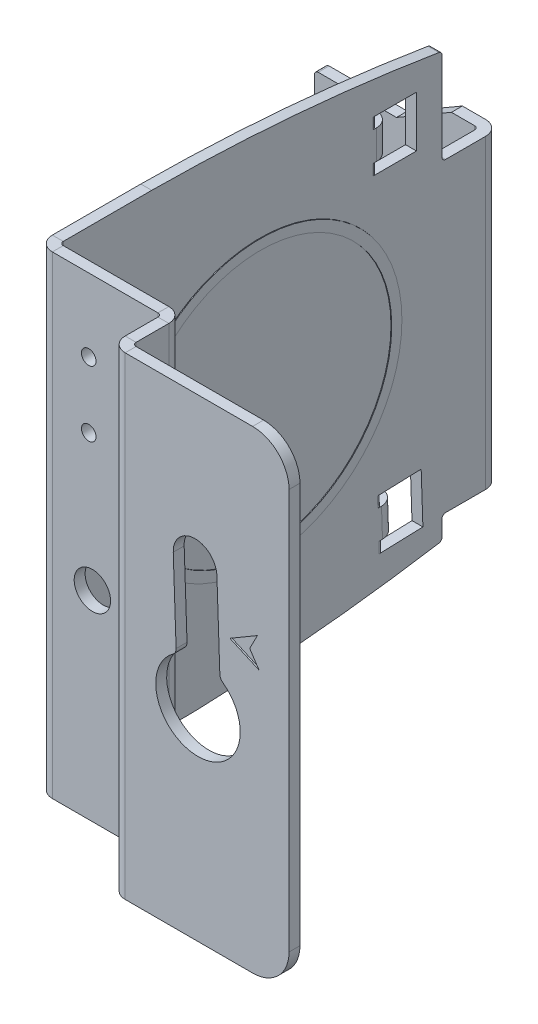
ISO-10303-21;
HEADER;
FILE_DESCRIPTION(('STEP AP214'),'2;1');
FILE_NAME('part.step','',(''),(''),'','','');
FILE_SCHEMA(('AUTOMOTIVE_DESIGN { 1 0 10303 214 1 1 1 1 }'));
ENDSEC;
DATA;
#1=APPLICATION_CONTEXT('core data for automotive mechanical design processes');
#2=APPLICATION_PROTOCOL_DEFINITION('international standard','automotive_design',2000,#1);
#3=PRODUCT_CONTEXT('',#1,'mechanical');
#4=PRODUCT('Part','Part','',(#3));
#5=PRODUCT_RELATED_PRODUCT_CATEGORY('part','',(#4));
#6=PRODUCT_DEFINITION_FORMATION('','',#4);
#7=PRODUCT_DEFINITION_CONTEXT('part definition',#1,'design');
#8=PRODUCT_DEFINITION('design','',#6,#7);
#9=PRODUCT_DEFINITION_SHAPE('','',#8);
#10=(LENGTH_UNIT() NAMED_UNIT(*) SI_UNIT(.MILLI.,.METRE.));
#11=(NAMED_UNIT(*) PLANE_ANGLE_UNIT() SI_UNIT($,.RADIAN.));
#12=(NAMED_UNIT(*) SI_UNIT($,.STERADIAN.) SOLID_ANGLE_UNIT());
#13=UNCERTAINTY_MEASURE_WITH_UNIT(LENGTH_MEASURE(1.E-05),#10,'distance_accuracy_value','');
#14=(GEOMETRIC_REPRESENTATION_CONTEXT(3) GLOBAL_UNCERTAINTY_ASSIGNED_CONTEXT((#13)) GLOBAL_UNIT_ASSIGNED_CONTEXT((#10,
#11,#12)) REPRESENTATION_CONTEXT('',''));
#15=CARTESIAN_POINT('',(0.,0.,0.));
#16=DIRECTION('',(0.,0.,1.));
#17=DIRECTION('',(1.,0.,0.));
#18=AXIS2_PLACEMENT_3D('',#15,#16,#17);
#19=CARTESIAN_POINT('',(-15.5,65.,-8.5));
#20=DIRECTION('',(-1.,0.,0.));
#21=DIRECTION('',(0.,0.,1.));
#22=AXIS2_PLACEMENT_3D('',#19,#20,#21);
#23=PLANE('',#22);
#24=CARTESIAN_POINT('',(-15.5000000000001,32.5,-35.9999999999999));
#25=DIRECTION('',(-1.,0.,0.));
#26=DIRECTION('',(0.,0.,1.));
#27=AXIS2_PLACEMENT_3D('',#24,#25,#26);
#28=CIRCLE('',#27,19.4);
#29=CARTESIAN_POINT('',(-15.5,32.5,-16.5999999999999));
#30=VERTEX_POINT('',#29);
#31=EDGE_CURVE('E1245',#30,#30,#28,.F.);
#32=ORIENTED_EDGE('',*,*,#31,.F.);
#33=EDGE_LOOP('',(#32));
#34=FACE_BOUND('',#33,.T.);
#35=DIRECTION('',(0.,1.,0.));
#36=VECTOR('',#35,1.);
#37=CARTESIAN_POINT('',(-15.5000000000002,65.,-51.5000000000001));
#38=LINE('',#37,#36);
#39=CARTESIAN_POINT('',(-15.5000000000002,51.5,-51.5000000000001));
#40=VERTEX_POINT('',#39);
#41=CARTESIAN_POINT('',(-15.5000000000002,53.,-51.5000000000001));
#42=VERTEX_POINT('',#41);
#43=EDGE_CURVE('E948',#40,#42,#38,.T.);
#44=ORIENTED_EDGE('',*,*,#43,.T.);
#45=DIRECTION('',(0.,0.,1.));
#46=VECTOR('',#45,1.);
#47=CARTESIAN_POINT('',(-15.5000000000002,53.,-52.0000000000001));
#48=LINE('',#47,#46);
#49=CARTESIAN_POINT('',(-15.5000000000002,53.,-52.0000000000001));
#50=VERTEX_POINT('',#49);
#51=EDGE_CURVE('E951',#42,#50,#48,.F.);
#52=ORIENTED_EDGE('',*,*,#51,.T.);
#53=DIRECTION('',(0.,-1.,0.));
#54=VECTOR('',#53,1.);
#55=CARTESIAN_POINT('',(-15.5000000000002,53.,-52.0000000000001));
#56=LINE('',#55,#54);
#57=CARTESIAN_POINT('',(-15.5000000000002,57.,-52.0000000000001));
#58=VERTEX_POINT('',#57);
#59=EDGE_CURVE('E912',#50,#58,#56,.F.);
#60=ORIENTED_EDGE('',*,*,#59,.T.);
#61=DIRECTION('',(0.,0.,1.));
#62=VECTOR('',#61,1.);
#63=CARTESIAN_POINT('',(-15.5000000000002,57.,-52.0000000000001));
#64=LINE('',#63,#62);
#65=CARTESIAN_POINT('',(-15.5000000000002,57.,-51.5000000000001));
#66=VERTEX_POINT('',#65);
#67=EDGE_CURVE('E908',#58,#66,#64,.T.);
#68=ORIENTED_EDGE('',*,*,#67,.T.);
#69=DIRECTION('',(0.,1.,0.));
#70=VECTOR('',#69,1.);
#71=CARTESIAN_POINT('',(-15.5000000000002,65.,-51.5000000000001));
#72=LINE('',#71,#70);
#73=CARTESIAN_POINT('',(-15.5000000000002,58.5,-51.5000000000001));
#74=VERTEX_POINT('',#73);
#75=EDGE_CURVE('E943',#66,#74,#72,.T.);
#76=ORIENTED_EDGE('',*,*,#75,.T.);
#77=DIRECTION('',(0.,0.,-1.));
#78=VECTOR('',#77,1.);
#79=CARTESIAN_POINT('',(-15.5,58.5,-8.5));
#80=LINE('',#79,#78);
#81=CARTESIAN_POINT('',(-15.5000000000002,58.5,-57.5000000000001));
#82=VERTEX_POINT('',#81);
#83=EDGE_CURVE('E892',#74,#82,#80,.T.);
#84=ORIENTED_EDGE('',*,*,#83,.T.);
#85=DIRECTION('',(0.,-1.,0.));
#86=VECTOR('',#85,1.);
#87=CARTESIAN_POINT('',(-15.5000000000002,65.,-57.5000000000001));
#88=LINE('',#87,#86);
#89=CARTESIAN_POINT('',(-15.5000000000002,51.5,-57.5000000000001));
#90=VERTEX_POINT('',#89);
#91=EDGE_CURVE('E895',#82,#90,#88,.T.);
#92=ORIENTED_EDGE('',*,*,#91,.T.);
#93=DIRECTION('',(0.,0.,1.));
#94=VECTOR('',#93,1.);
#95=CARTESIAN_POINT('',(-15.5,51.5,-8.5));
#96=LINE('',#95,#94);
#97=EDGE_CURVE('E898',#90,#40,#96,.T.);
#98=ORIENTED_EDGE('',*,*,#97,.T.);
#99=EDGE_LOOP('',(#44,#52,#60,#68,#76,#84,#92,#98));
#100=FACE_BOUND('',#99,.T.);
#101=DIRECTION('',(0.,0.999429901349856,0.033761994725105));
#102=VECTOR('',#101,1.);
#103=CARTESIAN_POINT('',(-15.5000000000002,66.4136867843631,-50.348263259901));
#104=LINE('',#103,#102);
#105=CARTESIAN_POINT('',(-15.5000000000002,11.6512410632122,-52.1982073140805));
#106=VERTEX_POINT('',#105);
#107=CARTESIAN_POINT('',(-15.5000000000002,13.1503859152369,-52.1475643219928));
#108=VERTEX_POINT('',#107);
#109=EDGE_CURVE('E1334',#106,#108,#104,.T.);
#110=ORIENTED_EDGE('',*,*,#109,.T.);
#111=DIRECTION('',(0.,0.0337619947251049,-0.999429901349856));
#112=VECTOR('',#111,1.);
#113=CARTESIAN_POINT('',(-15.5,11.7366991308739,-10.2993010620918));
#114=LINE('',#113,#112);
#115=CARTESIAN_POINT('',(-15.5000000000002,13.3529578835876,-58.1441437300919));
#116=VERTEX_POINT('',#115);
#117=EDGE_CURVE('E900',#108,#116,#114,.T.);
#118=ORIENTED_EDGE('',*,*,#117,.T.);
#119=DIRECTION('',(0.,-0.999429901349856,-0.033761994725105));
#120=VECTOR('',#119,1.);
#121=CARTESIAN_POINT('',(-15.5000000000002,66.6162587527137,-56.3448426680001));
#122=LINE('',#121,#120);
#123=CARTESIAN_POINT('',(-15.5000000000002,6.35694857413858,-58.3804776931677));
#124=VERTEX_POINT('',#123);
#125=EDGE_CURVE('E903',#116,#124,#122,.T.);
#126=ORIENTED_EDGE('',*,*,#125,.T.);
#127=DIRECTION('',(0.,-0.0337619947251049,0.999429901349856));
#128=VECTOR('',#127,1.);
#129=CARTESIAN_POINT('',(-15.5,4.74068982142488,-10.5356350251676));
#130=LINE('',#129,#128);
#131=CARTESIAN_POINT('',(-15.5000000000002,6.15437660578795,-52.3838982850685));
#132=VERTEX_POINT('',#131);
#133=EDGE_CURVE('E906',#124,#132,#130,.T.);
#134=ORIENTED_EDGE('',*,*,#133,.T.);
#135=DIRECTION('',(0.,0.999429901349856,0.033761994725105));
#136=VECTOR('',#135,1.);
#137=CARTESIAN_POINT('',(-15.5000000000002,66.4136867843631,-50.348263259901));
#138=LINE('',#137,#136);
#139=CARTESIAN_POINT('',(-15.5000000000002,7.65352145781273,-52.3332552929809));
#140=VERTEX_POINT('',#139);
#141=EDGE_CURVE('E1349',#132,#140,#138,.T.);
#142=ORIENTED_EDGE('',*,*,#141,.T.);
#143=DIRECTION('',(0.,-0.0337619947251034,0.999429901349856));
#144=VECTOR('',#143,1.);
#145=CARTESIAN_POINT('',(-15.5000000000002,7.67040245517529,-52.8329702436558));
#146=LINE('',#145,#144);
#147=CARTESIAN_POINT('',(-15.5000000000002,7.67040245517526,-52.8329702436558));
#148=VERTEX_POINT('',#147);
#149=EDGE_CURVE('E1346',#140,#148,#146,.F.);
#150=ORIENTED_EDGE('',*,*,#149,.T.);
#151=DIRECTION('',(0.,-0.999429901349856,-0.0337619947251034));
#152=VECTOR('',#151,1.);
#153=CARTESIAN_POINT('',(-15.5000000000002,7.67040245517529,-52.8329702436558));
#154=LINE('',#153,#152);
#155=CARTESIAN_POINT('',(-15.5000000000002,11.6681220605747,-52.6979222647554));
#156=VERTEX_POINT('',#155);
#157=EDGE_CURVE('E1362',#148,#156,#154,.F.);
#158=ORIENTED_EDGE('',*,*,#157,.T.);
#159=DIRECTION('',(0.,-0.0337619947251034,0.999429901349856));
#160=VECTOR('',#159,1.);
#161=CARTESIAN_POINT('',(-15.5000000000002,11.6681220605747,-52.6979222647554));
#162=LINE('',#161,#160);
#163=EDGE_CURVE('E1342',#156,#106,#162,.T.);
#164=ORIENTED_EDGE('',*,*,#163,.T.);
#165=EDGE_LOOP('',(#110,#118,#126,#134,#142,#150,#158,#164));
#166=FACE_BOUND('',#165,.T.);
#167=CARTESIAN_POINT('',(-15.5000000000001,253.745137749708,-19.5708495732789));
#168=DIRECTION('',(-1.,0.,0.));
#169=DIRECTION('',(0.,0.,1.));
#170=AXIS2_PLACEMENT_3D('',#167,#168,#169);
#171=CIRCLE('',#170,253.75);
#172=CARTESIAN_POINT('',(-15.5000000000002,3.33098913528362,-60.5808077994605));
#173=VERTEX_POINT('',#172);
#174=CARTESIAN_POINT('',(-15.5,0.,-21.1416991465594));
#175=VERTEX_POINT('',#174);
#176=EDGE_CURVE('E674',#173,#175,#171,.T.);
#177=ORIENTED_EDGE('',*,*,#176,.F.);
#178=CARTESIAN_POINT('',(-15.5000000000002,3.82441602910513,-60.5));
#179=DIRECTION('',(-1.,0.,0.));
#180=DIRECTION('',(0.,0.,1.));
#181=AXIS2_PLACEMENT_3D('',#178,#179,#180);
#182=CIRCLE('',#181,0.5);
#183=CARTESIAN_POINT('',(-15.5000000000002,3.82441602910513,-61.));
#184=VERTEX_POINT('',#183);
#185=EDGE_CURVE('E15',#173,#184,#182,.F.);
#186=ORIENTED_EDGE('',*,*,#185,.T.);
#187=DIRECTION('',(0.,1.,0.));
#188=VECTOR('',#187,1.);
#189=CARTESIAN_POINT('',(-15.5000000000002,65.,-61.));
#190=LINE('',#189,#188);
#191=CARTESIAN_POINT('',(-15.5000000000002,6.,-61.));
#192=VERTEX_POINT('',#191);
#193=EDGE_CURVE('E821',#184,#192,#190,.T.);
#194=ORIENTED_EDGE('',*,*,#193,.T.);
#195=CARTESIAN_POINT('',(-15.5000000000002,6.,-61.5));
#196=DIRECTION('',(-1.,0.,0.));
#197=DIRECTION('',(0.,0.,1.));
#198=AXIS2_PLACEMENT_3D('',#195,#196,#197);
#199=CIRCLE('',#198,0.5);
#200=CARTESIAN_POINT('',(-15.5000000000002,6.5,-61.5));
#201=VERTEX_POINT('',#200);
#202=EDGE_CURVE('E890',#192,#201,#199,.T.);
#203=ORIENTED_EDGE('',*,*,#202,.T.);
#204=DIRECTION('',(0.,0.,-1.));
#205=VECTOR('',#204,1.);
#206=CARTESIAN_POINT('',(-15.5,6.5,-8.5));
#207=LINE('',#206,#205);
#208=CARTESIAN_POINT('',(-15.5000000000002,6.5,-67.));
#209=VERTEX_POINT('',#208);
#210=EDGE_CURVE('E828',#201,#209,#207,.T.);
#211=ORIENTED_EDGE('',*,*,#210,.T.);
#212=DIRECTION('',(0.,-1.,0.));
#213=VECTOR('',#212,1.);
#214=CARTESIAN_POINT('',(-15.5000000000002,0.,-67.));
#215=LINE('',#214,#213);
#216=CARTESIAN_POINT('',(-15.5000000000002,48.5,-67.));
#217=VERTEX_POINT('',#216);
#218=EDGE_CURVE('E701',#209,#217,#215,.F.);
#219=ORIENTED_EDGE('',*,*,#218,.T.);
#220=DIRECTION('',(0.,0.,-1.));
#221=VECTOR('',#220,1.);
#222=CARTESIAN_POINT('',(-15.5,48.5,-8.5));
#223=LINE('',#222,#221);
#224=CARTESIAN_POINT('',(-15.5000000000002,48.5,-61.5));
#225=VERTEX_POINT('',#224);
#226=EDGE_CURVE('E832',#225,#217,#223,.T.);
#227=ORIENTED_EDGE('',*,*,#226,.F.);
#228=CARTESIAN_POINT('',(-15.5000000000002,49.,-61.5));
#229=DIRECTION('',(-1.,0.,0.));
#230=DIRECTION('',(0.,0.,1.));
#231=AXIS2_PLACEMENT_3D('',#228,#229,#230);
#232=CIRCLE('',#231,0.5);
#233=CARTESIAN_POINT('',(-15.5000000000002,49.,-61.));
#234=VERTEX_POINT('',#233);
#235=EDGE_CURVE('E860',#225,#234,#232,.T.);
#236=ORIENTED_EDGE('',*,*,#235,.T.);
#237=DIRECTION('',(0.,-1.,0.));
#238=VECTOR('',#237,1.);
#239=CARTESIAN_POINT('',(-15.5000000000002,65.,-61.));
#240=LINE('',#239,#238);
#241=CARTESIAN_POINT('',(-15.5000000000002,61.175584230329,-61.));
#242=VERTEX_POINT('',#241);
#243=EDGE_CURVE('E1115',#242,#234,#240,.T.);
#244=ORIENTED_EDGE('',*,*,#243,.F.);
#245=CARTESIAN_POINT('',(-15.5000000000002,61.175584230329,-60.5));
#246=DIRECTION('',(-1.,0.,0.));
#247=DIRECTION('',(0.,0.,1.));
#248=AXIS2_PLACEMENT_3D('',#245,#246,#247);
#249=CIRCLE('',#248,0.5);
#250=CARTESIAN_POINT('',(-15.5000000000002,61.6690110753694,-60.5808080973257));
#251=VERTEX_POINT('',#250);
#252=EDGE_CURVE('E1233',#242,#251,#249,.F.);
#253=ORIENTED_EDGE('',*,*,#252,.T.);
#254=CARTESIAN_POINT('',(-15.5000000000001,-188.745112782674,-19.5706987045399));
#255=DIRECTION('',(-1.,0.,0.));
#256=DIRECTION('',(0.,0.,1.));
#257=AXIS2_PLACEMENT_3D('',#254,#255,#256);
#258=CIRCLE('',#257,253.75);
#259=CARTESIAN_POINT('',(-15.5,65.,-21.1455761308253));
#260=VERTEX_POINT('',#259);
#261=EDGE_CURVE('E1524',#251,#260,#258,.F.);
#262=ORIENTED_EDGE('',*,*,#261,.T.);
#263=DIRECTION('',(0.,0.,-1.));
#264=VECTOR('',#263,1.);
#265=CARTESIAN_POINT('',(-15.5,65.,-8.5));
#266=LINE('',#265,#264);
#267=CARTESIAN_POINT('',(-15.5,65.,-9.));
#268=VERTEX_POINT('',#267);
#269=EDGE_CURVE('E683',#260,#268,#266,.F.);
#270=ORIENTED_EDGE('',*,*,#269,.T.);
#271=DIRECTION('',(0.,-1.,0.));
#272=VECTOR('',#271,1.);
#273=CARTESIAN_POINT('',(-15.5,0.,-9.));
#274=LINE('',#273,#272);
#275=CARTESIAN_POINT('',(-15.5,0.,-9.));
#276=VERTEX_POINT('',#275);
#277=EDGE_CURVE('E697',#276,#268,#274,.F.);
#278=ORIENTED_EDGE('',*,*,#277,.F.);
#279=DIRECTION('',(0.,0.,1.));
#280=VECTOR('',#279,1.);
#281=CARTESIAN_POINT('',(-15.5,0.,-8.5));
#282=LINE('',#281,#280);
#283=EDGE_CURVE('E687',#276,#175,#282,.F.);
#284=ORIENTED_EDGE('',*,*,#283,.T.);
#285=EDGE_LOOP('',(#177,#186,#194,#203,#211,#219,#227,#236,#244,#253,#262,#270,#278,#284));
#286=FACE_BOUND('',#285,.T.);
#287=ADVANCED_FACE('F170',(#34,#100,#166,#286),#23,.F.);
#288=CARTESIAN_POINT('',(-17.,65.,-8.49999999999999));
#289=DIRECTION('',(-1.,0.,0.));
#290=DIRECTION('',(0.,0.,1.));
#291=AXIS2_PLACEMENT_3D('',#288,#289,#290);
#292=PLANE('',#291);
#293=CARTESIAN_POINT('',(-17.0000000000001,32.5,-35.9999999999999));
#294=DIRECTION('',(-1.,0.,0.));
#295=DIRECTION('',(0.,0.,1.));
#296=AXIS2_PLACEMENT_3D('',#293,#294,#295);
#297=CIRCLE('',#296,19.4);
#298=CARTESIAN_POINT('',(-17.,32.5,-16.5999999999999));
#299=VERTEX_POINT('',#298);
#300=EDGE_CURVE('E1020',#299,#299,#297,.T.);
#301=ORIENTED_EDGE('',*,*,#300,.F.);
#302=EDGE_LOOP('',(#301));
#303=FACE_BOUND('',#302,.T.);
#304=DIRECTION('',(0.,-1.,0.));
#305=VECTOR('',#304,1.);
#306=CARTESIAN_POINT('',(-17.0000000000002,53.,-52.0000000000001));
#307=LINE('',#306,#305);
#308=CARTESIAN_POINT('',(-17.0000000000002,53.,-52.0000000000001));
#309=VERTEX_POINT('',#308);
#310=CARTESIAN_POINT('',(-17.0000000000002,57.,-52.0000000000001));
#311=VERTEX_POINT('',#310);
#312=EDGE_CURVE('E924',#309,#311,#307,.F.);
#313=ORIENTED_EDGE('',*,*,#312,.F.);
#314=DIRECTION('',(0.,0.,-1.));
#315=VECTOR('',#314,1.);
#316=CARTESIAN_POINT('',(-17.,53.,-8.49999999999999));
#317=LINE('',#316,#315);
#318=CARTESIAN_POINT('',(-17.0000000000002,53.,-51.5000000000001));
#319=VERTEX_POINT('',#318);
#320=EDGE_CURVE('E1398',#309,#319,#317,.F.);
#321=ORIENTED_EDGE('',*,*,#320,.T.);
#322=DIRECTION('',(0.,1.,0.));
#323=VECTOR('',#322,1.);
#324=CARTESIAN_POINT('',(-17.0000000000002,51.5,-51.5000000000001));
#325=LINE('',#324,#323);
#326=CARTESIAN_POINT('',(-17.0000000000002,51.5,-51.5000000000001));
#327=VERTEX_POINT('',#326);
#328=EDGE_CURVE('E1404',#319,#327,#325,.F.);
#329=ORIENTED_EDGE('',*,*,#328,.T.);
#330=DIRECTION('',(0.,0.,1.));
#331=VECTOR('',#330,1.);
#332=CARTESIAN_POINT('',(-17.0000000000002,51.5,-52.0000000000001));
#333=LINE('',#332,#331);
#334=CARTESIAN_POINT('',(-17.0000000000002,51.5,-57.5000000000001));
#335=VERTEX_POINT('',#334);
#336=EDGE_CURVE('E1004',#335,#327,#333,.T.);
#337=ORIENTED_EDGE('',*,*,#336,.F.);
#338=DIRECTION('',(0.,-1.,0.));
#339=VECTOR('',#338,1.);
#340=CARTESIAN_POINT('',(-17.0000000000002,58.5,-57.5000000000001));
#341=LINE('',#340,#339);
#342=CARTESIAN_POINT('',(-17.0000000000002,58.5,-57.5000000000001));
#343=VERTEX_POINT('',#342);
#344=EDGE_CURVE('E1001',#343,#335,#341,.T.);
#345=ORIENTED_EDGE('',*,*,#344,.F.);
#346=DIRECTION('',(0.,0.,-1.));
#347=VECTOR('',#346,1.);
#348=CARTESIAN_POINT('',(-17.0000000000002,58.5,-52.0000000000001));
#349=LINE('',#348,#347);
#350=CARTESIAN_POINT('',(-17.0000000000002,58.5,-51.5000000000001));
#351=VERTEX_POINT('',#350);
#352=EDGE_CURVE('E991',#351,#343,#349,.T.);
#353=ORIENTED_EDGE('',*,*,#352,.F.);
#354=DIRECTION('',(0.,1.,0.));
#355=VECTOR('',#354,1.);
#356=CARTESIAN_POINT('',(-17.0000000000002,57.,-51.5000000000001));
#357=LINE('',#356,#355);
#358=CARTESIAN_POINT('',(-17.0000000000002,57.,-51.5000000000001));
#359=VERTEX_POINT('',#358);
#360=EDGE_CURVE('E1407',#351,#359,#357,.F.);
#361=ORIENTED_EDGE('',*,*,#360,.T.);
#362=DIRECTION('',(0.,0.,-1.));
#363=VECTOR('',#362,1.);
#364=CARTESIAN_POINT('',(-17.,57.,-8.49999999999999));
#365=LINE('',#364,#363);
#366=EDGE_CURVE('E1410',#359,#311,#365,.T.);
#367=ORIENTED_EDGE('',*,*,#366,.T.);
#368=EDGE_LOOP('',(#313,#321,#329,#337,#345,#353,#361,#367));
#369=FACE_BOUND('',#368,.T.);
#370=DIRECTION('',(0.,-0.999429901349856,-0.0337619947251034));
#371=VECTOR('',#370,1.);
#372=CARTESIAN_POINT('',(-17.0000000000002,7.67040245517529,-52.8329702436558));
#373=LINE('',#372,#371);
#374=CARTESIAN_POINT('',(-17.0000000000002,7.67040245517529,-52.8329702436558));
#375=VERTEX_POINT('',#374);
#376=CARTESIAN_POINT('',(-17.0000000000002,11.6681220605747,-52.6979222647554));
#377=VERTEX_POINT('',#376);
#378=EDGE_CURVE('E1369',#375,#377,#373,.F.);
#379=ORIENTED_EDGE('',*,*,#378,.F.);
#380=DIRECTION('',(0.,0.0337619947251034,-0.999429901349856));
#381=VECTOR('',#380,1.);
#382=CARTESIAN_POINT('',(-17.,6.23983467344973,-10.4849920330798));
#383=LINE('',#382,#381);
#384=CARTESIAN_POINT('',(-17.0000000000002,7.65352145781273,-52.3332552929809));
#385=VERTEX_POINT('',#384);
#386=EDGE_CURVE('E1266',#375,#385,#383,.F.);
#387=ORIENTED_EDGE('',*,*,#386,.T.);
#388=DIRECTION('',(0.,0.999429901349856,0.033761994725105));
#389=VECTOR('',#388,1.);
#390=CARTESIAN_POINT('',(-17.0000000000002,6.15437660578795,-52.3838982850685));
#391=LINE('',#390,#389);
#392=CARTESIAN_POINT('',(-17.0000000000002,6.15437660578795,-52.3838982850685));
#393=VERTEX_POINT('',#392);
#394=EDGE_CURVE('E1271',#385,#393,#391,.F.);
#395=ORIENTED_EDGE('',*,*,#394,.T.);
#396=DIRECTION('',(0.,-0.0337619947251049,0.999429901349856));
#397=VECTOR('',#396,1.);
#398=CARTESIAN_POINT('',(-17.0000000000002,6.1712576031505,-52.8836132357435));
#399=LINE('',#398,#397);
#400=CARTESIAN_POINT('',(-17.0000000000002,6.35694857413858,-58.3804776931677));
#401=VERTEX_POINT('',#400);
#402=EDGE_CURVE('E980',#401,#393,#399,.T.);
#403=ORIENTED_EDGE('',*,*,#402,.F.);
#404=DIRECTION('',(0.,-0.999429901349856,-0.033761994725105));
#405=VECTOR('',#404,1.);
#406=CARTESIAN_POINT('',(-17.0000000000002,6.35694857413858,-58.3804776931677));
#407=LINE('',#406,#405);
#408=CARTESIAN_POINT('',(-17.0000000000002,13.3529578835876,-58.1441437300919));
#409=VERTEX_POINT('',#408);
#410=EDGE_CURVE('E985',#409,#401,#407,.T.);
#411=ORIENTED_EDGE('',*,*,#410,.F.);
#412=DIRECTION('',(0.,0.0337619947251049,-0.999429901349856));
#413=VECTOR('',#412,1.);
#414=CARTESIAN_POINT('',(-17.0000000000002,13.1672669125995,-52.6472792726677));
#415=LINE('',#414,#413);
#416=CARTESIAN_POINT('',(-17.0000000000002,13.1503859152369,-52.1475643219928));
#417=VERTEX_POINT('',#416);
#418=EDGE_CURVE('E982',#417,#409,#415,.T.);
#419=ORIENTED_EDGE('',*,*,#418,.F.);
#420=DIRECTION('',(0.,0.999429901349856,0.033761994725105));
#421=VECTOR('',#420,1.);
#422=CARTESIAN_POINT('',(-17.0000000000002,11.6512410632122,-52.1982073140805));
#423=LINE('',#422,#421);
#424=CARTESIAN_POINT('',(-17.0000000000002,11.6512410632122,-52.1982073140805));
#425=VERTEX_POINT('',#424);
#426=EDGE_CURVE('E1274',#417,#425,#423,.F.);
#427=ORIENTED_EDGE('',*,*,#426,.T.);
#428=DIRECTION('',(0.,0.0337619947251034,-0.999429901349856));
#429=VECTOR('',#428,1.);
#430=CARTESIAN_POINT('',(-17.,10.2375542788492,-10.3499440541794));
#431=LINE('',#430,#429);
#432=EDGE_CURVE('E1277',#425,#377,#431,.T.);
#433=ORIENTED_EDGE('',*,*,#432,.T.);
#434=EDGE_LOOP('',(#379,#387,#395,#403,#411,#419,#427,#433));
#435=FACE_BOUND('',#434,.T.);
#436=DIRECTION('',(0.,1.,0.));
#437=VECTOR('',#436,1.);
#438=CARTESIAN_POINT('',(-17.0000000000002,0.,-61.));
#439=LINE('',#438,#437);
#440=CARTESIAN_POINT('',(-17.0000000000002,3.82441602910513,-61.));
#441=VERTEX_POINT('',#440);
#442=CARTESIAN_POINT('',(-17.0000000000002,6.,-61.));
#443=VERTEX_POINT('',#442);
#444=EDGE_CURVE('E1166',#441,#443,#439,.T.);
#445=ORIENTED_EDGE('',*,*,#444,.F.);
#446=CARTESIAN_POINT('',(-17.0000000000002,3.82441602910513,-60.5));
#447=DIRECTION('',(-1.,0.,0.));
#448=DIRECTION('',(0.,0.,1.));
#449=AXIS2_PLACEMENT_3D('',#446,#447,#448);
#450=CIRCLE('',#449,0.5);
#451=CARTESIAN_POINT('',(-17.0000000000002,3.33098913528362,-60.5808077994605));
#452=VERTEX_POINT('',#451);
#453=EDGE_CURVE('E192',#441,#452,#450,.T.);
#454=ORIENTED_EDGE('',*,*,#453,.T.);
#455=CARTESIAN_POINT('',(-17.0000000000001,253.745137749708,-19.5708495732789));
#456=DIRECTION('',(-1.,0.,0.));
#457=DIRECTION('',(0.,0.,1.));
#458=AXIS2_PLACEMENT_3D('',#455,#456,#457);
#459=CIRCLE('',#458,253.75);
#460=CARTESIAN_POINT('',(-17.0000000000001,0.,-21.1416991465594));
#461=VERTEX_POINT('',#460);
#462=EDGE_CURVE('E663',#452,#461,#459,.T.);
#463=ORIENTED_EDGE('',*,*,#462,.T.);
#464=DIRECTION('',(0.,0.,-1.));
#465=VECTOR('',#464,1.);
#466=CARTESIAN_POINT('',(-17.0000000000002,0.,-69.));
#467=LINE('',#466,#465);
#468=CARTESIAN_POINT('',(-17.,0.,-8.99999999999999));
#469=VERTEX_POINT('',#468);
#470=EDGE_CURVE('E668',#469,#461,#467,.T.);
#471=ORIENTED_EDGE('',*,*,#470,.F.);
#472=DIRECTION('',(0.,1.,0.));
#473=VECTOR('',#472,1.);
#474=CARTESIAN_POINT('',(-17.,65.,-8.99999999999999));
#475=LINE('',#474,#473);
#476=CARTESIAN_POINT('',(-17.,65.,-8.99999999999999));
#477=VERTEX_POINT('',#476);
#478=EDGE_CURVE('E692',#469,#477,#475,.T.);
#479=ORIENTED_EDGE('',*,*,#478,.T.);
#480=DIRECTION('',(0.,0.,1.));
#481=VECTOR('',#480,1.);
#482=CARTESIAN_POINT('',(-17.,65.,-8.49999999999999));
#483=LINE('',#482,#481);
#484=CARTESIAN_POINT('',(-17.0000000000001,65.,-21.1455761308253));
#485=VERTEX_POINT('',#484);
#486=EDGE_CURVE('E682',#485,#477,#483,.T.);
#487=ORIENTED_EDGE('',*,*,#486,.F.);
#488=CARTESIAN_POINT('',(-17.0000000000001,-188.745112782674,-19.5706987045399));
#489=DIRECTION('',(-1.,0.,0.));
#490=DIRECTION('',(0.,0.,1.));
#491=AXIS2_PLACEMENT_3D('',#488,#489,#490);
#492=CIRCLE('',#491,253.75);
#493=CARTESIAN_POINT('',(-17.0000000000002,61.6690110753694,-60.5808080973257));
#494=VERTEX_POINT('',#493);
#495=EDGE_CURVE('E2699',#494,#485,#492,.F.);
#496=ORIENTED_EDGE('',*,*,#495,.F.);
#497=CARTESIAN_POINT('',(-17.0000000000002,61.175584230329,-60.5));
#498=DIRECTION('',(-1.,0.,0.));
#499=DIRECTION('',(0.,0.,1.));
#500=AXIS2_PLACEMENT_3D('',#497,#498,#499);
#501=CIRCLE('',#500,0.5);
#502=CARTESIAN_POINT('',(-17.0000000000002,61.175584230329,-61.));
#503=VERTEX_POINT('',#502);
#504=EDGE_CURVE('E1240',#494,#503,#501,.T.);
#505=ORIENTED_EDGE('',*,*,#504,.T.);
#506=DIRECTION('',(0.,-1.,0.));
#507=VECTOR('',#506,1.);
#508=CARTESIAN_POINT('',(-17.0000000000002,-41.8402399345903,-61.));
#509=LINE('',#508,#507);
#510=CARTESIAN_POINT('',(-17.0000000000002,49.,-61.));
#511=VERTEX_POINT('',#510);
#512=EDGE_CURVE('E1113',#503,#511,#509,.T.);
#513=ORIENTED_EDGE('',*,*,#512,.T.);
#514=CARTESIAN_POINT('',(-17.0000000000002,49.,-61.5));
#515=DIRECTION('',(-1.,0.,0.));
#516=DIRECTION('',(0.,0.,1.));
#517=AXIS2_PLACEMENT_3D('',#514,#515,#516);
#518=CIRCLE('',#517,0.5);
#519=CARTESIAN_POINT('',(-17.0000000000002,48.5,-61.5));
#520=VERTEX_POINT('',#519);
#521=EDGE_CURVE('E858',#511,#520,#518,.F.);
#522=ORIENTED_EDGE('',*,*,#521,.T.);
#523=DIRECTION('',(0.,0.,-1.));
#524=VECTOR('',#523,1.);
#525=CARTESIAN_POINT('',(-17.0000000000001,48.5,-43.2919043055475));
#526=LINE('',#525,#524);
#527=CARTESIAN_POINT('',(-17.0000000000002,48.5,-67.));
#528=VERTEX_POINT('',#527);
#529=EDGE_CURVE('E1111',#520,#528,#526,.T.);
#530=ORIENTED_EDGE('',*,*,#529,.T.);
#531=DIRECTION('',(0.,-1.,0.));
#532=VECTOR('',#531,1.);
#533=CARTESIAN_POINT('',(-17.0000000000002,0.,-67.));
#534=LINE('',#533,#532);
#535=CARTESIAN_POINT('',(-17.0000000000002,6.5,-67.));
#536=VERTEX_POINT('',#535);
#537=EDGE_CURVE('E1184',#536,#528,#534,.F.);
#538=ORIENTED_EDGE('',*,*,#537,.F.);
#539=DIRECTION('',(0.,0.,-1.));
#540=VECTOR('',#539,1.);
#541=CARTESIAN_POINT('',(-17.0000000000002,6.5,-61.));
#542=LINE('',#541,#540);
#543=CARTESIAN_POINT('',(-17.0000000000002,6.5,-61.5));
#544=VERTEX_POINT('',#543);
#545=EDGE_CURVE('E1168',#544,#536,#542,.T.);
#546=ORIENTED_EDGE('',*,*,#545,.F.);
#547=CARTESIAN_POINT('',(-17.0000000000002,6.,-61.5));
#548=DIRECTION('',(-1.,0.,0.));
#549=DIRECTION('',(0.,0.,1.));
#550=AXIS2_PLACEMENT_3D('',#547,#548,#549);
#551=CIRCLE('',#550,0.5);
#552=EDGE_CURVE('E887',#544,#443,#551,.F.);
#553=ORIENTED_EDGE('',*,*,#552,.T.);
#554=EDGE_LOOP('',(#445,#454,#463,#471,#479,#487,#496,#505,#513,#522,#530,#538,#546,#553));
#555=FACE_BOUND('',#554,.T.);
#556=ADVANCED_FACE('F665',(#303,#369,#435,#555),#292,.T.);
#557=CARTESIAN_POINT('',(-17.0000000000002,0.,-69.));
#558=DIRECTION('',(0.,-1.,0.));
#559=DIRECTION('',(0.,0.,-1.));
#560=AXIS2_PLACEMENT_3D('',#557,#558,#559);
#561=PLANE('',#560);
#562=ORIENTED_EDGE('',*,*,#470,.T.);
#563=DIRECTION('',(-1.,0.,0.));
#564=VECTOR('',#563,1.);
#565=CARTESIAN_POINT('',(-7.00000000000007,0.,-21.1416991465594));
#566=LINE('',#565,#564);
#567=EDGE_CURVE('E669',#175,#461,#566,.T.);
#568=ORIENTED_EDGE('',*,*,#567,.F.);
#569=ORIENTED_EDGE('',*,*,#283,.F.);
#570=DIRECTION('',(-1.,0.,0.));
#571=VECTOR('',#570,1.);
#572=CARTESIAN_POINT('',(-17.,0.,-8.99999999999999));
#573=LINE('',#572,#571);
#574=EDGE_CURVE('E681',#276,#469,#573,.T.);
#575=ORIENTED_EDGE('',*,*,#574,.T.);
#576=EDGE_LOOP('',(#562,#568,#569,#575));
#577=FACE_BOUND('',#576,.T.);
#578=ADVANCED_FACE('F680',(#577),#561,.T.);
#579=CARTESIAN_POINT('',(32.9999999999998,0.,-61.0000000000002));
#580=DIRECTION('',(0.,0.,1.));
#581=DIRECTION('',(1.,0.,0.));
#582=AXIS2_PLACEMENT_3D('',#579,#580,#581);
#583=PLANE('',#582);
#584=ORIENTED_EDGE('',*,*,#193,.F.);
#585=DIRECTION('',(1.,0.,0.));
#586=VECTOR('',#585,1.);
#587=CARTESIAN_POINT('',(-17.0000000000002,3.82441602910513,-61.));
#588=LINE('',#587,#586);
#589=EDGE_CURVE('E1230',#184,#441,#588,.F.);
#590=ORIENTED_EDGE('',*,*,#589,.T.);
#591=ORIENTED_EDGE('',*,*,#444,.T.);
#592=DIRECTION('',(-1.,0.,0.));
#593=VECTOR('',#592,1.);
#594=CARTESIAN_POINT('',(32.9999999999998,6.,-61.0000000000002));
#595=LINE('',#594,#593);
#596=EDGE_CURVE('E884',#443,#192,#595,.F.);
#597=ORIENTED_EDGE('',*,*,#596,.T.);
#598=EDGE_LOOP('',(#584,#590,#591,#597));
#599=FACE_BOUND('',#598,.T.);
#600=ADVANCED_FACE('F1228',(#599),#583,.F.);
#601=CARTESIAN_POINT('',(-13.0000000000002,6.1712576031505,-52.8836132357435));
#602=DIRECTION('',(0.,-0.033761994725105,0.999429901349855));
#603=DIRECTION('',(0.,-0.999429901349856,-0.033761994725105));
#604=AXIS2_PLACEMENT_3D('',#601,#602,#603);
#605=PLANE('',#604);
#606=DIRECTION('',(-1.,0.,0.));
#607=VECTOR('',#606,1.);
#608=CARTESIAN_POINT('',(-13.0000000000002,13.1672669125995,-52.6472792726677));
#609=LINE('',#608,#607);
#610=CARTESIAN_POINT('',(-16.0000000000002,13.1672669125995,-52.6472792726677));
#611=VERTEX_POINT('',#610);
#612=CARTESIAN_POINT('',(-16.5000000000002,13.1672669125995,-52.6472792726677));
#613=VERTEX_POINT('',#612);
#614=EDGE_CURVE('E994',#611,#613,#609,.T.);
#615=ORIENTED_EDGE('',*,*,#614,.F.);
#616=DIRECTION('',(0.,0.999429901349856,0.033761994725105));
#617=VECTOR('',#616,1.);
#618=CARTESIAN_POINT('',(-16.0000000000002,6.1712576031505,-52.8836132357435));
#619=LINE('',#618,#617);
#620=CARTESIAN_POINT('',(-16.0000000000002,11.6681220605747,-52.6979222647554));
#621=VERTEX_POINT('',#620);
#622=EDGE_CURVE('E1286',#611,#621,#619,.F.);
#623=ORIENTED_EDGE('',*,*,#622,.T.);
#624=DIRECTION('',(1.,0.,0.));
#625=VECTOR('',#624,1.);
#626=CARTESIAN_POINT('',(-17.0000000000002,11.6681220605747,-52.6979222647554));
#627=LINE('',#626,#625);
#628=CARTESIAN_POINT('',(-16.5000000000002,11.6681220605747,-52.6979222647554));
#629=VERTEX_POINT('',#628);
#630=EDGE_CURVE('E1291',#629,#621,#627,.T.);
#631=ORIENTED_EDGE('',*,*,#630,.F.);
#632=DIRECTION('',(0.,0.999429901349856,0.033761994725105));
#633=VECTOR('',#632,1.);
#634=CARTESIAN_POINT('',(-16.5000000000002,13.1672669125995,-52.6472792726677));
#635=LINE('',#634,#633);
#636=EDGE_CURVE('E1336',#629,#613,#635,.T.);
#637=ORIENTED_EDGE('',*,*,#636,.T.);
#638=EDGE_LOOP('',(#615,#623,#631,#637));
#639=FACE_BOUND('',#638,.T.);
#640=ADVANCED_FACE('F1641',(#639),#605,.F.);
#641=CARTESIAN_POINT('',(-13.0000000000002,58.5,-52.0000000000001));
#642=DIRECTION('',(0.,0.,1.));
#643=DIRECTION('',(1.,0.,0.));
#644=AXIS2_PLACEMENT_3D('',#641,#642,#643);
#645=PLANE('',#644);
#646=DIRECTION('',(1.,0.,0.));
#647=VECTOR('',#646,1.);
#648=CARTESIAN_POINT('',(-17.0000000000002,57.,-52.0000000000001));
#649=LINE('',#648,#647);
#650=CARTESIAN_POINT('',(-16.5000000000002,57.,-52.0000000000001));
#651=VERTEX_POINT('',#650);
#652=CARTESIAN_POINT('',(-16.0000000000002,57.,-52.0000000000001));
#653=VERTEX_POINT('',#652);
#654=EDGE_CURVE('E973',#651,#653,#649,.T.);
#655=ORIENTED_EDGE('',*,*,#654,.F.);
#656=DIRECTION('',(0.,1.,0.));
#657=VECTOR('',#656,1.);
#658=CARTESIAN_POINT('',(-16.5000000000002,58.5,-52.0000000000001));
#659=LINE('',#658,#657);
#660=CARTESIAN_POINT('',(-16.5000000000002,58.5,-52.0000000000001));
#661=VERTEX_POINT('',#660);
#662=EDGE_CURVE('E1395',#651,#661,#659,.T.);
#663=ORIENTED_EDGE('',*,*,#662,.T.);
#664=DIRECTION('',(-1.,0.,0.));
#665=VECTOR('',#664,1.);
#666=CARTESIAN_POINT('',(-13.0000000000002,58.5,-52.0000000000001));
#667=LINE('',#666,#665);
#668=CARTESIAN_POINT('',(-16.0000000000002,58.5,-52.0000000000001));
#669=VERTEX_POINT('',#668);
#670=EDGE_CURVE('E1006',#669,#661,#667,.T.);
#671=ORIENTED_EDGE('',*,*,#670,.F.);
#672=DIRECTION('',(0.,1.,0.));
#673=VECTOR('',#672,1.);
#674=CARTESIAN_POINT('',(-16.0000000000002,58.5,-52.0000000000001));
#675=LINE('',#674,#673);
#676=EDGE_CURVE('E957',#669,#653,#675,.F.);
#677=ORIENTED_EDGE('',*,*,#676,.T.);
#678=EDGE_LOOP('',(#655,#663,#671,#677));
#679=FACE_BOUND('',#678,.T.);
#680=ADVANCED_FACE('F1481',(#679),#645,.F.);
#681=CARTESIAN_POINT('',(-17.5000000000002,0.,-67.));
#682=DIRECTION('',(0.,-1.,0.));
#683=DIRECTION('',(0.,0.,-1.));
#684=AXIS2_PLACEMENT_3D('',#681,#682,#683);
#685=CYLINDRICAL_SURFACE('',#684,2.);
#686=DIRECTION('',(0.,-1.,0.));
#687=VECTOR('',#686,1.);
#688=CARTESIAN_POINT('',(-17.5000000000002,65.,-69.));
#689=LINE('',#688,#687);
#690=CARTESIAN_POINT('',(-17.5000000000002,6.5,-69.));
#691=VERTEX_POINT('',#690);
#692=CARTESIAN_POINT('',(-17.5000000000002,48.5,-69.));
#693=VERTEX_POINT('',#692);
#694=EDGE_CURVE('E1188',#691,#693,#689,.F.);
#695=ORIENTED_EDGE('',*,*,#694,.T.);
#696=CARTESIAN_POINT('',(-17.5000000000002,48.5,-67.));
#697=DIRECTION('',(0.,1.,0.));
#698=DIRECTION('',(0.,0.,1.));
#699=AXIS2_PLACEMENT_3D('',#696,#697,#698);
#700=CIRCLE('',#699,2.);
#701=EDGE_CURVE('E1117',#693,#217,#700,.F.);
#702=ORIENTED_EDGE('',*,*,#701,.T.);
#703=ORIENTED_EDGE('',*,*,#218,.F.);
#704=CARTESIAN_POINT('',(-17.5000000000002,6.5,-67.));
#705=DIRECTION('',(0.,-1.,0.));
#706=DIRECTION('',(0.,0.,-1.));
#707=AXIS2_PLACEMENT_3D('',#704,#705,#706);
#708=CIRCLE('',#707,2.);
#709=EDGE_CURVE('E1177',#209,#691,#708,.F.);
#710=ORIENTED_EDGE('',*,*,#709,.T.);
#711=EDGE_LOOP('',(#695,#702,#703,#710));
#712=FACE_BOUND('',#711,.T.);
#713=ADVANCED_FACE('F1763',(#712),#685,.T.);
#714=CARTESIAN_POINT('',(-17.5000000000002,0.,-67.));
#715=DIRECTION('',(0.,-1.,0.));
#716=DIRECTION('',(0.,0.,-1.));
#717=AXIS2_PLACEMENT_3D('',#714,#715,#716);
#718=CYLINDRICAL_SURFACE('',#717,0.5);
#719=CARTESIAN_POINT('',(-17.5000000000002,48.5,-67.));
#720=DIRECTION('',(0.,1.,0.));
#721=DIRECTION('',(0.,0.,1.));
#722=AXIS2_PLACEMENT_3D('',#719,#720,#721);
#723=CIRCLE('',#722,0.500000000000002);
#724=CARTESIAN_POINT('',(-17.5000000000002,48.5,-67.5));
#725=VERTEX_POINT('',#724);
#726=EDGE_CURVE('E1109',#528,#725,#723,.T.);
#727=ORIENTED_EDGE('',*,*,#726,.T.);
#728=DIRECTION('',(0.,-1.,0.));
#729=VECTOR('',#728,1.);
#730=CARTESIAN_POINT('',(-17.5000000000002,65.,-67.5));
#731=LINE('',#730,#729);
#732=CARTESIAN_POINT('',(-17.5000000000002,6.5,-67.5));
#733=VERTEX_POINT('',#732);
#734=EDGE_CURVE('E1180',#725,#733,#731,.T.);
#735=ORIENTED_EDGE('',*,*,#734,.T.);
#736=CARTESIAN_POINT('',(-17.5000000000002,6.5,-67.));
#737=DIRECTION('',(0.,-1.,0.));
#738=DIRECTION('',(0.,0.,-1.));
#739=AXIS2_PLACEMENT_3D('',#736,#737,#738);
#740=CIRCLE('',#739,0.5);
#741=EDGE_CURVE('E1174',#536,#733,#740,.F.);
#742=ORIENTED_EDGE('',*,*,#741,.F.);
#743=ORIENTED_EDGE('',*,*,#537,.T.);
#744=EDGE_LOOP('',(#727,#735,#742,#743));
#745=FACE_BOUND('',#744,.T.);
#746=ADVANCED_FACE('F1198',(#745),#718,.F.);
#747=CARTESIAN_POINT('',(-17.,65.,-8.49999999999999));
#748=DIRECTION('',(0.,1.,0.));
#749=DIRECTION('',(0.,0.,1.));
#750=AXIS2_PLACEMENT_3D('',#747,#748,#749);
#751=PLANE('',#750);
#752=DIRECTION('',(-1.,0.,0.));
#753=VECTOR('',#752,1.);
#754=CARTESIAN_POINT('',(-7.00000000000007,65.,-21.1455761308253));
#755=LINE('',#754,#753);
#756=EDGE_CURVE('E1529',#260,#485,#755,.T.);
#757=ORIENTED_EDGE('',*,*,#756,.T.);
#758=ORIENTED_EDGE('',*,*,#486,.T.);
#759=DIRECTION('',(-1.,0.,0.));
#760=VECTOR('',#759,1.);
#761=CARTESIAN_POINT('',(-15.5,65.,-9.));
#762=LINE('',#761,#760);
#763=EDGE_CURVE('E694',#268,#477,#762,.T.);
#764=ORIENTED_EDGE('',*,*,#763,.F.);
#765=ORIENTED_EDGE('',*,*,#269,.F.);
#766=EDGE_LOOP('',(#757,#758,#764,#765));
#767=FACE_BOUND('',#766,.T.);
#768=ADVANCED_FACE('F1754',(#767),#751,.T.);
#769=CARTESIAN_POINT('',(-17.0000000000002,0.,-69.));
#770=DIRECTION('',(0.,0.,1.));
#771=DIRECTION('',(1.,0.,0.));
#772=AXIS2_PLACEMENT_3D('',#769,#770,#771);
#773=PLANE('',#772);
#774=DIRECTION('',(0.,1.,0.));
#775=VECTOR('',#774,1.);
#776=CARTESIAN_POINT('',(-39.5000000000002,0.,-69.));
#777=LINE('',#776,#775);
#778=CARTESIAN_POINT('',(-39.5000000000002,11.3880891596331,-69.));
#779=VERTEX_POINT('',#778);
#780=CARTESIAN_POINT('',(-39.5000000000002,43.6119108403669,-69.));
#781=VERTEX_POINT('',#780);
#782=EDGE_CURVE('E1181',#779,#781,#777,.T.);
#783=ORIENTED_EDGE('',*,*,#782,.T.);
#784=CARTESIAN_POINT('',(-39.0000000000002,43.6119108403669,-69.));
#785=DIRECTION('',(0.,0.,1.));
#786=DIRECTION('',(1.,0.,0.));
#787=AXIS2_PLACEMENT_3D('',#784,#785,#786);
#788=CIRCLE('',#787,0.5);
#789=CARTESIAN_POINT('',(-39.0000000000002,44.1119108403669,-69.));
#790=VERTEX_POINT('',#789);
#791=EDGE_CURVE('E879',#781,#790,#788,.F.);
#792=ORIENTED_EDGE('',*,*,#791,.T.);
#793=DIRECTION('',(-1.,0.,0.));
#794=VECTOR('',#793,1.);
#795=CARTESIAN_POINT('',(-17.0000000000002,44.1119108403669,-69.));
#796=LINE('',#795,#794);
#797=CARTESIAN_POINT('',(-28.2500000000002,44.1119108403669,-69.));
#798=VERTEX_POINT('',#797);
#799=EDGE_CURVE('E1158',#798,#790,#796,.T.);
#800=ORIENTED_EDGE('',*,*,#799,.F.);
#801=DIRECTION('',(-0.864579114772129,-0.502496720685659,0.));
#802=VECTOR('',#801,1.);
#803=CARTESIAN_POINT('',(-39.0049971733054,37.861064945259,-69.));
#804=LINE('',#803,#802);
#805=CARTESIAN_POINT('',(-20.7000000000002,48.5,-69.));
#806=VERTEX_POINT('',#805);
#807=EDGE_CURVE('E1162',#806,#798,#804,.T.);
#808=ORIENTED_EDGE('',*,*,#807,.F.);
#809=DIRECTION('',(-1.,0.,0.));
#810=VECTOR('',#809,1.);
#811=CARTESIAN_POINT('',(-17.0000000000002,48.5,-69.));
#812=LINE('',#811,#810);
#813=EDGE_CURVE('E1164',#693,#806,#812,.T.);
#814=ORIENTED_EDGE('',*,*,#813,.F.);
#815=ORIENTED_EDGE('',*,*,#694,.F.);
#816=DIRECTION('',(1.,0.,0.));
#817=VECTOR('',#816,1.);
#818=CARTESIAN_POINT('',(-17.0000000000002,6.5,-69.));
#819=LINE('',#818,#817);
#820=CARTESIAN_POINT('',(-20.7000000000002,6.5,-69.));
#821=VERTEX_POINT('',#820);
#822=EDGE_CURVE('E1172',#821,#691,#819,.T.);
#823=ORIENTED_EDGE('',*,*,#822,.F.);
#824=DIRECTION('',(-0.864579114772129,0.502496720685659,0.));
#825=VECTOR('',#824,1.);
#826=CARTESIAN_POINT('',(-15.1103478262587,3.25127256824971,-69.));
#827=LINE('',#826,#825);
#828=CARTESIAN_POINT('',(-28.2500000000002,10.8880891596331,-69.));
#829=VERTEX_POINT('',#828);
#830=EDGE_CURVE('E1140',#821,#829,#827,.T.);
#831=ORIENTED_EDGE('',*,*,#830,.T.);
#832=DIRECTION('',(-1.,0.,0.));
#833=VECTOR('',#832,1.);
#834=CARTESIAN_POINT('',(-17.0000000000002,10.8880891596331,-69.));
#835=LINE('',#834,#833);
#836=CARTESIAN_POINT('',(-39.0000000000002,10.8880891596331,-69.));
#837=VERTEX_POINT('',#836);
#838=EDGE_CURVE('E1143',#829,#837,#835,.T.);
#839=ORIENTED_EDGE('',*,*,#838,.T.);
#840=CARTESIAN_POINT('',(-39.0000000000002,11.3880891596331,-69.));
#841=DIRECTION('',(0.,0.,1.));
#842=DIRECTION('',(1.,0.,0.));
#843=AXIS2_PLACEMENT_3D('',#840,#841,#842);
#844=CIRCLE('',#843,0.5);
#845=EDGE_CURVE('E870',#837,#779,#844,.F.);
#846=ORIENTED_EDGE('',*,*,#845,.T.);
#847=EDGE_LOOP('',(#783,#792,#800,#808,#814,#815,#823,#831,#839,#846));
#848=FACE_BOUND('',#847,.T.);
#849=CARTESIAN_POINT('',(-31.5000000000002,19.5,-69.));
#850=DIRECTION('',(0.,0.,1.));
#851=DIRECTION('',(1.,0.,0.));
#852=AXIS2_PLACEMENT_3D('',#849,#850,#851);
#853=CIRCLE('',#852,0.750000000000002);
#854=CARTESIAN_POINT('',(-30.7500000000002,19.5,-69.));
#855=VERTEX_POINT('',#854);
#856=EDGE_CURVE('E1129',#855,#855,#853,.T.);
#857=ORIENTED_EDGE('',*,*,#856,.T.);
#858=EDGE_LOOP('',(#857));
#859=FACE_BOUND('',#858,.T.);
#860=CARTESIAN_POINT('',(-31.5000000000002,35.5,-69.));
#861=DIRECTION('',(0.,0.,1.));
#862=DIRECTION('',(1.,0.,0.));
#863=AXIS2_PLACEMENT_3D('',#860,#861,#862);
#864=CIRCLE('',#863,0.750000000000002);
#865=CARTESIAN_POINT('',(-30.7500000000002,35.5,-69.));
#866=VERTEX_POINT('',#865);
#867=EDGE_CURVE('E1123',#866,#866,#864,.F.);
#868=ORIENTED_EDGE('',*,*,#867,.F.);
#869=EDGE_LOOP('',(#868));
#870=FACE_BOUND('',#869,.T.);
#871=ADVANCED_FACE('F1751',(#848,#859,#870),#773,.F.);
#872=CARTESIAN_POINT('',(-17.0000000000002,0.,-67.5));
#873=DIRECTION('',(0.,0.,1.));
#874=DIRECTION('',(1.,0.,0.));
#875=AXIS2_PLACEMENT_3D('',#872,#873,#874);
#876=PLANE('',#875);
#877=DIRECTION('',(-1.,0.,0.));
#878=VECTOR('',#877,1.);
#879=CARTESIAN_POINT('',(-28.5000000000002,44.1119108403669,-67.5));
#880=LINE('',#879,#878);
#881=CARTESIAN_POINT('',(-28.2500000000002,44.1119108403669,-67.5));
#882=VERTEX_POINT('',#881);
#883=CARTESIAN_POINT('',(-39.0000000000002,44.1119108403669,-67.5));
#884=VERTEX_POINT('',#883);
#885=EDGE_CURVE('E1146',#882,#884,#880,.T.);
#886=ORIENTED_EDGE('',*,*,#885,.T.);
#887=CARTESIAN_POINT('',(-39.0000000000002,43.6119108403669,-67.5));
#888=DIRECTION('',(0.,0.,1.));
#889=DIRECTION('',(1.,0.,0.));
#890=AXIS2_PLACEMENT_3D('',#887,#888,#889);
#891=CIRCLE('',#890,0.5);
#892=CARTESIAN_POINT('',(-39.5000000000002,43.6119108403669,-67.5));
#893=VERTEX_POINT('',#892);
#894=EDGE_CURVE('E875',#884,#893,#891,.T.);
#895=ORIENTED_EDGE('',*,*,#894,.T.);
#896=DIRECTION('',(0.,-1.,0.));
#897=VECTOR('',#896,1.);
#898=CARTESIAN_POINT('',(-39.5000000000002,65.,-67.5));
#899=LINE('',#898,#897);
#900=CARTESIAN_POINT('',(-39.5000000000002,11.3880891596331,-67.5));
#901=VERTEX_POINT('',#900);
#902=EDGE_CURVE('E1185',#901,#893,#899,.F.);
#903=ORIENTED_EDGE('',*,*,#902,.F.);
#904=CARTESIAN_POINT('',(-39.0000000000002,11.3880891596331,-67.5));
#905=DIRECTION('',(0.,0.,1.));
#906=DIRECTION('',(1.,0.,0.));
#907=AXIS2_PLACEMENT_3D('',#904,#905,#906);
#908=CIRCLE('',#907,0.5);
#909=CARTESIAN_POINT('',(-39.0000000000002,10.8880891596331,-67.5));
#910=VERTEX_POINT('',#909);
#911=EDGE_CURVE('E866',#901,#910,#908,.T.);
#912=ORIENTED_EDGE('',*,*,#911,.T.);
#913=DIRECTION('',(-1.,0.,0.));
#914=VECTOR('',#913,1.);
#915=CARTESIAN_POINT('',(-28.5000000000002,10.8880891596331,-67.5));
#916=LINE('',#915,#914);
#917=CARTESIAN_POINT('',(-28.2500000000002,10.8880891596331,-67.5));
#918=VERTEX_POINT('',#917);
#919=EDGE_CURVE('E1134',#918,#910,#916,.T.);
#920=ORIENTED_EDGE('',*,*,#919,.F.);
#921=DIRECTION('',(-0.86457911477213,0.502496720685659,0.));
#922=VECTOR('',#921,1.);
#923=CARTESIAN_POINT('',(-14.5757967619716,2.94058942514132,-67.5));
#924=LINE('',#923,#922);
#925=CARTESIAN_POINT('',(-20.7000000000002,6.5,-67.5));
#926=VERTEX_POINT('',#925);
#927=EDGE_CURVE('E1137',#926,#918,#924,.T.);
#928=ORIENTED_EDGE('',*,*,#927,.F.);
#929=DIRECTION('',(1.,0.,0.));
#930=VECTOR('',#929,1.);
#931=CARTESIAN_POINT('',(-17.0000000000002,6.5,-67.5));
#932=LINE('',#931,#930);
#933=EDGE_CURVE('E1170',#926,#733,#932,.T.);
#934=ORIENTED_EDGE('',*,*,#933,.T.);
#935=ORIENTED_EDGE('',*,*,#734,.F.);
#936=DIRECTION('',(-1.,0.,0.));
#937=VECTOR('',#936,1.);
#938=CARTESIAN_POINT('',(-28.5000000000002,48.5,-67.5));
#939=LINE('',#938,#937);
#940=CARTESIAN_POINT('',(-20.7000000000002,48.5,-67.5));
#941=VERTEX_POINT('',#940);
#942=EDGE_CURVE('E1152',#725,#941,#939,.T.);
#943=ORIENTED_EDGE('',*,*,#942,.T.);
#944=DIRECTION('',(-0.864579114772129,-0.50249672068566,0.));
#945=VECTOR('',#944,1.);
#946=CARTESIAN_POINT('',(-56.7319802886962,27.5580738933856,-67.5));
#947=LINE('',#946,#945);
#948=EDGE_CURVE('E1149',#941,#882,#947,.T.);
#949=ORIENTED_EDGE('',*,*,#948,.T.);
#950=EDGE_LOOP('',(#886,#895,#903,#912,#920,#928,#934,#935,#943,#949));
#951=FACE_BOUND('',#950,.T.);
#952=CARTESIAN_POINT('',(-31.5000000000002,19.5,-67.5));
#953=DIRECTION('',(0.,0.,1.));
#954=DIRECTION('',(1.,0.,0.));
#955=AXIS2_PLACEMENT_3D('',#952,#953,#954);
#956=CIRCLE('',#955,0.750000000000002);
#957=CARTESIAN_POINT('',(-30.7500000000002,19.5,-67.5));
#958=VERTEX_POINT('',#957);
#959=EDGE_CURVE('E1126',#958,#958,#956,.T.);
#960=ORIENTED_EDGE('',*,*,#959,.F.);
#961=EDGE_LOOP('',(#960));
#962=FACE_BOUND('',#961,.T.);
#963=CARTESIAN_POINT('',(-31.5000000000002,35.5,-67.5));
#964=DIRECTION('',(0.,0.,-1.));
#965=DIRECTION('',(-1.,0.,0.));
#966=AXIS2_PLACEMENT_3D('',#963,#964,#965);
#967=CIRCLE('',#966,0.750000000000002);
#968=CARTESIAN_POINT('',(-32.2500000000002,35.5,-67.5));
#969=VERTEX_POINT('',#968);
#970=EDGE_CURVE('E1120',#969,#969,#967,.T.);
#971=ORIENTED_EDGE('',*,*,#970,.T.);
#972=EDGE_LOOP('',(#971));
#973=FACE_BOUND('',#972,.T.);
#974=ADVANCED_FACE('F1211',(#951,#962,#973),#876,.T.);
#975=CARTESIAN_POINT('',(-39.5000000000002,65.,-69.));
#976=DIRECTION('',(1.,0.,0.));
#977=DIRECTION('',(0.,0.,-1.));
#978=AXIS2_PLACEMENT_3D('',#975,#976,#977);
#979=PLANE('',#978);
#980=ORIENTED_EDGE('',*,*,#902,.T.);
#981=DIRECTION('',(0.,0.,1.));
#982=VECTOR('',#981,1.);
#983=CARTESIAN_POINT('',(-39.5000000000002,43.6119108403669,-69.));
#984=LINE('',#983,#982);
#985=EDGE_CURVE('E877',#893,#781,#984,.F.);
#986=ORIENTED_EDGE('',*,*,#985,.T.);
#987=ORIENTED_EDGE('',*,*,#782,.F.);
#988=DIRECTION('',(0.,0.,1.));
#989=VECTOR('',#988,1.);
#990=CARTESIAN_POINT('',(-39.5000000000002,11.3880891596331,-69.));
#991=LINE('',#990,#989);
#992=EDGE_CURVE('E863',#779,#901,#991,.T.);
#993=ORIENTED_EDGE('',*,*,#992,.T.);
#994=EDGE_LOOP('',(#980,#986,#987,#993));
#995=FACE_BOUND('',#994,.T.);
#996=ADVANCED_FACE('F1758',(#995),#979,.F.);
#997=CARTESIAN_POINT('',(-17.,0.,-8.5));
#998=DIRECTION('',(0.,1.,0.));
#999=DIRECTION('',(0.,0.,1.));
#1000=AXIS2_PLACEMENT_3D('',#997,#998,#999);
#1001=PLANE('',#1000);
#1002=DIRECTION('',(0.,0.,1.));
#1003=VECTOR('',#1002,1.);
#1004=CARTESIAN_POINT('',(-15.,0.,-8.5));
#1005=LINE('',#1004,#1003);
#1006=CARTESIAN_POINT('',(-15.,0.,-8.5));
#1007=VERTEX_POINT('',#1006);
#1008=CARTESIAN_POINT('',(-15.,0.,-7.));
#1009=VERTEX_POINT('',#1008);
#1010=EDGE_CURVE('E719',#1007,#1009,#1005,.T.);
#1011=ORIENTED_EDGE('',*,*,#1010,.F.);
#1012=DIRECTION('',(-1.,0.,0.));
#1013=VECTOR('',#1012,1.);
#1014=CARTESIAN_POINT('',(0.,0.,-8.5));
#1015=LINE('',#1014,#1013);
#1016=CARTESIAN_POINT('',(-0.500000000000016,0.,-8.5));
#1017=VERTEX_POINT('',#1016);
#1018=EDGE_CURVE('E728',#1017,#1007,#1015,.T.);
#1019=ORIENTED_EDGE('',*,*,#1018,.F.);
#1020=DIRECTION('',(0.,0.,1.));
#1021=VECTOR('',#1020,1.);
#1022=CARTESIAN_POINT('',(-0.500000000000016,0.,-7.));
#1023=LINE('',#1022,#1021);
#1024=CARTESIAN_POINT('',(-0.500000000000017,0.,-7.));
#1025=VERTEX_POINT('',#1024);
#1026=EDGE_CURVE('E739',#1025,#1017,#1023,.F.);
#1027=ORIENTED_EDGE('',*,*,#1026,.F.);
#1028=DIRECTION('',(1.,0.,0.));
#1029=VECTOR('',#1028,1.);
#1030=CARTESIAN_POINT('',(-17.,0.,-7.));
#1031=LINE('',#1030,#1029);
#1032=EDGE_CURVE('E733',#1025,#1009,#1031,.F.);
#1033=ORIENTED_EDGE('',*,*,#1032,.T.);
#1034=EDGE_LOOP('',(#1011,#1019,#1027,#1033));
#1035=FACE_BOUND('',#1034,.T.);
#1036=ADVANCED_FACE('F1761',(#1035),#1001,.F.);
#1037=CARTESIAN_POINT('',(0.,65.,-8.5));
#1038=DIRECTION('',(0.,-1.,0.));
#1039=DIRECTION('',(0.,0.,-1.));
#1040=AXIS2_PLACEMENT_3D('',#1037,#1038,#1039);
#1041=PLANE('',#1040);
#1042=DIRECTION('',(0.,0.,1.));
#1043=VECTOR('',#1042,1.);
#1044=CARTESIAN_POINT('',(-15.,65.,-8.5));
#1045=LINE('',#1044,#1043);
#1046=CARTESIAN_POINT('',(-15.,65.,-8.5));
#1047=VERTEX_POINT('',#1046);
#1048=CARTESIAN_POINT('',(-15.,65.,-7.));
#1049=VERTEX_POINT('',#1048);
#1050=EDGE_CURVE('E709',#1047,#1049,#1045,.T.);
#1051=ORIENTED_EDGE('',*,*,#1050,.T.);
#1052=DIRECTION('',(-1.,0.,0.));
#1053=VECTOR('',#1052,1.);
#1054=CARTESIAN_POINT('',(0.,65.,-7.));
#1055=LINE('',#1054,#1053);
#1056=CARTESIAN_POINT('',(-0.500000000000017,65.,-7.));
#1057=VERTEX_POINT('',#1056);
#1058=EDGE_CURVE('E731',#1049,#1057,#1055,.F.);
#1059=ORIENTED_EDGE('',*,*,#1058,.T.);
#1060=DIRECTION('',(0.,0.,1.));
#1061=VECTOR('',#1060,1.);
#1062=CARTESIAN_POINT('',(-0.500000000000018,65.,-8.5));
#1063=LINE('',#1062,#1061);
#1064=CARTESIAN_POINT('',(-0.500000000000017,65.,-8.5));
#1065=VERTEX_POINT('',#1064);
#1066=EDGE_CURVE('E722',#1057,#1065,#1063,.F.);
#1067=ORIENTED_EDGE('',*,*,#1066,.T.);
#1068=DIRECTION('',(1.,0.,0.));
#1069=VECTOR('',#1068,1.);
#1070=CARTESIAN_POINT('',(0.,65.,-8.5));
#1071=LINE('',#1070,#1069);
#1072=EDGE_CURVE('E725',#1047,#1065,#1071,.T.);
#1073=ORIENTED_EDGE('',*,*,#1072,.F.);
#1074=EDGE_LOOP('',(#1051,#1059,#1067,#1073));
#1075=FACE_BOUND('',#1074,.T.);
#1076=ADVANCED_FACE('F1798',(#1075),#1041,.F.);
#1077=CARTESIAN_POINT('',(0.,65.,-8.5));
#1078=DIRECTION('',(0.,0.,1.));
#1079=DIRECTION('',(1.,0.,0.));
#1080=AXIS2_PLACEMENT_3D('',#1077,#1078,#1079);
#1081=PLANE('',#1080);
#1082=CARTESIAN_POINT('',(-10.,55.,-8.5));
#1083=DIRECTION('',(0.,0.,1.));
#1084=DIRECTION('',(1.,0.,0.));
#1085=AXIS2_PLACEMENT_3D('',#1082,#1083,#1084);
#1086=CIRCLE('',#1085,1.);
#1087=CARTESIAN_POINT('',(-9.00000000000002,55.,-8.5));
#1088=VERTEX_POINT('',#1087);
#1089=EDGE_CURVE('E2761',#1088,#1088,#1086,.T.);
#1090=ORIENTED_EDGE('',*,*,#1089,.T.);
#1091=EDGE_LOOP('',(#1090));
#1092=FACE_BOUND('',#1091,.T.);
#1093=CARTESIAN_POINT('',(-10.,46.,-8.5));
#1094=DIRECTION('',(0.,0.,1.));
#1095=DIRECTION('',(1.,0.,0.));
#1096=AXIS2_PLACEMENT_3D('',#1093,#1094,#1095);
#1097=CIRCLE('',#1096,1.);
#1098=CARTESIAN_POINT('',(-9.00000000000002,46.,-8.5));
#1099=VERTEX_POINT('',#1098);
#1100=EDGE_CURVE('E670',#1099,#1099,#1097,.T.);
#1101=ORIENTED_EDGE('',*,*,#1100,.T.);
#1102=EDGE_LOOP('',(#1101));
#1103=FACE_BOUND('',#1102,.T.);
#1104=CARTESIAN_POINT('',(-9.5,27.5,-8.5));
#1105=DIRECTION('',(0.,0.,1.));
#1106=DIRECTION('',(1.,0.,0.));
#1107=AXIS2_PLACEMENT_3D('',#1104,#1105,#1106);
#1108=CIRCLE('',#1107,2.5);
#1109=CARTESIAN_POINT('',(-7.,27.5,-8.5));
#1110=VERTEX_POINT('',#1109);
#1111=EDGE_CURVE('E1031',#1110,#1110,#1108,.T.);
#1112=ORIENTED_EDGE('',*,*,#1111,.T.);
#1113=EDGE_LOOP('',(#1112));
#1114=FACE_BOUND('',#1113,.T.);
#1115=DIRECTION('',(0.,1.,0.));
#1116=VECTOR('',#1115,1.);
#1117=CARTESIAN_POINT('',(-15.,65.,-8.5));
#1118=LINE('',#1117,#1116);
#1119=EDGE_CURVE('E715',#1047,#1007,#1118,.F.);
#1120=ORIENTED_EDGE('',*,*,#1119,.F.);
#1121=ORIENTED_EDGE('',*,*,#1072,.T.);
#1122=DIRECTION('',(0.,-1.,0.));
#1123=VECTOR('',#1122,1.);
#1124=CARTESIAN_POINT('',(-0.500000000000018,65.,-8.5));
#1125=LINE('',#1124,#1123);
#1126=EDGE_CURVE('E736',#1017,#1065,#1125,.F.);
#1127=ORIENTED_EDGE('',*,*,#1126,.F.);
#1128=ORIENTED_EDGE('',*,*,#1018,.T.);
#1129=EDGE_LOOP('',(#1120,#1121,#1127,#1128));
#1130=FACE_BOUND('',#1129,.T.);
#1131=ADVANCED_FACE('F1794',(#1092,#1103,#1114,#1130),#1081,.F.);
#1132=CARTESIAN_POINT('',(0.,65.,-7.));
#1133=DIRECTION('',(0.,0.,1.));
#1134=DIRECTION('',(1.,0.,0.));
#1135=AXIS2_PLACEMENT_3D('',#1132,#1133,#1134);
#1136=PLANE('',#1135);
#1137=CARTESIAN_POINT('',(-10.,55.,-7.));
#1138=DIRECTION('',(0.,0.,1.));
#1139=DIRECTION('',(1.,0.,0.));
#1140=AXIS2_PLACEMENT_3D('',#1137,#1138,#1139);
#1141=CIRCLE('',#1140,1.);
#1142=CARTESIAN_POINT('',(-9.00000000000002,55.,-7.));
#1143=VERTEX_POINT('',#1142);
#1144=EDGE_CURVE('E2764',#1143,#1143,#1141,.T.);
#1145=ORIENTED_EDGE('',*,*,#1144,.F.);
#1146=EDGE_LOOP('',(#1145));
#1147=FACE_BOUND('',#1146,.T.);
#1148=CARTESIAN_POINT('',(-10.,46.,-7.));
#1149=DIRECTION('',(0.,0.,1.));
#1150=DIRECTION('',(1.,0.,0.));
#1151=AXIS2_PLACEMENT_3D('',#1148,#1149,#1150);
#1152=CIRCLE('',#1151,1.);
#1153=CARTESIAN_POINT('',(-9.00000000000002,46.,-7.));
#1154=VERTEX_POINT('',#1153);
#1155=EDGE_CURVE('E2758',#1154,#1154,#1152,.T.);
#1156=ORIENTED_EDGE('',*,*,#1155,.F.);
#1157=EDGE_LOOP('',(#1156));
#1158=FACE_BOUND('',#1157,.T.);
#1159=CARTESIAN_POINT('',(-9.5,27.5,-7.));
#1160=DIRECTION('',(0.,0.,1.));
#1161=DIRECTION('',(1.,0.,0.));
#1162=AXIS2_PLACEMENT_3D('',#1159,#1160,#1161);
#1163=CIRCLE('',#1162,2.5);
#1164=CARTESIAN_POINT('',(-7.,27.5,-7.));
#1165=VERTEX_POINT('',#1164);
#1166=EDGE_CURVE('E1026',#1165,#1165,#1163,.T.);
#1167=ORIENTED_EDGE('',*,*,#1166,.F.);
#1168=EDGE_LOOP('',(#1167));
#1169=FACE_BOUND('',#1168,.T.);
#1170=ORIENTED_EDGE('',*,*,#1058,.F.);
#1171=DIRECTION('',(0.,1.,0.));
#1172=VECTOR('',#1171,1.);
#1173=CARTESIAN_POINT('',(-15.,65.,-7.));
#1174=LINE('',#1173,#1172);
#1175=EDGE_CURVE('E702',#1049,#1009,#1174,.F.);
#1176=ORIENTED_EDGE('',*,*,#1175,.T.);
#1177=ORIENTED_EDGE('',*,*,#1032,.F.);
#1178=DIRECTION('',(0.,-1.,0.));
#1179=VECTOR('',#1178,1.);
#1180=CARTESIAN_POINT('',(-0.500000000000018,65.,-7.));
#1181=LINE('',#1180,#1179);
#1182=EDGE_CURVE('E742',#1057,#1025,#1181,.T.);
#1183=ORIENTED_EDGE('',*,*,#1182,.F.);
#1184=EDGE_LOOP('',(#1170,#1176,#1177,#1183));
#1185=FACE_BOUND('',#1184,.T.);
#1186=ADVANCED_FACE('F1797',(#1147,#1158,#1169,#1185),#1136,.T.);
#1187=CARTESIAN_POINT('',(0.,0.,-8.5));
#1188=DIRECTION('',(0.,-1.,0.));
#1189=DIRECTION('',(0.,0.,-1.));
#1190=AXIS2_PLACEMENT_3D('',#1187,#1188,#1189);
#1191=PLANE('',#1190);
#1192=DIRECTION('',(0.,0.,-1.));
#1193=VECTOR('',#1192,1.);
#1194=CARTESIAN_POINT('',(0.,0.,-8.5));
#1195=LINE('',#1194,#1193);
#1196=CARTESIAN_POINT('',(0.,0.,-1.99999999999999));
#1197=VERTEX_POINT('',#1196);
#1198=CARTESIAN_POINT('',(0.,0.,-6.5));
#1199=VERTEX_POINT('',#1198);
#1200=EDGE_CURVE('E771',#1197,#1199,#1195,.T.);
#1201=ORIENTED_EDGE('',*,*,#1200,.T.);
#1202=DIRECTION('',(1.,0.,0.));
#1203=VECTOR('',#1202,1.);
#1204=CARTESIAN_POINT('',(0.,0.,-6.5));
#1205=LINE('',#1204,#1203);
#1206=CARTESIAN_POINT('',(1.49999999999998,0.,-6.50000000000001));
#1207=VERTEX_POINT('',#1206);
#1208=EDGE_CURVE('E752',#1199,#1207,#1205,.T.);
#1209=ORIENTED_EDGE('',*,*,#1208,.T.);
#1210=DIRECTION('',(0.,0.,1.));
#1211=VECTOR('',#1210,1.);
#1212=CARTESIAN_POINT('',(1.5,0.,-1.5));
#1213=LINE('',#1212,#1211);
#1214=CARTESIAN_POINT('',(1.5,0.,-2.));
#1215=VERTEX_POINT('',#1214);
#1216=EDGE_CURVE('E776',#1215,#1207,#1213,.F.);
#1217=ORIENTED_EDGE('',*,*,#1216,.F.);
#1218=DIRECTION('',(-1.,0.,0.));
#1219=VECTOR('',#1218,1.);
#1220=CARTESIAN_POINT('',(0.,0.,-1.99999999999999));
#1221=LINE('',#1220,#1219);
#1222=EDGE_CURVE('E766',#1215,#1197,#1221,.T.);
#1223=ORIENTED_EDGE('',*,*,#1222,.T.);
#1224=EDGE_LOOP('',(#1201,#1209,#1217,#1223));
#1225=FACE_BOUND('',#1224,.T.);
#1226=ADVANCED_FACE('F1802',(#1225),#1191,.T.);
#1227=CARTESIAN_POINT('',(0.,65.,-1.49999999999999));
#1228=DIRECTION('',(-1.,0.,0.));
#1229=DIRECTION('',(0.,0.,1.));
#1230=AXIS2_PLACEMENT_3D('',#1227,#1228,#1229);
#1231=PLANE('',#1230);
#1232=DIRECTION('',(0.,0.,1.));
#1233=VECTOR('',#1232,1.);
#1234=CARTESIAN_POINT('',(0.,65.,-1.49999999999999));
#1235=LINE('',#1234,#1233);
#1236=CARTESIAN_POINT('',(0.,65.,-6.5));
#1237=VERTEX_POINT('',#1236);
#1238=CARTESIAN_POINT('',(0.,65.,-1.99999999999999));
#1239=VERTEX_POINT('',#1238);
#1240=EDGE_CURVE('E768',#1237,#1239,#1235,.T.);
#1241=ORIENTED_EDGE('',*,*,#1240,.F.);
#1242=DIRECTION('',(0.,-1.,0.));
#1243=VECTOR('',#1242,1.);
#1244=CARTESIAN_POINT('',(0.,0.,-6.5));
#1245=LINE('',#1244,#1243);
#1246=EDGE_CURVE('E758',#1199,#1237,#1245,.F.);
#1247=ORIENTED_EDGE('',*,*,#1246,.F.);
#1248=ORIENTED_EDGE('',*,*,#1200,.F.);
#1249=DIRECTION('',(0.,1.,0.));
#1250=VECTOR('',#1249,1.);
#1251=CARTESIAN_POINT('',(0.,65.,-1.99999999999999));
#1252=LINE('',#1251,#1250);
#1253=EDGE_CURVE('E779',#1197,#1239,#1252,.T.);
#1254=ORIENTED_EDGE('',*,*,#1253,.T.);
#1255=EDGE_LOOP('',(#1241,#1247,#1248,#1254));
#1256=FACE_BOUND('',#1255,.T.);
#1257=ADVANCED_FACE('F1826',(#1256),#1231,.T.);
#1258=CARTESIAN_POINT('',(1.5,65.,-1.5));
#1259=DIRECTION('',(-1.,0.,0.));
#1260=DIRECTION('',(0.,0.,1.));
#1261=AXIS2_PLACEMENT_3D('',#1258,#1259,#1260);
#1262=PLANE('',#1261);
#1263=DIRECTION('',(0.,-1.,0.));
#1264=VECTOR('',#1263,1.);
#1265=CARTESIAN_POINT('',(1.49999999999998,0.,-6.50000000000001));
#1266=LINE('',#1265,#1264);
#1267=CARTESIAN_POINT('',(1.49999999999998,65.,-6.5));
#1268=VERTEX_POINT('',#1267);
#1269=EDGE_CURVE('E746',#1207,#1268,#1266,.F.);
#1270=ORIENTED_EDGE('',*,*,#1269,.T.);
#1271=DIRECTION('',(0.,0.,-1.));
#1272=VECTOR('',#1271,1.);
#1273=CARTESIAN_POINT('',(1.5,65.,-1.5));
#1274=LINE('',#1273,#1272);
#1275=CARTESIAN_POINT('',(1.5,65.,-2.));
#1276=VERTEX_POINT('',#1275);
#1277=EDGE_CURVE('E774',#1268,#1276,#1274,.F.);
#1278=ORIENTED_EDGE('',*,*,#1277,.T.);
#1279=DIRECTION('',(0.,-1.,0.));
#1280=VECTOR('',#1279,1.);
#1281=CARTESIAN_POINT('',(1.5,0.,-2.));
#1282=LINE('',#1281,#1280);
#1283=EDGE_CURVE('E785',#1215,#1276,#1282,.F.);
#1284=ORIENTED_EDGE('',*,*,#1283,.F.);
#1285=ORIENTED_EDGE('',*,*,#1216,.T.);
#1286=EDGE_LOOP('',(#1270,#1278,#1284,#1285));
#1287=FACE_BOUND('',#1286,.T.);
#1288=ADVANCED_FACE('F1829',(#1287),#1262,.F.);
#1289=CARTESIAN_POINT('',(0.,65.,-1.5));
#1290=DIRECTION('',(0.,1.,0.));
#1291=DIRECTION('',(0.,0.,1.));
#1292=AXIS2_PLACEMENT_3D('',#1289,#1290,#1291);
#1293=PLANE('',#1292);
#1294=DIRECTION('',(-1.,0.,0.));
#1295=VECTOR('',#1294,1.);
#1296=CARTESIAN_POINT('',(0.,65.,0.));
#1297=LINE('',#1296,#1295);
#1298=CARTESIAN_POINT('',(19.5,65.,0.));
#1299=VERTEX_POINT('',#1298);
#1300=CARTESIAN_POINT('',(2.,65.,0.));
#1301=VERTEX_POINT('',#1300);
#1302=EDGE_CURVE('E817',#1299,#1301,#1297,.T.);
#1303=ORIENTED_EDGE('',*,*,#1302,.F.);
#1304=DIRECTION('',(0.,0.,1.));
#1305=VECTOR('',#1304,1.);
#1306=CARTESIAN_POINT('',(19.5,65.,-1.5));
#1307=LINE('',#1306,#1305);
#1308=CARTESIAN_POINT('',(19.5,65.,-1.5));
#1309=VERTEX_POINT('',#1308);
#1310=EDGE_CURVE('E839',#1299,#1309,#1307,.F.);
#1311=ORIENTED_EDGE('',*,*,#1310,.T.);
#1312=DIRECTION('',(-1.,0.,0.));
#1313=VECTOR('',#1312,1.);
#1314=CARTESIAN_POINT('',(0.,65.,-1.5));
#1315=LINE('',#1314,#1313);
#1316=CARTESIAN_POINT('',(2.,65.,-1.5));
#1317=VERTEX_POINT('',#1316);
#1318=EDGE_CURVE('E819',#1309,#1317,#1315,.T.);
#1319=ORIENTED_EDGE('',*,*,#1318,.T.);
#1320=DIRECTION('',(0.,0.,1.));
#1321=VECTOR('',#1320,1.);
#1322=CARTESIAN_POINT('',(2.,65.,-1.5));
#1323=LINE('',#1322,#1321);
#1324=EDGE_CURVE('E796',#1317,#1301,#1323,.T.);
#1325=ORIENTED_EDGE('',*,*,#1324,.T.);
#1326=EDGE_LOOP('',(#1303,#1311,#1319,#1325));
#1327=FACE_BOUND('',#1326,.T.);
#1328=ADVANCED_FACE('F1833',(#1327),#1293,.T.);
#1329=CARTESIAN_POINT('',(0.,65.,-1.5));
#1330=DIRECTION('',(0.,0.,-1.));
#1331=DIRECTION('',(-1.,0.,0.));
#1332=AXIS2_PLACEMENT_3D('',#1329,#1330,#1331);
#1333=PLANE('',#1332);
#1334=CARTESIAN_POINT('',(7.99579718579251,33.296031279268,-1.5));
#1335=DIRECTION('',(0.,0.,-1.));
#1336=DIRECTION('',(-1.,0.,0.));
#1337=AXIS2_PLACEMENT_3D('',#1334,#1335,#1336);
#1338=CIRCLE('',#1337,1.);
#1339=CARTESIAN_POINT('',(8.58465054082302,32.487791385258,-1.5));
#1340=VERTEX_POINT('',#1339);
#1341=CARTESIAN_POINT('',(8.9951880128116,33.3309307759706,-1.5));
#1342=VERTEX_POINT('',#1341);
#1343=EDGE_CURVE('E1107',#1340,#1342,#1338,.F.);
#1344=ORIENTED_EDGE('',*,*,#1343,.F.);
#1345=CARTESIAN_POINT('',(12.,27.8,-1.5));
#1346=DIRECTION('',(0.,0.,-1.));
#1347=DIRECTION('',(-1.,0.,0.));
#1348=AXIS2_PLACEMENT_3D('',#1345,#1346,#1347);
#1349=CIRCLE('',#1348,5.8);
#1350=CARTESIAN_POINT('',(15.4122606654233,32.4900402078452,-1.5));
#1351=VERTEX_POINT('',#1350);
#1352=EDGE_CURVE('E1086',#1351,#1340,#1349,.T.);
#1353=ORIENTED_EDGE('',*,*,#1352,.F.);
#1354=CARTESIAN_POINT('',(16.0005814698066,33.2986678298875,-1.5));
#1355=DIRECTION('',(0.,0.,-1.));
#1356=DIRECTION('',(-1.,0.,0.));
#1357=AXIS2_PLACEMENT_3D('',#1354,#1355,#1356);
#1358=CIRCLE('',#1357,1.);
#1359=CARTESIAN_POINT('',(15.0011906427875,33.263768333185,-1.5));
#1360=VERTEX_POINT('',#1359);
#1361=EDGE_CURVE('E1098',#1360,#1351,#1358,.F.);
#1362=ORIENTED_EDGE('',*,*,#1361,.F.);
#1363=DIRECTION('',(0.0348994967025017,-0.999390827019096,0.));
#1364=VECTOR('',#1363,1.);
#1365=CARTESIAN_POINT('',(13.8760157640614,65.4845611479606,-1.5));
#1366=LINE('',#1365,#1364);
#1367=CARTESIAN_POINT('',(14.5981724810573,44.8046984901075,-1.5));
#1368=VERTEX_POINT('',#1367);
#1369=EDGE_CURVE('E1101',#1368,#1360,#1366,.T.);
#1370=ORIENTED_EDGE('',*,*,#1369,.F.);
#1371=CARTESIAN_POINT('',(11.6,44.7,-1.5));
#1372=DIRECTION('',(0.,0.,-1.));
#1373=DIRECTION('',(-1.,0.,0.));
#1374=AXIS2_PLACEMENT_3D('',#1371,#1372,#1373);
#1375=CIRCLE('',#1374,3.);
#1376=CARTESIAN_POINT('',(8.60182751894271,44.5953015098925,-1.5));
#1377=VERTEX_POINT('',#1376);
#1378=EDGE_CURVE('E1103',#1377,#1368,#1375,.T.);
#1379=ORIENTED_EDGE('',*,*,#1378,.F.);
#1380=DIRECTION('',(-0.0348994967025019,0.999390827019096,0.));
#1381=VECTOR('',#1380,1.);
#1382=CARTESIAN_POINT('',(7.8796708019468,65.2751641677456,-1.5));
#1383=LINE('',#1382,#1381);
#1384=EDGE_CURVE('E1105',#1342,#1377,#1383,.T.);
#1385=ORIENTED_EDGE('',*,*,#1384,.F.);
#1386=EDGE_LOOP('',(#1344,#1353,#1362,#1370,#1379,#1385));
#1387=FACE_BOUND('',#1386,.T.);
#1388=DIRECTION('',(0.,1.,0.));
#1389=VECTOR('',#1388,1.);
#1390=CARTESIAN_POINT('',(24.5,0.,-1.5));
#1391=LINE('',#1390,#1389);
#1392=CARTESIAN_POINT('',(24.5,5.,-1.5));
#1393=VERTEX_POINT('',#1392);
#1394=CARTESIAN_POINT('',(24.5,60.,-1.5));
#1395=VERTEX_POINT('',#1394);
#1396=EDGE_CURVE('E816',#1393,#1395,#1391,.T.);
#1397=ORIENTED_EDGE('',*,*,#1396,.F.);
#1398=CARTESIAN_POINT('',(19.5,5.,-1.5));
#1399=DIRECTION('',(0.,0.,-1.));
#1400=DIRECTION('',(-1.,0.,0.));
#1401=AXIS2_PLACEMENT_3D('',#1398,#1399,#1400);
#1402=CIRCLE('',#1401,5.);
#1403=CARTESIAN_POINT('',(19.5,0.,-1.5));
#1404=VERTEX_POINT('',#1403);
#1405=EDGE_CURVE('E851',#1393,#1404,#1402,.T.);
#1406=ORIENTED_EDGE('',*,*,#1405,.T.);
#1407=DIRECTION('',(1.,0.,0.));
#1408=VECTOR('',#1407,1.);
#1409=CARTESIAN_POINT('',(0.,0.,-1.5));
#1410=LINE('',#1409,#1408);
#1411=CARTESIAN_POINT('',(2.,0.,-1.5));
#1412=VERTEX_POINT('',#1411);
#1413=EDGE_CURVE('E813',#1412,#1404,#1410,.T.);
#1414=ORIENTED_EDGE('',*,*,#1413,.F.);
#1415=DIRECTION('',(0.,1.,0.));
#1416=VECTOR('',#1415,1.);
#1417=CARTESIAN_POINT('',(2.,65.,-1.5));
#1418=LINE('',#1417,#1416);
#1419=EDGE_CURVE('E802',#1317,#1412,#1418,.F.);
#1420=ORIENTED_EDGE('',*,*,#1419,.F.);
#1421=ORIENTED_EDGE('',*,*,#1318,.F.);
#1422=CARTESIAN_POINT('',(19.5,60.,-1.5));
#1423=DIRECTION('',(0.,0.,-1.));
#1424=DIRECTION('',(-1.,0.,0.));
#1425=AXIS2_PLACEMENT_3D('',#1422,#1423,#1424);
#1426=CIRCLE('',#1425,5.);
#1427=EDGE_CURVE('E841',#1309,#1395,#1426,.T.);
#1428=ORIENTED_EDGE('',*,*,#1427,.T.);
#1429=EDGE_LOOP('',(#1397,#1406,#1414,#1420,#1421,#1428));
#1430=FACE_BOUND('',#1429,.T.);
#1431=ADVANCED_FACE('F1858',(#1387,#1430),#1333,.T.);
#1432=CARTESIAN_POINT('',(0.,65.,0.));
#1433=DIRECTION('',(0.,0.,-1.));
#1434=DIRECTION('',(-1.,0.,0.));
#1435=AXIS2_PLACEMENT_3D('',#1432,#1433,#1434);
#1436=PLANE('',#1435);
#1437=DIRECTION('',(0.456385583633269,0.889782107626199,0.));
#1438=VECTOR('',#1437,1.);
#1439=CARTESIAN_POINT('',(20.1591874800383,40.4596717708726,0.));
#1440=LINE('',#1439,#1438);
#1441=CARTESIAN_POINT('',(19.1010557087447,38.3967084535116,0.));
#1442=VERTEX_POINT('',#1441);
#1443=CARTESIAN_POINT('',(20.1591874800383,40.4596717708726,0.));
#1444=VERTEX_POINT('',#1443);
#1445=EDGE_CURVE('E1050',#1442,#1444,#1440,.T.);
#1446=ORIENTED_EDGE('',*,*,#1445,.F.);
#1447=DIRECTION('',(-0.553691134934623,0.832722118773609,0.));
#1448=VECTOR('',#1447,1.);
#1449=CARTESIAN_POINT('',(19.1010557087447,38.3967084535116,0.));
#1450=LINE('',#1449,#1448);
#1451=CARTESIAN_POINT('',(20.3847907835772,36.4660389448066,0.));
#1452=VERTEX_POINT('',#1451);
#1453=EDGE_CURVE('E1034',#1452,#1442,#1450,.T.);
#1454=ORIENTED_EDGE('',*,*,#1453,.F.);
#1455=DIRECTION('',(0.913858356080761,-0.406033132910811,0.));
#1456=VECTOR('',#1455,1.);
#1457=CARTESIAN_POINT('',(20.3847907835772,36.4660389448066,0.));
#1458=LINE('',#1457,#1456);
#1459=CARTESIAN_POINT('',(16.3847907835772,38.2432646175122,0.));
#1460=VERTEX_POINT('',#1459);
#1461=EDGE_CURVE('E1039',#1460,#1452,#1458,.T.);
#1462=ORIENTED_EDGE('',*,*,#1461,.F.);
#1463=DIRECTION('',(-0.862315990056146,-0.506370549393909,0.));
#1464=VECTOR('',#1463,1.);
#1465=CARTESIAN_POINT('',(16.3847907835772,38.2432646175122,0.));
#1466=LINE('',#1465,#1464);
#1467=EDGE_CURVE('E1053',#1444,#1460,#1466,.T.);
#1468=ORIENTED_EDGE('',*,*,#1467,.F.);
#1469=EDGE_LOOP('',(#1446,#1454,#1462,#1468));
#1470=FACE_BOUND('',#1469,.T.);
#1471=CARTESIAN_POINT('',(12.,27.8,0.));
#1472=DIRECTION('',(0.,0.,1.));
#1473=DIRECTION('',(1.,0.,0.));
#1474=AXIS2_PLACEMENT_3D('',#1471,#1472,#1473);
#1475=CIRCLE('',#1474,5.8);
#1476=CARTESIAN_POINT('',(8.58465054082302,32.487791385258,0.));
#1477=VERTEX_POINT('',#1476);
#1478=CARTESIAN_POINT('',(15.4122606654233,32.4900402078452,0.));
#1479=VERTEX_POINT('',#1478);
#1480=EDGE_CURVE('E1068',#1477,#1479,#1475,.T.);
#1481=ORIENTED_EDGE('',*,*,#1480,.F.);
#1482=CARTESIAN_POINT('',(7.99579718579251,33.296031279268,0.));
#1483=DIRECTION('',(0.,0.,-1.));
#1484=DIRECTION('',(-1.,0.,0.));
#1485=AXIS2_PLACEMENT_3D('',#1482,#1483,#1484);
#1486=CIRCLE('',#1485,1.);
#1487=CARTESIAN_POINT('',(8.9951880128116,33.3309307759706,0.));
#1488=VERTEX_POINT('',#1487);
#1489=EDGE_CURVE('E1060',#1488,#1477,#1486,.T.);
#1490=ORIENTED_EDGE('',*,*,#1489,.F.);
#1491=DIRECTION('',(0.0348994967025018,-0.999390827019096,0.));
#1492=VECTOR('',#1491,1.);
#1493=CARTESIAN_POINT('',(8.60182751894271,44.5953015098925,0.));
#1494=LINE('',#1493,#1492);
#1495=CARTESIAN_POINT('',(8.60182751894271,44.5953015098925,0.));
#1496=VERTEX_POINT('',#1495);
#1497=EDGE_CURVE('E1080',#1496,#1488,#1494,.T.);
#1498=ORIENTED_EDGE('',*,*,#1497,.F.);
#1499=CARTESIAN_POINT('',(11.6,44.7,0.));
#1500=DIRECTION('',(0.,0.,1.));
#1501=DIRECTION('',(1.,0.,0.));
#1502=AXIS2_PLACEMENT_3D('',#1499,#1500,#1501);
#1503=CIRCLE('',#1502,3.);
#1504=CARTESIAN_POINT('',(14.5981724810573,44.8046984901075,0.));
#1505=VERTEX_POINT('',#1504);
#1506=EDGE_CURVE('E1077',#1505,#1496,#1503,.T.);
#1507=ORIENTED_EDGE('',*,*,#1506,.F.);
#1508=DIRECTION('',(-0.0348994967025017,0.999390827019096,0.));
#1509=VECTOR('',#1508,1.);
#1510=CARTESIAN_POINT('',(14.5981724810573,44.8046984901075,0.));
#1511=LINE('',#1510,#1509);
#1512=CARTESIAN_POINT('',(15.0011906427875,33.263768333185,0.));
#1513=VERTEX_POINT('',#1512);
#1514=EDGE_CURVE('E1074',#1513,#1505,#1511,.T.);
#1515=ORIENTED_EDGE('',*,*,#1514,.F.);
#1516=CARTESIAN_POINT('',(16.0005814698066,33.2986678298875,0.));
#1517=DIRECTION('',(0.,0.,-1.));
#1518=DIRECTION('',(1.,0.,0.));
#1519=AXIS2_PLACEMENT_3D('',#1516,#1517,#1518);
#1520=CIRCLE('',#1519,1.);
#1521=EDGE_CURVE('E1071',#1479,#1513,#1520,.T.);
#1522=ORIENTED_EDGE('',*,*,#1521,.F.);
#1523=EDGE_LOOP('',(#1481,#1490,#1498,#1507,#1515,#1522));
#1524=FACE_BOUND('',#1523,.T.);
#1525=DIRECTION('',(1.,0.,0.));
#1526=VECTOR('',#1525,1.);
#1527=CARTESIAN_POINT('',(0.,0.,0.));
#1528=LINE('',#1527,#1526);
#1529=CARTESIAN_POINT('',(2.,0.,0.));
#1530=VERTEX_POINT('',#1529);
#1531=CARTESIAN_POINT('',(19.5,0.,0.));
#1532=VERTEX_POINT('',#1531);
#1533=EDGE_CURVE('E810',#1530,#1532,#1528,.T.);
#1534=ORIENTED_EDGE('',*,*,#1533,.T.);
#1535=CARTESIAN_POINT('',(19.5,5.,0.));
#1536=DIRECTION('',(0.,0.,-1.));
#1537=DIRECTION('',(-1.,0.,0.));
#1538=AXIS2_PLACEMENT_3D('',#1535,#1536,#1537);
#1539=CIRCLE('',#1538,5.);
#1540=CARTESIAN_POINT('',(24.5,5.,0.));
#1541=VERTEX_POINT('',#1540);
#1542=EDGE_CURVE('E847',#1532,#1541,#1539,.F.);
#1543=ORIENTED_EDGE('',*,*,#1542,.T.);
#1544=DIRECTION('',(0.,1.,0.));
#1545=VECTOR('',#1544,1.);
#1546=CARTESIAN_POINT('',(24.5,0.,0.));
#1547=LINE('',#1546,#1545);
#1548=CARTESIAN_POINT('',(24.5,60.,0.));
#1549=VERTEX_POINT('',#1548);
#1550=EDGE_CURVE('E824',#1541,#1549,#1547,.T.);
#1551=ORIENTED_EDGE('',*,*,#1550,.T.);
#1552=CARTESIAN_POINT('',(19.5,60.,0.));
#1553=DIRECTION('',(0.,0.,-1.));
#1554=DIRECTION('',(-1.,0.,0.));
#1555=AXIS2_PLACEMENT_3D('',#1552,#1553,#1554);
#1556=CIRCLE('',#1555,5.);
#1557=EDGE_CURVE('E837',#1549,#1299,#1556,.F.);
#1558=ORIENTED_EDGE('',*,*,#1557,.T.);
#1559=ORIENTED_EDGE('',*,*,#1302,.T.);
#1560=DIRECTION('',(0.,1.,0.));
#1561=VECTOR('',#1560,1.);
#1562=CARTESIAN_POINT('',(2.,65.,0.));
#1563=LINE('',#1562,#1561);
#1564=EDGE_CURVE('E790',#1301,#1530,#1563,.F.);
#1565=ORIENTED_EDGE('',*,*,#1564,.T.);
#1566=EDGE_LOOP('',(#1534,#1543,#1551,#1558,#1559,#1565));
#1567=FACE_BOUND('',#1566,.T.);
#1568=ADVANCED_FACE('F1861',(#1470,#1524,#1567),#1436,.F.);
#1569=CARTESIAN_POINT('',(24.5,0.,-1.5));
#1570=DIRECTION('',(1.,0.,0.));
#1571=DIRECTION('',(0.,0.,-1.));
#1572=AXIS2_PLACEMENT_3D('',#1569,#1570,#1571);
#1573=PLANE('',#1572);
#1574=ORIENTED_EDGE('',*,*,#1550,.F.);
#1575=DIRECTION('',(0.,0.,1.));
#1576=VECTOR('',#1575,1.);
#1577=CARTESIAN_POINT('',(24.5,5.,-1.5));
#1578=LINE('',#1577,#1576);
#1579=EDGE_CURVE('E849',#1541,#1393,#1578,.F.);
#1580=ORIENTED_EDGE('',*,*,#1579,.T.);
#1581=ORIENTED_EDGE('',*,*,#1396,.T.);
#1582=DIRECTION('',(0.,0.,1.));
#1583=VECTOR('',#1582,1.);
#1584=CARTESIAN_POINT('',(24.5,60.,-1.5));
#1585=LINE('',#1584,#1583);
#1586=EDGE_CURVE('E834',#1395,#1549,#1585,.T.);
#1587=ORIENTED_EDGE('',*,*,#1586,.T.);
#1588=EDGE_LOOP('',(#1574,#1580,#1581,#1587));
#1589=FACE_BOUND('',#1588,.T.);
#1590=ADVANCED_FACE('F1865',(#1589),#1573,.T.);
#1591=CARTESIAN_POINT('',(0.,0.,-1.5));
#1592=DIRECTION('',(0.,-1.,0.));
#1593=DIRECTION('',(0.,0.,-1.));
#1594=AXIS2_PLACEMENT_3D('',#1591,#1592,#1593);
#1595=PLANE('',#1594);
#1596=ORIENTED_EDGE('',*,*,#1413,.T.);
#1597=DIRECTION('',(0.,0.,1.));
#1598=VECTOR('',#1597,1.);
#1599=CARTESIAN_POINT('',(19.5,0.,-1.5));
#1600=LINE('',#1599,#1598);
#1601=EDGE_CURVE('E844',#1404,#1532,#1600,.T.);
#1602=ORIENTED_EDGE('',*,*,#1601,.T.);
#1603=ORIENTED_EDGE('',*,*,#1533,.F.);
#1604=DIRECTION('',(0.,0.,1.));
#1605=VECTOR('',#1604,1.);
#1606=CARTESIAN_POINT('',(2.,0.,-1.5));
#1607=LINE('',#1606,#1605);
#1608=EDGE_CURVE('E807',#1412,#1530,#1607,.T.);
#1609=ORIENTED_EDGE('',*,*,#1608,.F.);
#1610=EDGE_LOOP('',(#1596,#1602,#1603,#1609));
#1611=FACE_BOUND('',#1610,.T.);
#1612=ADVANCED_FACE('F1853',(#1611),#1595,.T.);
#1613=CARTESIAN_POINT('',(2.,0.,-2.));
#1614=DIRECTION('',(0.,-1.,0.));
#1615=DIRECTION('',(0.,0.,-1.));
#1616=AXIS2_PLACEMENT_3D('',#1613,#1614,#1615);
#1617=PLANE('',#1616);
#1618=ORIENTED_EDGE('',*,*,#1222,.F.);
#1619=CARTESIAN_POINT('',(2.,0.,-2.));
#1620=DIRECTION('',(0.,1.,0.));
#1621=DIRECTION('',(0.,0.,1.));
#1622=AXIS2_PLACEMENT_3D('',#1619,#1620,#1621);
#1623=CIRCLE('',#1622,0.5);
#1624=EDGE_CURVE('E799',#1412,#1215,#1623,.F.);
#1625=ORIENTED_EDGE('',*,*,#1624,.F.);
#1626=ORIENTED_EDGE('',*,*,#1608,.T.);
#1627=CARTESIAN_POINT('',(2.,0.,-2.));
#1628=DIRECTION('',(0.,1.,0.));
#1629=DIRECTION('',(0.,0.,1.));
#1630=AXIS2_PLACEMENT_3D('',#1627,#1628,#1629);
#1631=CIRCLE('',#1630,2.);
#1632=EDGE_CURVE('E792',#1530,#1197,#1631,.F.);
#1633=ORIENTED_EDGE('',*,*,#1632,.T.);
#1634=EDGE_LOOP('',(#1618,#1625,#1626,#1633));
#1635=FACE_BOUND('',#1634,.T.);
#1636=ADVANCED_FACE('F1850',(#1635),#1617,.T.);
#1637=CARTESIAN_POINT('',(2.,65.,-2.));
#1638=DIRECTION('',(0.,-1.,0.));
#1639=DIRECTION('',(0.,0.,-1.));
#1640=AXIS2_PLACEMENT_3D('',#1637,#1638,#1639);
#1641=PLANE('',#1640);
#1642=CARTESIAN_POINT('',(2.,65.,-2.));
#1643=DIRECTION('',(0.,1.,0.));
#1644=DIRECTION('',(0.,0.,1.));
#1645=AXIS2_PLACEMENT_3D('',#1642,#1643,#1644);
#1646=CIRCLE('',#1645,0.5);
#1647=EDGE_CURVE('E770',#1276,#1317,#1646,.T.);
#1648=ORIENTED_EDGE('',*,*,#1647,.F.);
#1649=DIRECTION('',(-1.,0.,0.));
#1650=VECTOR('',#1649,1.);
#1651=CARTESIAN_POINT('',(1.5,65.,-2.));
#1652=LINE('',#1651,#1650);
#1653=EDGE_CURVE('E782',#1276,#1239,#1652,.T.);
#1654=ORIENTED_EDGE('',*,*,#1653,.T.);
#1655=CARTESIAN_POINT('',(2.,65.,-2.));
#1656=DIRECTION('',(0.,1.,0.));
#1657=DIRECTION('',(0.,0.,1.));
#1658=AXIS2_PLACEMENT_3D('',#1655,#1656,#1657);
#1659=CIRCLE('',#1658,2.);
#1660=EDGE_CURVE('E793',#1239,#1301,#1659,.T.);
#1661=ORIENTED_EDGE('',*,*,#1660,.T.);
#1662=ORIENTED_EDGE('',*,*,#1324,.F.);
#1663=EDGE_LOOP('',(#1648,#1654,#1661,#1662));
#1664=FACE_BOUND('',#1663,.T.);
#1665=ADVANCED_FACE('F1845',(#1664),#1641,.F.);
#1666=CARTESIAN_POINT('',(2.,65.,-2.));
#1667=DIRECTION('',(0.,1.,0.));
#1668=DIRECTION('',(-1.,0.,0.));
#1669=AXIS2_PLACEMENT_3D('',#1666,#1667,#1668);
#1670=CYLINDRICAL_SURFACE('',#1669,2.);
#1671=ORIENTED_EDGE('',*,*,#1564,.F.);
#1672=ORIENTED_EDGE('',*,*,#1660,.F.);
#1673=ORIENTED_EDGE('',*,*,#1253,.F.);
#1674=ORIENTED_EDGE('',*,*,#1632,.F.);
#1675=EDGE_LOOP('',(#1671,#1672,#1673,#1674));
#1676=FACE_BOUND('',#1675,.T.);
#1677=ADVANCED_FACE('F1842',(#1676),#1670,.T.);
#1678=CARTESIAN_POINT('',(2.,65.,-2.));
#1679=DIRECTION('',(0.,1.,0.));
#1680=DIRECTION('',(-1.,0.,0.));
#1681=AXIS2_PLACEMENT_3D('',#1678,#1679,#1680);
#1682=CYLINDRICAL_SURFACE('',#1681,0.5);
#1683=ORIENTED_EDGE('',*,*,#1419,.T.);
#1684=ORIENTED_EDGE('',*,*,#1624,.T.);
#1685=ORIENTED_EDGE('',*,*,#1283,.T.);
#1686=ORIENTED_EDGE('',*,*,#1647,.T.);
#1687=EDGE_LOOP('',(#1683,#1684,#1685,#1686));
#1688=FACE_BOUND('',#1687,.T.);
#1689=ADVANCED_FACE('F1837',(#1688),#1682,.F.);
#1690=CARTESIAN_POINT('',(0.,65.,-1.49999999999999));
#1691=DIRECTION('',(0.,1.,0.));
#1692=DIRECTION('',(0.,0.,1.));
#1693=AXIS2_PLACEMENT_3D('',#1690,#1691,#1692);
#1694=PLANE('',#1693);
#1695=DIRECTION('',(1.,0.,0.));
#1696=VECTOR('',#1695,1.);
#1697=CARTESIAN_POINT('',(0.,65.,-6.5));
#1698=LINE('',#1697,#1696);
#1699=EDGE_CURVE('E763',#1237,#1268,#1698,.T.);
#1700=ORIENTED_EDGE('',*,*,#1699,.F.);
#1701=ORIENTED_EDGE('',*,*,#1240,.T.);
#1702=ORIENTED_EDGE('',*,*,#1653,.F.);
#1703=ORIENTED_EDGE('',*,*,#1277,.F.);
#1704=EDGE_LOOP('',(#1700,#1701,#1702,#1703));
#1705=FACE_BOUND('',#1704,.T.);
#1706=ADVANCED_FACE('F1821',(#1705),#1694,.T.);
#1707=CARTESIAN_POINT('',(-0.500000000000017,65.,-6.5));
#1708=DIRECTION('',(0.,1.,0.));
#1709=DIRECTION('',(0.,0.,1.));
#1710=AXIS2_PLACEMENT_3D('',#1707,#1708,#1709);
#1711=PLANE('',#1710);
#1712=ORIENTED_EDGE('',*,*,#1066,.F.);
#1713=CARTESIAN_POINT('',(-0.500000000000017,65.,-6.5));
#1714=DIRECTION('',(0.,-1.,0.));
#1715=DIRECTION('',(0.,0.,-1.));
#1716=AXIS2_PLACEMENT_3D('',#1713,#1714,#1715);
#1717=CIRCLE('',#1716,0.5);
#1718=EDGE_CURVE('E755',#1237,#1057,#1717,.F.);
#1719=ORIENTED_EDGE('',*,*,#1718,.F.);
#1720=ORIENTED_EDGE('',*,*,#1699,.T.);
#1721=CARTESIAN_POINT('',(-0.500000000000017,65.,-6.5));
#1722=DIRECTION('',(0.,-1.,0.));
#1723=DIRECTION('',(0.,0.,-1.));
#1724=AXIS2_PLACEMENT_3D('',#1721,#1722,#1723);
#1725=CIRCLE('',#1724,2.);
#1726=EDGE_CURVE('E748',#1268,#1065,#1725,.F.);
#1727=ORIENTED_EDGE('',*,*,#1726,.T.);
#1728=EDGE_LOOP('',(#1712,#1719,#1720,#1727));
#1729=FACE_BOUND('',#1728,.T.);
#1730=ADVANCED_FACE('F1818',(#1729),#1711,.T.);
#1731=CARTESIAN_POINT('',(-0.500000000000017,0.,-6.5));
#1732=DIRECTION('',(0.,1.,0.));
#1733=DIRECTION('',(0.,0.,1.));
#1734=AXIS2_PLACEMENT_3D('',#1731,#1732,#1733);
#1735=PLANE('',#1734);
#1736=CARTESIAN_POINT('',(-0.500000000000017,0.,-6.5));
#1737=DIRECTION('',(0.,-1.,0.));
#1738=DIRECTION('',(0.,0.,-1.));
#1739=AXIS2_PLACEMENT_3D('',#1736,#1737,#1738);
#1740=CIRCLE('',#1739,0.5);
#1741=EDGE_CURVE('E727',#1025,#1199,#1740,.T.);
#1742=ORIENTED_EDGE('',*,*,#1741,.F.);
#1743=ORIENTED_EDGE('',*,*,#1026,.T.);
#1744=CARTESIAN_POINT('',(-0.500000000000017,0.,-6.5));
#1745=DIRECTION('',(0.,-1.,0.));
#1746=DIRECTION('',(0.,0.,-1.));
#1747=AXIS2_PLACEMENT_3D('',#1744,#1745,#1746);
#1748=CIRCLE('',#1747,2.);
#1749=EDGE_CURVE('E749',#1017,#1207,#1748,.T.);
#1750=ORIENTED_EDGE('',*,*,#1749,.T.);
#1751=ORIENTED_EDGE('',*,*,#1208,.F.);
#1752=EDGE_LOOP('',(#1742,#1743,#1750,#1751));
#1753=FACE_BOUND('',#1752,.T.);
#1754=ADVANCED_FACE('F1813',(#1753),#1735,.F.);
#1755=CARTESIAN_POINT('',(-0.500000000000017,0.,-6.5));
#1756=DIRECTION('',(0.,-1.,0.));
#1757=DIRECTION('',(0.,0.,-1.));
#1758=AXIS2_PLACEMENT_3D('',#1755,#1756,#1757);
#1759=CYLINDRICAL_SURFACE('',#1758,2.);
#1760=ORIENTED_EDGE('',*,*,#1269,.F.);
#1761=ORIENTED_EDGE('',*,*,#1749,.F.);
#1762=ORIENTED_EDGE('',*,*,#1126,.T.);
#1763=ORIENTED_EDGE('',*,*,#1726,.F.);
#1764=EDGE_LOOP('',(#1760,#1761,#1762,#1763));
#1765=FACE_BOUND('',#1764,.T.);
#1766=ADVANCED_FACE('F1810',(#1765),#1759,.T.);
#1767=CARTESIAN_POINT('',(-0.500000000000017,0.,-6.5));
#1768=DIRECTION('',(0.,-1.,0.));
#1769=DIRECTION('',(0.,0.,-1.));
#1770=AXIS2_PLACEMENT_3D('',#1767,#1768,#1769);
#1771=CYLINDRICAL_SURFACE('',#1770,0.5);
#1772=ORIENTED_EDGE('',*,*,#1246,.T.);
#1773=ORIENTED_EDGE('',*,*,#1718,.T.);
#1774=ORIENTED_EDGE('',*,*,#1182,.T.);
#1775=ORIENTED_EDGE('',*,*,#1741,.T.);
#1776=EDGE_LOOP('',(#1772,#1773,#1774,#1775));
#1777=FACE_BOUND('',#1776,.T.);
#1778=ADVANCED_FACE('F1789',(#1777),#1771,.F.);
#1779=CARTESIAN_POINT('',(-15.,0.,-9.));
#1780=DIRECTION('',(0.,-1.,0.));
#1781=DIRECTION('',(0.,0.,-1.));
#1782=AXIS2_PLACEMENT_3D('',#1779,#1780,#1781);
#1783=PLANE('',#1782);
#1784=ORIENTED_EDGE('',*,*,#574,.F.);
#1785=CARTESIAN_POINT('',(-15.,0.,-9.));
#1786=DIRECTION('',(0.,1.,0.));
#1787=DIRECTION('',(0.,0.,1.));
#1788=AXIS2_PLACEMENT_3D('',#1785,#1786,#1787);
#1789=CIRCLE('',#1788,0.5);
#1790=EDGE_CURVE('E712',#1007,#276,#1789,.F.);
#1791=ORIENTED_EDGE('',*,*,#1790,.F.);
#1792=ORIENTED_EDGE('',*,*,#1010,.T.);
#1793=CARTESIAN_POINT('',(-15.,0.,-9.));
#1794=DIRECTION('',(0.,1.,0.));
#1795=DIRECTION('',(0.,0.,1.));
#1796=AXIS2_PLACEMENT_3D('',#1793,#1794,#1795);
#1797=CIRCLE('',#1796,2.);
#1798=EDGE_CURVE('E705',#1009,#469,#1797,.F.);
#1799=ORIENTED_EDGE('',*,*,#1798,.T.);
#1800=EDGE_LOOP('',(#1784,#1791,#1792,#1799));
#1801=FACE_BOUND('',#1800,.T.);
#1802=ADVANCED_FACE('F1786',(#1801),#1783,.T.);
#1803=CARTESIAN_POINT('',(-15.,65.,-9.));
#1804=DIRECTION('',(0.,-1.,0.));
#1805=DIRECTION('',(0.,0.,-1.));
#1806=AXIS2_PLACEMENT_3D('',#1803,#1804,#1805);
#1807=PLANE('',#1806);
#1808=CARTESIAN_POINT('',(-15.,65.,-9.));
#1809=DIRECTION('',(0.,1.,0.));
#1810=DIRECTION('',(0.,0.,1.));
#1811=AXIS2_PLACEMENT_3D('',#1808,#1809,#1810);
#1812=CIRCLE('',#1811,0.5);
#1813=EDGE_CURVE('E685',#268,#1047,#1812,.T.);
#1814=ORIENTED_EDGE('',*,*,#1813,.F.);
#1815=ORIENTED_EDGE('',*,*,#763,.T.);
#1816=CARTESIAN_POINT('',(-15.,65.,-9.));
#1817=DIRECTION('',(0.,1.,0.));
#1818=DIRECTION('',(0.,0.,1.));
#1819=AXIS2_PLACEMENT_3D('',#1816,#1817,#1818);
#1820=CIRCLE('',#1819,2.);
#1821=EDGE_CURVE('E706',#477,#1049,#1820,.T.);
#1822=ORIENTED_EDGE('',*,*,#1821,.T.);
#1823=ORIENTED_EDGE('',*,*,#1050,.F.);
#1824=EDGE_LOOP('',(#1814,#1815,#1822,#1823));
#1825=FACE_BOUND('',#1824,.T.);
#1826=ADVANCED_FACE('F1781',(#1825),#1807,.F.);
#1827=CARTESIAN_POINT('',(-15.,65.,-9.));
#1828=DIRECTION('',(0.,1.,0.));
#1829=DIRECTION('',(-1.,0.,0.));
#1830=AXIS2_PLACEMENT_3D('',#1827,#1828,#1829);
#1831=CYLINDRICAL_SURFACE('',#1830,2.);
#1832=ORIENTED_EDGE('',*,*,#1175,.F.);
#1833=ORIENTED_EDGE('',*,*,#1821,.F.);
#1834=ORIENTED_EDGE('',*,*,#478,.F.);
#1835=ORIENTED_EDGE('',*,*,#1798,.F.);
#1836=EDGE_LOOP('',(#1832,#1833,#1834,#1835));
#1837=FACE_BOUND('',#1836,.T.);
#1838=ADVANCED_FACE('F1778',(#1837),#1831,.T.);
#1839=CARTESIAN_POINT('',(-15.,65.,-9.));
#1840=DIRECTION('',(0.,1.,0.));
#1841=DIRECTION('',(-1.,0.,0.));
#1842=AXIS2_PLACEMENT_3D('',#1839,#1840,#1841);
#1843=CYLINDRICAL_SURFACE('',#1842,0.5);
#1844=ORIENTED_EDGE('',*,*,#1119,.T.);
#1845=ORIENTED_EDGE('',*,*,#1790,.T.);
#1846=ORIENTED_EDGE('',*,*,#277,.T.);
#1847=ORIENTED_EDGE('',*,*,#1813,.T.);
#1848=EDGE_LOOP('',(#1844,#1845,#1846,#1847));
#1849=FACE_BOUND('',#1848,.T.);
#1850=ADVANCED_FACE('F1750',(#1849),#1843,.F.);
#1851=CARTESIAN_POINT('',(-67.0000000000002,6.5,-60.9999999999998));
#1852=DIRECTION('',(0.,-1.,0.));
#1853=DIRECTION('',(0.,0.,-1.));
#1854=AXIS2_PLACEMENT_3D('',#1851,#1852,#1853);
#1855=PLANE('',#1854);
#1856=ORIENTED_EDGE('',*,*,#210,.F.);
#1857=DIRECTION('',(-1.,0.,0.));
#1858=VECTOR('',#1857,1.);
#1859=CARTESIAN_POINT('',(-67.0000000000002,6.5,-61.4999999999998));
#1860=LINE('',#1859,#1858);
#1861=EDGE_CURVE('E881',#201,#544,#1860,.T.);
#1862=ORIENTED_EDGE('',*,*,#1861,.T.);
#1863=ORIENTED_EDGE('',*,*,#545,.T.);
#1864=ORIENTED_EDGE('',*,*,#741,.T.);
#1865=ORIENTED_EDGE('',*,*,#933,.F.);
#1866=DIRECTION('',(0.,0.,1.));
#1867=VECTOR('',#1866,1.);
#1868=CARTESIAN_POINT('',(-20.7000000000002,6.5,-60.9999999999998));
#1869=LINE('',#1868,#1867);
#1870=EDGE_CURVE('E830',#821,#926,#1869,.T.);
#1871=ORIENTED_EDGE('',*,*,#1870,.F.);
#1872=ORIENTED_EDGE('',*,*,#822,.T.);
#1873=ORIENTED_EDGE('',*,*,#709,.F.);
#1874=EDGE_LOOP('',(#1856,#1862,#1863,#1864,#1865,#1871,#1872,#1873));
#1875=FACE_BOUND('',#1874,.T.);
#1876=ADVANCED_FACE('F1217',(#1875),#1855,.T.);
#1877=CARTESIAN_POINT('',(-28.5000000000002,48.5,-117.5));
#1878=DIRECTION('',(0.,1.,0.));
#1879=DIRECTION('',(0.,0.,1.));
#1880=AXIS2_PLACEMENT_3D('',#1877,#1878,#1879);
#1881=PLANE('',#1880);
#1882=ORIENTED_EDGE('',*,*,#529,.F.);
#1883=DIRECTION('',(-1.,0.,0.));
#1884=VECTOR('',#1883,1.);
#1885=CARTESIAN_POINT('',(-15.5000000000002,48.5,-61.5));
#1886=LINE('',#1885,#1884);
#1887=EDGE_CURVE('E856',#520,#225,#1886,.F.);
#1888=ORIENTED_EDGE('',*,*,#1887,.T.);
#1889=ORIENTED_EDGE('',*,*,#226,.T.);
#1890=ORIENTED_EDGE('',*,*,#701,.F.);
#1891=ORIENTED_EDGE('',*,*,#813,.T.);
#1892=DIRECTION('',(0.,0.,1.));
#1893=VECTOR('',#1892,1.);
#1894=CARTESIAN_POINT('',(-20.7000000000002,48.5,-117.5));
#1895=LINE('',#1894,#1893);
#1896=EDGE_CURVE('E1156',#806,#941,#1895,.T.);
#1897=ORIENTED_EDGE('',*,*,#1896,.T.);
#1898=ORIENTED_EDGE('',*,*,#942,.F.);
#1899=ORIENTED_EDGE('',*,*,#726,.F.);
#1900=EDGE_LOOP('',(#1882,#1888,#1889,#1890,#1891,#1897,#1898,#1899));
#1901=FACE_BOUND('',#1900,.T.);
#1902=ADVANCED_FACE('F1206',(#1901),#1881,.T.);
#1903=CARTESIAN_POINT('',(-56.7319802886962,27.5580738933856,-117.5));
#1904=DIRECTION('',(-0.502496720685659,0.864579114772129,0.));
#1905=DIRECTION('',(-0.864579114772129,-0.502496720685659,0.));
#1906=AXIS2_PLACEMENT_3D('',#1903,#1904,#1905);
#1907=PLANE('',#1906);
#1908=ORIENTED_EDGE('',*,*,#807,.T.);
#1909=DIRECTION('',(0.,0.,1.));
#1910=VECTOR('',#1909,1.);
#1911=CARTESIAN_POINT('',(-28.2500000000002,44.1119108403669,-117.5));
#1912=LINE('',#1911,#1910);
#1913=EDGE_CURVE('E1155',#798,#882,#1912,.T.);
#1914=ORIENTED_EDGE('',*,*,#1913,.T.);
#1915=ORIENTED_EDGE('',*,*,#948,.F.);
#1916=ORIENTED_EDGE('',*,*,#1896,.F.);
#1917=EDGE_LOOP('',(#1908,#1914,#1915,#1916));
#1918=FACE_BOUND('',#1917,.T.);
#1919=ADVANCED_FACE('F1739',(#1918),#1907,.T.);
#1920=CARTESIAN_POINT('',(-28.5000000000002,44.1119108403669,-117.5));
#1921=DIRECTION('',(0.,1.,0.));
#1922=DIRECTION('',(0.,0.,1.));
#1923=AXIS2_PLACEMENT_3D('',#1920,#1921,#1922);
#1924=PLANE('',#1923);
#1925=ORIENTED_EDGE('',*,*,#799,.T.);
#1926=DIRECTION('',(0.,0.,1.));
#1927=VECTOR('',#1926,1.);
#1928=CARTESIAN_POINT('',(-39.0000000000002,44.1119108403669,-67.5));
#1929=LINE('',#1928,#1927);
#1930=EDGE_CURVE('E872',#790,#884,#1929,.T.);
#1931=ORIENTED_EDGE('',*,*,#1930,.T.);
#1932=ORIENTED_EDGE('',*,*,#885,.F.);
#1933=ORIENTED_EDGE('',*,*,#1913,.F.);
#1934=EDGE_LOOP('',(#1925,#1931,#1932,#1933));
#1935=FACE_BOUND('',#1934,.T.);
#1936=ADVANCED_FACE('F1735',(#1935),#1924,.T.);
#1937=CARTESIAN_POINT('',(-28.5000000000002,10.8880891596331,-117.5));
#1938=DIRECTION('',(0.,1.,0.));
#1939=DIRECTION('',(0.,0.,1.));
#1940=AXIS2_PLACEMENT_3D('',#1937,#1938,#1939);
#1941=PLANE('',#1940);
#1942=ORIENTED_EDGE('',*,*,#919,.T.);
#1943=DIRECTION('',(0.,0.,1.));
#1944=VECTOR('',#1943,1.);
#1945=CARTESIAN_POINT('',(-39.0000000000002,10.8880891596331,-117.5));
#1946=LINE('',#1945,#1944);
#1947=EDGE_CURVE('E868',#910,#837,#1946,.F.);
#1948=ORIENTED_EDGE('',*,*,#1947,.T.);
#1949=ORIENTED_EDGE('',*,*,#838,.F.);
#1950=DIRECTION('',(0.,0.,1.));
#1951=VECTOR('',#1950,1.);
#1952=CARTESIAN_POINT('',(-28.2500000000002,10.8880891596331,-117.5));
#1953=LINE('',#1952,#1951);
#1954=EDGE_CURVE('E1132',#829,#918,#1953,.T.);
#1955=ORIENTED_EDGE('',*,*,#1954,.T.);
#1956=EDGE_LOOP('',(#1942,#1948,#1949,#1955));
#1957=FACE_BOUND('',#1956,.T.);
#1958=ADVANCED_FACE('F1731',(#1957),#1941,.F.);
#1959=CARTESIAN_POINT('',(-14.5757967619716,2.94058942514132,-117.5));
#1960=DIRECTION('',(0.502496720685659,0.864579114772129,0.));
#1961=DIRECTION('',(-0.864579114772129,0.502496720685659,0.));
#1962=AXIS2_PLACEMENT_3D('',#1959,#1960,#1961);
#1963=PLANE('',#1962);
#1964=ORIENTED_EDGE('',*,*,#1870,.T.);
#1965=ORIENTED_EDGE('',*,*,#927,.T.);
#1966=ORIENTED_EDGE('',*,*,#1954,.F.);
#1967=ORIENTED_EDGE('',*,*,#830,.F.);
#1968=EDGE_LOOP('',(#1964,#1965,#1966,#1967));
#1969=FACE_BOUND('',#1968,.T.);
#1970=ADVANCED_FACE('F1727',(#1969),#1963,.F.);
#1971=CARTESIAN_POINT('',(-31.5000000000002,19.5,-117.5));
#1972=DIRECTION('',(0.,0.,1.));
#1973=DIRECTION('',(1.,0.,0.));
#1974=AXIS2_PLACEMENT_3D('',#1971,#1972,#1973);
#1975=CYLINDRICAL_SURFACE('',#1974,0.750000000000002);
#1976=ORIENTED_EDGE('',*,*,#959,.T.);
#1977=EDGE_LOOP('',(#1976));
#1978=FACE_BOUND('',#1977,.T.);
#1979=ORIENTED_EDGE('',*,*,#856,.F.);
#1980=EDGE_LOOP('',(#1979));
#1981=FACE_BOUND('',#1980,.T.);
#1982=ADVANCED_FACE('F1723',(#1978,#1981),#1975,.F.);
#1983=CARTESIAN_POINT('',(-31.5000000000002,35.5,-117.5));
#1984=DIRECTION('',(0.,0.,1.));
#1985=DIRECTION('',(1.,0.,0.));
#1986=AXIS2_PLACEMENT_3D('',#1983,#1984,#1985);
#1987=CYLINDRICAL_SURFACE('',#1986,0.750000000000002);
#1988=ORIENTED_EDGE('',*,*,#970,.F.);
#1989=EDGE_LOOP('',(#1988));
#1990=FACE_BOUND('',#1989,.T.);
#1991=ORIENTED_EDGE('',*,*,#867,.T.);
#1992=EDGE_LOOP('',(#1991));
#1993=FACE_BOUND('',#1992,.T.);
#1994=ADVANCED_FACE('F1719',(#1990,#1993),#1987,.F.);
#1995=CARTESIAN_POINT('',(32.9999999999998,-41.8402399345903,-61.0000000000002));
#1996=DIRECTION('',(0.,0.,-1.));
#1997=DIRECTION('',(-1.,0.,0.));
#1998=AXIS2_PLACEMENT_3D('',#1995,#1996,#1997);
#1999=PLANE('',#1998);
#2000=ORIENTED_EDGE('',*,*,#512,.F.);
#2001=DIRECTION('',(1.,0.,0.));
#2002=VECTOR('',#2001,1.);
#2003=CARTESIAN_POINT('',(-15.5000000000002,61.175584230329,-61.));
#2004=LINE('',#2003,#2002);
#2005=EDGE_CURVE('E1236',#503,#242,#2004,.T.);
#2006=ORIENTED_EDGE('',*,*,#2005,.T.);
#2007=ORIENTED_EDGE('',*,*,#243,.T.);
#2008=DIRECTION('',(-1.,0.,0.));
#2009=VECTOR('',#2008,1.);
#2010=CARTESIAN_POINT('',(-17.0000000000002,49.,-61.));
#2011=LINE('',#2010,#2009);
#2012=EDGE_CURVE('E853',#234,#511,#2011,.T.);
#2013=ORIENTED_EDGE('',*,*,#2012,.T.);
#2014=EDGE_LOOP('',(#2000,#2006,#2007,#2013));
#2015=FACE_BOUND('',#2014,.T.);
#2016=ADVANCED_FACE('F1715',(#2015),#1999,.T.);
#2017=CARTESIAN_POINT('',(19.5,60.,-1.5));
#2018=DIRECTION('',(0.,0.,1.));
#2019=DIRECTION('',(1.,0.,0.));
#2020=AXIS2_PLACEMENT_3D('',#2017,#2018,#2019);
#2021=CYLINDRICAL_SURFACE('',#2020,5.);
#2022=ORIENTED_EDGE('',*,*,#1427,.F.);
#2023=ORIENTED_EDGE('',*,*,#1310,.F.);
#2024=ORIENTED_EDGE('',*,*,#1557,.F.);
#2025=ORIENTED_EDGE('',*,*,#1586,.F.);
#2026=EDGE_LOOP('',(#2022,#2023,#2024,#2025));
#2027=FACE_BOUND('',#2026,.T.);
#2028=ADVANCED_FACE('F1718',(#2027),#2021,.T.);
#2029=CARTESIAN_POINT('',(19.5,5.,-1.5));
#2030=DIRECTION('',(0.,0.,1.));
#2031=DIRECTION('',(1.,0.,0.));
#2032=AXIS2_PLACEMENT_3D('',#2029,#2030,#2031);
#2033=CYLINDRICAL_SURFACE('',#2032,5.);
#2034=ORIENTED_EDGE('',*,*,#1405,.F.);
#2035=ORIENTED_EDGE('',*,*,#1579,.F.);
#2036=ORIENTED_EDGE('',*,*,#1542,.F.);
#2037=ORIENTED_EDGE('',*,*,#1601,.F.);
#2038=EDGE_LOOP('',(#2034,#2035,#2036,#2037));
#2039=FACE_BOUND('',#2038,.T.);
#2040=ADVANCED_FACE('F1713',(#2039),#2033,.T.);
#2041=CARTESIAN_POINT('',(7.99579718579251,33.296031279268,-50.));
#2042=DIRECTION('',(0.,0.,1.));
#2043=DIRECTION('',(1.,0.,0.));
#2044=AXIS2_PLACEMENT_3D('',#2041,#2042,#2043);
#2045=CYLINDRICAL_SURFACE('',#2044,1.);
#2046=ORIENTED_EDGE('',*,*,#1343,.T.);
#2047=DIRECTION('',(0.,0.,1.));
#2048=VECTOR('',#2047,1.);
#2049=CARTESIAN_POINT('',(8.9951880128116,33.3309307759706,-50.));
#2050=LINE('',#2049,#2048);
#2051=EDGE_CURVE('E1084',#1342,#1488,#2050,.T.);
#2052=ORIENTED_EDGE('',*,*,#2051,.T.);
#2053=ORIENTED_EDGE('',*,*,#1489,.T.);
#2054=DIRECTION('',(0.,0.,1.));
#2055=VECTOR('',#2054,1.);
#2056=CARTESIAN_POINT('',(8.58465054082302,32.487791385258,-50.));
#2057=LINE('',#2056,#2055);
#2058=EDGE_CURVE('E1083',#1340,#1477,#2057,.T.);
#2059=ORIENTED_EDGE('',*,*,#2058,.F.);
#2060=EDGE_LOOP('',(#2046,#2052,#2053,#2059));
#2061=FACE_BOUND('',#2060,.T.);
#2062=ADVANCED_FACE('F1695',(#2061),#2045,.T.);
#2063=CARTESIAN_POINT('',(8.60182751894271,44.5953015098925,-50.));
#2064=DIRECTION('',(-0.999390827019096,-0.0348994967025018,0.));
#2065=DIRECTION('',(0.0348994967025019,-0.999390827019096,0.));
#2066=AXIS2_PLACEMENT_3D('',#2063,#2064,#2065);
#2067=PLANE('',#2066);
#2068=ORIENTED_EDGE('',*,*,#1384,.T.);
#2069=DIRECTION('',(0.,0.,1.));
#2070=VECTOR('',#2069,1.);
#2071=CARTESIAN_POINT('',(8.60182751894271,44.5953015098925,-50.));
#2072=LINE('',#2071,#2070);
#2073=EDGE_CURVE('E1087',#1377,#1496,#2072,.T.);
#2074=ORIENTED_EDGE('',*,*,#2073,.T.);
#2075=ORIENTED_EDGE('',*,*,#1497,.T.);
#2076=ORIENTED_EDGE('',*,*,#2051,.F.);
#2077=EDGE_LOOP('',(#2068,#2074,#2075,#2076));
#2078=FACE_BOUND('',#2077,.T.);
#2079=ADVANCED_FACE('F1691',(#2078),#2067,.F.);
#2080=CARTESIAN_POINT('',(11.6,44.7,-50.));
#2081=DIRECTION('',(0.,0.,1.));
#2082=DIRECTION('',(1.,0.,0.));
#2083=AXIS2_PLACEMENT_3D('',#2080,#2081,#2082);
#2084=CYLINDRICAL_SURFACE('',#2083,3.);
#2085=ORIENTED_EDGE('',*,*,#1378,.T.);
#2086=DIRECTION('',(0.,0.,1.));
#2087=VECTOR('',#2086,1.);
#2088=CARTESIAN_POINT('',(14.5981724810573,44.8046984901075,-50.));
#2089=LINE('',#2088,#2087);
#2090=EDGE_CURVE('E1089',#1368,#1505,#2089,.T.);
#2091=ORIENTED_EDGE('',*,*,#2090,.T.);
#2092=ORIENTED_EDGE('',*,*,#1506,.T.);
#2093=ORIENTED_EDGE('',*,*,#2073,.F.);
#2094=EDGE_LOOP('',(#2085,#2091,#2092,#2093));
#2095=FACE_BOUND('',#2094,.T.);
#2096=ADVANCED_FACE('F1694',(#2095),#2084,.F.);
#2097=CARTESIAN_POINT('',(14.5981724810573,44.8046984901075,-50.));
#2098=DIRECTION('',(0.999390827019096,0.0348994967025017,0.));
#2099=DIRECTION('',(-0.0348994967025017,0.999390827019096,0.));
#2100=AXIS2_PLACEMENT_3D('',#2097,#2098,#2099);
#2101=PLANE('',#2100);
#2102=ORIENTED_EDGE('',*,*,#1369,.T.);
#2103=DIRECTION('',(0.,0.,1.));
#2104=VECTOR('',#2103,1.);
#2105=CARTESIAN_POINT('',(15.0011906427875,33.263768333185,-50.));
#2106=LINE('',#2105,#2104);
#2107=EDGE_CURVE('E1091',#1360,#1513,#2106,.T.);
#2108=ORIENTED_EDGE('',*,*,#2107,.T.);
#2109=ORIENTED_EDGE('',*,*,#1514,.T.);
#2110=ORIENTED_EDGE('',*,*,#2090,.F.);
#2111=EDGE_LOOP('',(#2102,#2108,#2109,#2110));
#2112=FACE_BOUND('',#2111,.T.);
#2113=ADVANCED_FACE('F1699',(#2112),#2101,.F.);
#2114=CARTESIAN_POINT('',(16.0005814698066,33.2986678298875,-50.));
#2115=DIRECTION('',(0.,0.,1.));
#2116=DIRECTION('',(1.,0.,0.));
#2117=AXIS2_PLACEMENT_3D('',#2114,#2115,#2116);
#2118=CYLINDRICAL_SURFACE('',#2117,1.);
#2119=ORIENTED_EDGE('',*,*,#1361,.T.);
#2120=DIRECTION('',(0.,0.,1.));
#2121=VECTOR('',#2120,1.);
#2122=CARTESIAN_POINT('',(15.4122606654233,32.4900402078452,-50.));
#2123=LINE('',#2122,#2121);
#2124=EDGE_CURVE('E1093',#1351,#1479,#2123,.T.);
#2125=ORIENTED_EDGE('',*,*,#2124,.T.);
#2126=ORIENTED_EDGE('',*,*,#1521,.T.);
#2127=ORIENTED_EDGE('',*,*,#2107,.F.);
#2128=EDGE_LOOP('',(#2119,#2125,#2126,#2127));
#2129=FACE_BOUND('',#2128,.T.);
#2130=ADVANCED_FACE('F1703',(#2129),#2118,.T.);
#2131=CARTESIAN_POINT('',(12.,27.8,-50.));
#2132=DIRECTION('',(0.,0.,1.));
#2133=DIRECTION('',(1.,0.,0.));
#2134=AXIS2_PLACEMENT_3D('',#2131,#2132,#2133);
#2135=CYLINDRICAL_SURFACE('',#2134,5.8);
#2136=ORIENTED_EDGE('',*,*,#1352,.T.);
#2137=ORIENTED_EDGE('',*,*,#2058,.T.);
#2138=ORIENTED_EDGE('',*,*,#1480,.T.);
#2139=ORIENTED_EDGE('',*,*,#2124,.F.);
#2140=EDGE_LOOP('',(#2136,#2137,#2138,#2139));
#2141=FACE_BOUND('',#2140,.T.);
#2142=ADVANCED_FACE('F1689',(#2141),#2135,.F.);
#2143=CARTESIAN_POINT('',(19.1010557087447,38.3967084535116,-0.2));
#2144=DIRECTION('',(0.832722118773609,0.553691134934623,0.));
#2145=DIRECTION('',(-0.553691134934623,0.832722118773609,0.));
#2146=AXIS2_PLACEMENT_3D('',#2143,#2144,#2145);
#2147=PLANE('',#2146);
#2148=ORIENTED_EDGE('',*,*,#1453,.T.);
#2149=DIRECTION('',(0.,0.,1.));
#2150=VECTOR('',#2149,1.);
#2151=CARTESIAN_POINT('',(19.1010557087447,38.3967084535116,-0.2));
#2152=LINE('',#2151,#2150);
#2153=CARTESIAN_POINT('',(19.1010557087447,38.3967084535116,-0.2));
#2154=VERTEX_POINT('',#2153);
#2155=EDGE_CURVE('E1048',#2154,#1442,#2152,.T.);
#2156=ORIENTED_EDGE('',*,*,#2155,.F.);
#2157=DIRECTION('',(-0.553691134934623,0.832722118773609,0.));
#2158=VECTOR('',#2157,1.);
#2159=CARTESIAN_POINT('',(19.1010557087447,38.3967084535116,-0.2));
#2160=LINE('',#2159,#2158);
#2161=CARTESIAN_POINT('',(20.3847907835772,36.4660389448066,-0.2));
#2162=VERTEX_POINT('',#2161);
#2163=EDGE_CURVE('E1035',#2162,#2154,#2160,.T.);
#2164=ORIENTED_EDGE('',*,*,#2163,.F.);
#2165=DIRECTION('',(0.,0.,1.));
#2166=VECTOR('',#2165,1.);
#2167=CARTESIAN_POINT('',(20.3847907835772,36.4660389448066,-0.2));
#2168=LINE('',#2167,#2166);
#2169=EDGE_CURVE('E1058',#2162,#1452,#2168,.T.);
#2170=ORIENTED_EDGE('',*,*,#2169,.T.);
#2171=EDGE_LOOP('',(#2148,#2156,#2164,#2170));
#2172=FACE_BOUND('',#2171,.T.);
#2173=ADVANCED_FACE('F1679',(#2172),#2147,.F.);
#2174=CARTESIAN_POINT('',(20.3847907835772,36.4660389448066,-0.2));
#2175=DIRECTION('',(-0.406033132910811,-0.913858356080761,0.));
#2176=DIRECTION('',(0.913858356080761,-0.406033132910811,0.));
#2177=AXIS2_PLACEMENT_3D('',#2174,#2175,#2176);
#2178=PLANE('',#2177);
#2179=ORIENTED_EDGE('',*,*,#1461,.T.);
#2180=ORIENTED_EDGE('',*,*,#2169,.F.);
#2181=DIRECTION('',(0.913858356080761,-0.406033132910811,0.));
#2182=VECTOR('',#2181,1.);
#2183=CARTESIAN_POINT('',(20.3847907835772,36.4660389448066,-0.2));
#2184=LINE('',#2183,#2182);
#2185=CARTESIAN_POINT('',(16.3847907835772,38.2432646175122,-0.2));
#2186=VERTEX_POINT('',#2185);
#2187=EDGE_CURVE('E1045',#2186,#2162,#2184,.T.);
#2188=ORIENTED_EDGE('',*,*,#2187,.F.);
#2189=DIRECTION('',(0.,0.,1.));
#2190=VECTOR('',#2189,1.);
#2191=CARTESIAN_POINT('',(16.3847907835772,38.2432646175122,-0.2));
#2192=LINE('',#2191,#2190);
#2193=EDGE_CURVE('E1061',#2186,#1460,#2192,.T.);
#2194=ORIENTED_EDGE('',*,*,#2193,.T.);
#2195=EDGE_LOOP('',(#2179,#2180,#2188,#2194));
#2196=FACE_BOUND('',#2195,.T.);
#2197=ADVANCED_FACE('F1675',(#2196),#2178,.F.);
#2198=CARTESIAN_POINT('',(16.3847907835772,38.2432646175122,-0.2));
#2199=DIRECTION('',(-0.506370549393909,0.862315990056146,0.));
#2200=DIRECTION('',(-0.862315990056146,-0.506370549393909,0.));
#2201=AXIS2_PLACEMENT_3D('',#2198,#2199,#2200);
#2202=PLANE('',#2201);
#2203=ORIENTED_EDGE('',*,*,#1467,.T.);
#2204=ORIENTED_EDGE('',*,*,#2193,.F.);
#2205=DIRECTION('',(-0.862315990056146,-0.506370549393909,0.));
#2206=VECTOR('',#2205,1.);
#2207=CARTESIAN_POINT('',(16.3847907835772,38.2432646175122,-0.2));
#2208=LINE('',#2207,#2206);
#2209=CARTESIAN_POINT('',(20.1591874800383,40.4596717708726,-0.2));
#2210=VERTEX_POINT('',#2209);
#2211=EDGE_CURVE('E1042',#2210,#2186,#2208,.T.);
#2212=ORIENTED_EDGE('',*,*,#2211,.F.);
#2213=DIRECTION('',(0.,0.,1.));
#2214=VECTOR('',#2213,1.);
#2215=CARTESIAN_POINT('',(20.1591874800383,40.4596717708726,-0.2));
#2216=LINE('',#2215,#2214);
#2217=EDGE_CURVE('E1063',#2210,#1444,#2216,.T.);
#2218=ORIENTED_EDGE('',*,*,#2217,.T.);
#2219=EDGE_LOOP('',(#2203,#2204,#2212,#2218));
#2220=FACE_BOUND('',#2219,.T.);
#2221=ADVANCED_FACE('F1678',(#2220),#2202,.F.);
#2222=CARTESIAN_POINT('',(20.1591874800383,40.4596717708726,-0.2));
#2223=DIRECTION('',(0.889782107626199,-0.456385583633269,0.));
#2224=DIRECTION('',(0.456385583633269,0.889782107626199,0.));
#2225=AXIS2_PLACEMENT_3D('',#2222,#2223,#2224);
#2226=PLANE('',#2225);
#2227=ORIENTED_EDGE('',*,*,#1445,.T.);
#2228=ORIENTED_EDGE('',*,*,#2217,.F.);
#2229=DIRECTION('',(0.456385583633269,0.889782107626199,0.));
#2230=VECTOR('',#2229,1.);
#2231=CARTESIAN_POINT('',(20.1591874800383,40.4596717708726,-0.2));
#2232=LINE('',#2231,#2230);
#2233=EDGE_CURVE('E1038',#2154,#2210,#2232,.T.);
#2234=ORIENTED_EDGE('',*,*,#2233,.F.);
#2235=ORIENTED_EDGE('',*,*,#2155,.T.);
#2236=EDGE_LOOP('',(#2227,#2228,#2234,#2235));
#2237=FACE_BOUND('',#2236,.T.);
#2238=ADVANCED_FACE('F1673',(#2237),#2226,.F.);
#2239=CARTESIAN_POINT('',(18.4116777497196,39.4334963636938,-0.2));
#2240=DIRECTION('',(0.,0.,1.));
#2241=DIRECTION('',(1.,0.,0.));
#2242=AXIS2_PLACEMENT_3D('',#2239,#2240,#2241);
#2243=PLANE('',#2242);
#2244=ORIENTED_EDGE('',*,*,#2163,.T.);
#2245=ORIENTED_EDGE('',*,*,#2233,.T.);
#2246=ORIENTED_EDGE('',*,*,#2211,.T.);
#2247=ORIENTED_EDGE('',*,*,#2187,.T.);
#2248=EDGE_LOOP('',(#2244,#2245,#2246,#2247));
#2249=FACE_BOUND('',#2248,.T.);
#2250=ADVANCED_FACE('F1669',(#2249),#2243,.T.);
#2251=CARTESIAN_POINT('',(-9.5,27.5,-7.));
#2252=DIRECTION('',(0.,0.,1.));
#2253=DIRECTION('',(1.,0.,0.));
#2254=AXIS2_PLACEMENT_3D('',#2251,#2252,#2253);
#2255=CYLINDRICAL_SURFACE('',#2254,2.5);
#2256=ORIENTED_EDGE('',*,*,#1166,.T.);
#2257=EDGE_LOOP('',(#2256));
#2258=FACE_BOUND('',#2257,.T.);
#2259=ORIENTED_EDGE('',*,*,#1111,.F.);
#2260=EDGE_LOOP('',(#2259));
#2261=FACE_BOUND('',#2260,.T.);
#2262=ADVANCED_FACE('F1665',(#2258,#2261),#2255,.F.);
#2263=CARTESIAN_POINT('',(32.9999999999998,49.,-61.5000000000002));
#2264=DIRECTION('',(1.,0.,0.));
#2265=DIRECTION('',(0.,0.,-1.));
#2266=AXIS2_PLACEMENT_3D('',#2263,#2264,#2265);
#2267=CYLINDRICAL_SURFACE('',#2266,0.5);
#2268=ORIENTED_EDGE('',*,*,#235,.F.);
#2269=ORIENTED_EDGE('',*,*,#1887,.F.);
#2270=ORIENTED_EDGE('',*,*,#521,.F.);
#2271=ORIENTED_EDGE('',*,*,#2012,.F.);
#2272=EDGE_LOOP('',(#2268,#2269,#2270,#2271));
#2273=FACE_BOUND('',#2272,.T.);
#2274=ADVANCED_FACE('F1668',(#2273),#2267,.F.);
#2275=CARTESIAN_POINT('',(-39.0000000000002,11.3880891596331,-69.));
#2276=DIRECTION('',(0.,0.,1.));
#2277=DIRECTION('',(1.,0.,0.));
#2278=AXIS2_PLACEMENT_3D('',#2275,#2276,#2277);
#2279=CYLINDRICAL_SURFACE('',#2278,0.5);
#2280=ORIENTED_EDGE('',*,*,#845,.F.);
#2281=ORIENTED_EDGE('',*,*,#1947,.F.);
#2282=ORIENTED_EDGE('',*,*,#911,.F.);
#2283=ORIENTED_EDGE('',*,*,#992,.F.);
#2284=EDGE_LOOP('',(#2280,#2281,#2282,#2283));
#2285=FACE_BOUND('',#2284,.T.);
#2286=ADVANCED_FACE('F1884',(#2285),#2279,.T.);
#2287=CARTESIAN_POINT('',(-39.0000000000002,43.6119108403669,-117.5));
#2288=DIRECTION('',(0.,0.,-1.));
#2289=DIRECTION('',(-1.,0.,0.));
#2290=AXIS2_PLACEMENT_3D('',#2287,#2288,#2289);
#2291=CYLINDRICAL_SURFACE('',#2290,0.5);
#2292=ORIENTED_EDGE('',*,*,#791,.F.);
#2293=ORIENTED_EDGE('',*,*,#985,.F.);
#2294=ORIENTED_EDGE('',*,*,#894,.F.);
#2295=ORIENTED_EDGE('',*,*,#1930,.F.);
#2296=EDGE_LOOP('',(#2292,#2293,#2294,#2295));
#2297=FACE_BOUND('',#2296,.T.);
#2298=ADVANCED_FACE('F1888',(#2297),#2291,.T.);
#2299=CARTESIAN_POINT('',(-67.0000000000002,6.,-61.4999999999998));
#2300=DIRECTION('',(-1.,0.,0.));
#2301=DIRECTION('',(0.,0.,1.));
#2302=AXIS2_PLACEMENT_3D('',#2299,#2300,#2301);
#2303=CYLINDRICAL_SURFACE('',#2302,0.5);
#2304=ORIENTED_EDGE('',*,*,#202,.F.);
#2305=ORIENTED_EDGE('',*,*,#596,.F.);
#2306=ORIENTED_EDGE('',*,*,#552,.F.);
#2307=ORIENTED_EDGE('',*,*,#1861,.F.);
#2308=EDGE_LOOP('',(#2304,#2305,#2306,#2307));
#2309=FACE_BOUND('',#2308,.T.);
#2310=ADVANCED_FACE('F1223',(#2309),#2303,.F.);
#2311=CARTESIAN_POINT('',(-16.9000000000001,32.5,-35.9999999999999));
#2312=DIRECTION('',(-1.,0.,0.));
#2313=DIRECTION('',(0.,0.,1.));
#2314=AXIS2_PLACEMENT_3D('',#2311,#2312,#2313);
#2315=CYLINDRICAL_SURFACE('',#2314,19.4);
#2316=CARTESIAN_POINT('',(-16.9000000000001,32.5,-35.9999999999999));
#2317=DIRECTION('',(-1.,0.,0.));
#2318=DIRECTION('',(0.,0.,1.));
#2319=AXIS2_PLACEMENT_3D('',#2316,#2317,#2318);
#2320=CIRCLE('',#2319,19.4);
#2321=CARTESIAN_POINT('',(-16.9,32.5,-16.5999999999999));
#2322=VERTEX_POINT('',#2321);
#2323=EDGE_CURVE('E1023',#2322,#2322,#2320,.T.);
#2324=ORIENTED_EDGE('',*,*,#2323,.F.);
#2325=EDGE_LOOP('',(#2324));
#2326=FACE_BOUND('',#2325,.T.);
#2327=ORIENTED_EDGE('',*,*,#300,.T.);
#2328=EDGE_LOOP('',(#2327));
#2329=FACE_BOUND('',#2328,.T.);
#2330=ADVANCED_FACE('F1660',(#2326,#2329),#2315,.F.);
#2331=CARTESIAN_POINT('',(-16.9000000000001,32.5,-35.9999999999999));
#2332=DIRECTION('',(-1.,0.,0.));
#2333=DIRECTION('',(0.,0.,1.));
#2334=AXIS2_PLACEMENT_3D('',#2331,#2332,#2333);
#2335=PLANE('',#2334);
#2336=CARTESIAN_POINT('',(-16.9000000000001,32.5,-35.9999999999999));
#2337=DIRECTION('',(-1.,0.,0.));
#2338=DIRECTION('',(0.,0.,1.));
#2339=AXIS2_PLACEMENT_3D('',#2336,#2337,#2338);
#2340=CIRCLE('',#2339,18.);
#2341=CARTESIAN_POINT('',(-16.9000000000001,32.5,-17.9999999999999));
#2342=VERTEX_POINT('',#2341);
#2343=EDGE_CURVE('E1017',#2342,#2342,#2340,.T.);
#2344=ORIENTED_EDGE('',*,*,#2343,.F.);
#2345=EDGE_LOOP('',(#2344));
#2346=FACE_BOUND('',#2345,.T.);
#2347=ORIENTED_EDGE('',*,*,#2323,.T.);
#2348=EDGE_LOOP('',(#2347));
#2349=FACE_BOUND('',#2348,.T.);
#2350=ADVANCED_FACE('F1656',(#2346,#2349),#2335,.T.);
#2351=CARTESIAN_POINT('',(-16.9000000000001,32.5,-35.9999999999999));
#2352=DIRECTION('',(-1.,0.,0.));
#2353=DIRECTION('',(0.,0.,1.));
#2354=AXIS2_PLACEMENT_3D('',#2351,#2352,#2353);
#2355=CYLINDRICAL_SURFACE('',#2354,18.);
#2356=ORIENTED_EDGE('',*,*,#2343,.T.);
#2357=EDGE_LOOP('',(#2356));
#2358=FACE_BOUND('',#2357,.T.);
#2359=CARTESIAN_POINT('',(-17.0000000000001,32.5,-35.9999999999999));
#2360=DIRECTION('',(-1.,0.,0.));
#2361=DIRECTION('',(0.,0.,1.));
#2362=AXIS2_PLACEMENT_3D('',#2359,#2360,#2361);
#2363=CIRCLE('',#2362,18.);
#2364=CARTESIAN_POINT('',(-17.0000000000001,32.5,-17.9999999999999));
#2365=VERTEX_POINT('',#2364);
#2366=EDGE_CURVE('E1010',#2365,#2365,#2363,.T.);
#2367=ORIENTED_EDGE('',*,*,#2366,.F.);
#2368=EDGE_LOOP('',(#2367));
#2369=FACE_BOUND('',#2368,.T.);
#2370=ADVANCED_FACE('F1653',(#2358,#2369),#2355,.T.);
#2371=ORIENTED_EDGE('',*,*,#2366,.T.);
#2372=EDGE_LOOP('',(#2371));
#2373=FACE_BOUND('',#2372,.T.);
#2374=ADVANCED_FACE('F1503',(#2373),#292,.T.);
#2375=DIRECTION('',(-1.,0.,0.));
#2376=VECTOR('',#2375,1.);
#2377=CARTESIAN_POINT('',(-13.0000000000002,51.5,-52.0000000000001));
#2378=LINE('',#2377,#2376);
#2379=CARTESIAN_POINT('',(-16.0000000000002,51.5,-52.0000000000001));
#2380=VERTEX_POINT('',#2379);
#2381=CARTESIAN_POINT('',(-16.5000000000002,51.5,-52.0000000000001));
#2382=VERTEX_POINT('',#2381);
#2383=EDGE_CURVE('E1007',#2380,#2382,#2378,.T.);
#2384=ORIENTED_EDGE('',*,*,#2383,.T.);
#2385=DIRECTION('',(0.,1.,0.));
#2386=VECTOR('',#2385,1.);
#2387=CARTESIAN_POINT('',(-16.5000000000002,53.,-52.0000000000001));
#2388=LINE('',#2387,#2386);
#2389=CARTESIAN_POINT('',(-16.5000000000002,53.,-52.0000000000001));
#2390=VERTEX_POINT('',#2389);
#2391=EDGE_CURVE('E970',#2382,#2390,#2388,.T.);
#2392=ORIENTED_EDGE('',*,*,#2391,.T.);
#2393=DIRECTION('',(1.,0.,0.));
#2394=VECTOR('',#2393,1.);
#2395=CARTESIAN_POINT('',(-17.0000000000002,53.,-52.0000000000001));
#2396=LINE('',#2395,#2394);
#2397=CARTESIAN_POINT('',(-16.0000000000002,53.,-52.0000000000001));
#2398=VERTEX_POINT('',#2397);
#2399=EDGE_CURVE('E938',#2390,#2398,#2396,.T.);
#2400=ORIENTED_EDGE('',*,*,#2399,.T.);
#2401=DIRECTION('',(0.,1.,0.));
#2402=VECTOR('',#2401,1.);
#2403=CARTESIAN_POINT('',(-16.0000000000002,58.5,-52.0000000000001));
#2404=LINE('',#2403,#2402);
#2405=EDGE_CURVE('E953',#2398,#2380,#2404,.F.);
#2406=ORIENTED_EDGE('',*,*,#2405,.T.);
#2407=EDGE_LOOP('',(#2384,#2392,#2400,#2406));
#2408=FACE_BOUND('',#2407,.T.);
#2409=ADVANCED_FACE('F1418',(#2408),#645,.F.);
#2410=CARTESIAN_POINT('',(-13.0000000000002,51.5,-52.0000000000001));
#2411=DIRECTION('',(0.,-1.,0.));
#2412=DIRECTION('',(0.,0.,-1.));
#2413=AXIS2_PLACEMENT_3D('',#2410,#2411,#2412);
#2414=PLANE('',#2413);
#2415=DIRECTION('',(-1.,0.,0.));
#2416=VECTOR('',#2415,1.);
#2417=CARTESIAN_POINT('',(-13.0000000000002,51.5,-57.5000000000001));
#2418=LINE('',#2417,#2416);
#2419=EDGE_CURVE('E1011',#90,#335,#2418,.T.);
#2420=ORIENTED_EDGE('',*,*,#2419,.T.);
#2421=ORIENTED_EDGE('',*,*,#336,.T.);
#2422=CARTESIAN_POINT('',(-16.5000000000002,51.5,-51.5000000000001));
#2423=DIRECTION('',(0.,-1.,0.));
#2424=DIRECTION('',(0.,0.,-1.));
#2425=AXIS2_PLACEMENT_3D('',#2422,#2423,#2424);
#2426=CIRCLE('',#2425,0.5);
#2427=EDGE_CURVE('E1391',#327,#2382,#2426,.T.);
#2428=ORIENTED_EDGE('',*,*,#2427,.T.);
#2429=ORIENTED_EDGE('',*,*,#2383,.F.);
#2430=CARTESIAN_POINT('',(-16.0000000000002,51.5,-51.5000000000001));
#2431=DIRECTION('',(0.,-1.,0.));
#2432=DIRECTION('',(0.,0.,-1.));
#2433=AXIS2_PLACEMENT_3D('',#2430,#2431,#2432);
#2434=CIRCLE('',#2433,0.5);
#2435=EDGE_CURVE('E963',#2380,#40,#2434,.T.);
#2436=ORIENTED_EDGE('',*,*,#2435,.T.);
#2437=ORIENTED_EDGE('',*,*,#97,.F.);
#2438=EDGE_LOOP('',(#2420,#2421,#2428,#2429,#2436,#2437));
#2439=FACE_BOUND('',#2438,.T.);
#2440=ADVANCED_FACE('F1432',(#2439),#2414,.F.);
#2441=CARTESIAN_POINT('',(-13.0000000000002,58.5,-57.5000000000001));
#2442=DIRECTION('',(0.,0.,-1.));
#2443=DIRECTION('',(-1.,0.,0.));
#2444=AXIS2_PLACEMENT_3D('',#2441,#2442,#2443);
#2445=PLANE('',#2444);
#2446=DIRECTION('',(-1.,0.,0.));
#2447=VECTOR('',#2446,1.);
#2448=CARTESIAN_POINT('',(-13.0000000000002,58.5,-57.5000000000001));
#2449=LINE('',#2448,#2447);
#2450=EDGE_CURVE('E1013',#82,#343,#2449,.T.);
#2451=ORIENTED_EDGE('',*,*,#2450,.T.);
#2452=ORIENTED_EDGE('',*,*,#344,.T.);
#2453=ORIENTED_EDGE('',*,*,#2419,.F.);
#2454=ORIENTED_EDGE('',*,*,#91,.F.);
#2455=EDGE_LOOP('',(#2451,#2452,#2453,#2454));
#2456=FACE_BOUND('',#2455,.T.);
#2457=ADVANCED_FACE('F1470',(#2456),#2445,.F.);
#2458=CARTESIAN_POINT('',(-13.0000000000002,58.5,-52.0000000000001));
#2459=DIRECTION('',(0.,1.,0.));
#2460=DIRECTION('',(0.,0.,1.));
#2461=AXIS2_PLACEMENT_3D('',#2458,#2459,#2460);
#2462=PLANE('',#2461);
#2463=ORIENTED_EDGE('',*,*,#83,.F.);
#2464=CARTESIAN_POINT('',(-16.0000000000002,58.5,-51.5000000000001));
#2465=DIRECTION('',(0.,1.,0.));
#2466=DIRECTION('',(0.,0.,1.));
#2467=AXIS2_PLACEMENT_3D('',#2464,#2465,#2466);
#2468=CIRCLE('',#2467,0.5);
#2469=EDGE_CURVE('E966',#74,#669,#2468,.T.);
#2470=ORIENTED_EDGE('',*,*,#2469,.T.);
#2471=ORIENTED_EDGE('',*,*,#670,.T.);
#2472=CARTESIAN_POINT('',(-16.5000000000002,58.5,-51.5000000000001));
#2473=DIRECTION('',(0.,1.,0.));
#2474=DIRECTION('',(0.,0.,1.));
#2475=AXIS2_PLACEMENT_3D('',#2472,#2473,#2474);
#2476=CIRCLE('',#2475,0.5);
#2477=EDGE_CURVE('E1388',#661,#351,#2476,.T.);
#2478=ORIENTED_EDGE('',*,*,#2477,.T.);
#2479=ORIENTED_EDGE('',*,*,#352,.T.);
#2480=ORIENTED_EDGE('',*,*,#2450,.F.);
#2481=EDGE_LOOP('',(#2463,#2470,#2471,#2478,#2479,#2480));
#2482=FACE_BOUND('',#2481,.T.);
#2483=ADVANCED_FACE('F1474',(#2482),#2462,.F.);
#2484=CARTESIAN_POINT('',(-13.0000000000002,6.1712576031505,-52.8836132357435));
#2485=DIRECTION('',(0.,-0.999429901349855,-0.0337619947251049));
#2486=DIRECTION('',(0.,0.0337619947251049,-0.999429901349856));
#2487=AXIS2_PLACEMENT_3D('',#2484,#2485,#2486);
#2488=PLANE('',#2487);
#2489=DIRECTION('',(-1.,0.,0.));
#2490=VECTOR('',#2489,1.);
#2491=CARTESIAN_POINT('',(-13.0000000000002,6.35694857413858,-58.3804776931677));
#2492=LINE('',#2491,#2490);
#2493=EDGE_CURVE('E989',#124,#401,#2492,.T.);
#2494=ORIENTED_EDGE('',*,*,#2493,.T.);
#2495=ORIENTED_EDGE('',*,*,#402,.T.);
#2496=CARTESIAN_POINT('',(-16.5000000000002,6.15437660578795,-52.3838982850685));
#2497=DIRECTION('',(0.,-0.999429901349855,-0.0337619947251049));
#2498=DIRECTION('',(0.,0.0337619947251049,-0.999429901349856));
#2499=AXIS2_PLACEMENT_3D('',#2496,#2497,#2498);
#2500=CIRCLE('',#2499,0.5);
#2501=CARTESIAN_POINT('',(-16.5000000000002,6.1712576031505,-52.8836132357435));
#2502=VERTEX_POINT('',#2501);
#2503=EDGE_CURVE('E1253',#393,#2502,#2500,.T.);
#2504=ORIENTED_EDGE('',*,*,#2503,.T.);
#2505=DIRECTION('',(-1.,0.,0.));
#2506=VECTOR('',#2505,1.);
#2507=CARTESIAN_POINT('',(-13.0000000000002,6.1712576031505,-52.8836132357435));
#2508=LINE('',#2507,#2506);
#2509=CARTESIAN_POINT('',(-16.0000000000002,6.1712576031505,-52.8836132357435));
#2510=VERTEX_POINT('',#2509);
#2511=EDGE_CURVE('E988',#2510,#2502,#2508,.T.);
#2512=ORIENTED_EDGE('',*,*,#2511,.F.);
#2513=CARTESIAN_POINT('',(-16.0000000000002,6.15437660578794,-52.3838982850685));
#2514=DIRECTION('',(0.,-0.999429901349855,-0.0337619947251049));
#2515=DIRECTION('',(0.,0.0337619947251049,-0.999429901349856));
#2516=AXIS2_PLACEMENT_3D('',#2513,#2514,#2515);
#2517=CIRCLE('',#2516,0.5);
#2518=EDGE_CURVE('E1257',#2510,#132,#2517,.T.);
#2519=ORIENTED_EDGE('',*,*,#2518,.T.);
#2520=ORIENTED_EDGE('',*,*,#133,.F.);
#2521=EDGE_LOOP('',(#2494,#2495,#2504,#2512,#2519,#2520));
#2522=FACE_BOUND('',#2521,.T.);
#2523=ADVANCED_FACE('F1633',(#2522),#2488,.F.);
#2524=CARTESIAN_POINT('',(-13.0000000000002,6.35694857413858,-58.3804776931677));
#2525=DIRECTION('',(0.,0.033761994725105,-0.999429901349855));
#2526=DIRECTION('',(0.,0.999429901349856,0.033761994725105));
#2527=AXIS2_PLACEMENT_3D('',#2524,#2525,#2526);
#2528=PLANE('',#2527);
#2529=DIRECTION('',(-1.,0.,0.));
#2530=VECTOR('',#2529,1.);
#2531=CARTESIAN_POINT('',(-13.0000000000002,13.3529578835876,-58.1441437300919));
#2532=LINE('',#2531,#2530);
#2533=EDGE_CURVE('E992',#116,#409,#2532,.T.);
#2534=ORIENTED_EDGE('',*,*,#2533,.T.);
#2535=ORIENTED_EDGE('',*,*,#410,.T.);
#2536=ORIENTED_EDGE('',*,*,#2493,.F.);
#2537=ORIENTED_EDGE('',*,*,#125,.F.);
#2538=EDGE_LOOP('',(#2534,#2535,#2536,#2537));
#2539=FACE_BOUND('',#2538,.T.);
#2540=ADVANCED_FACE('F1629',(#2539),#2528,.F.);
#2541=CARTESIAN_POINT('',(-13.0000000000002,13.1672669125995,-52.6472792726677));
#2542=DIRECTION('',(0.,0.999429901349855,0.0337619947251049));
#2543=DIRECTION('',(0.,-0.0337619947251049,0.999429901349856));
#2544=AXIS2_PLACEMENT_3D('',#2541,#2542,#2543);
#2545=PLANE('',#2544);
#2546=ORIENTED_EDGE('',*,*,#117,.F.);
#2547=CARTESIAN_POINT('',(-16.0000000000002,13.1503859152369,-52.1475643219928));
#2548=DIRECTION('',(0.,0.999429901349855,0.0337619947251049));
#2549=DIRECTION('',(0.,-0.0337619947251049,0.999429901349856));
#2550=AXIS2_PLACEMENT_3D('',#2547,#2548,#2549);
#2551=CIRCLE('',#2550,0.5);
#2552=EDGE_CURVE('E1264',#108,#611,#2551,.T.);
#2553=ORIENTED_EDGE('',*,*,#2552,.T.);
#2554=ORIENTED_EDGE('',*,*,#614,.T.);
#2555=CARTESIAN_POINT('',(-16.5000000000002,13.1503859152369,-52.1475643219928));
#2556=DIRECTION('',(0.,0.999429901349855,0.0337619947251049));
#2557=DIRECTION('',(0.,-0.0337619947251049,0.999429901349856));
#2558=AXIS2_PLACEMENT_3D('',#2555,#2556,#2557);
#2559=CIRCLE('',#2558,0.5);
#2560=EDGE_CURVE('E1250',#613,#417,#2559,.T.);
#2561=ORIENTED_EDGE('',*,*,#2560,.T.);
#2562=ORIENTED_EDGE('',*,*,#418,.T.);
#2563=ORIENTED_EDGE('',*,*,#2533,.F.);
#2564=EDGE_LOOP('',(#2546,#2553,#2554,#2561,#2562,#2563));
#2565=FACE_BOUND('',#2564,.T.);
#2566=ADVANCED_FACE('F1632',(#2565),#2545,.F.);
#2567=DIRECTION('',(1.,0.,0.));
#2568=VECTOR('',#2567,1.);
#2569=CARTESIAN_POINT('',(-17.0000000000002,7.67040245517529,-52.8329702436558));
#2570=LINE('',#2569,#2568);
#2571=CARTESIAN_POINT('',(-16.5000000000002,7.67040245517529,-52.8329702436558));
#2572=VERTEX_POINT('',#2571);
#2573=CARTESIAN_POINT('',(-16.0000000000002,7.67040245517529,-52.8329702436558));
#2574=VERTEX_POINT('',#2573);
#2575=EDGE_CURVE('E1287',#2572,#2574,#2570,.T.);
#2576=ORIENTED_EDGE('',*,*,#2575,.T.);
#2577=DIRECTION('',(0.,0.999429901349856,0.033761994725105));
#2578=VECTOR('',#2577,1.);
#2579=CARTESIAN_POINT('',(-16.0000000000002,6.1712576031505,-52.8836132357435));
#2580=LINE('',#2579,#2578);
#2581=EDGE_CURVE('E1281',#2574,#2510,#2580,.F.);
#2582=ORIENTED_EDGE('',*,*,#2581,.T.);
#2583=ORIENTED_EDGE('',*,*,#2511,.T.);
#2584=DIRECTION('',(0.,0.999429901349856,0.033761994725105));
#2585=VECTOR('',#2584,1.);
#2586=CARTESIAN_POINT('',(-16.5000000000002,7.67040245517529,-52.8329702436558));
#2587=LINE('',#2586,#2585);
#2588=EDGE_CURVE('E1283',#2502,#2572,#2587,.T.);
#2589=ORIENTED_EDGE('',*,*,#2588,.T.);
#2590=EDGE_LOOP('',(#2576,#2582,#2583,#2589));
#2591=FACE_BOUND('',#2590,.T.);
#2592=ADVANCED_FACE('F1626',(#2591),#605,.F.);
#2593=CARTESIAN_POINT('',(-17.5000000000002,57.,-52.0000000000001));
#2594=DIRECTION('',(0.,1.,0.));
#2595=DIRECTION('',(0.,0.,1.));
#2596=AXIS2_PLACEMENT_3D('',#2593,#2594,#2595);
#2597=PLANE('',#2596);
#2598=DIRECTION('',(0.,0.,1.));
#2599=VECTOR('',#2598,1.);
#2600=CARTESIAN_POINT('',(-17.5000000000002,57.,-54.0000000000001));
#2601=LINE('',#2600,#2599);
#2602=CARTESIAN_POINT('',(-17.5000000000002,57.,-52.5000000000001));
#2603=VERTEX_POINT('',#2602);
#2604=CARTESIAN_POINT('',(-17.5000000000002,57.,-54.0000000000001));
#2605=VERTEX_POINT('',#2604);
#2606=EDGE_CURVE('E1324',#2603,#2605,#2601,.F.);
#2607=ORIENTED_EDGE('',*,*,#2606,.F.);
#2608=CARTESIAN_POINT('',(-17.5000000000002,57.,-52.0000000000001));
#2609=DIRECTION('',(0.,-1.,0.));
#2610=DIRECTION('',(0.,0.,-1.));
#2611=AXIS2_PLACEMENT_3D('',#2608,#2609,#2610);
#2612=CIRCLE('',#2611,0.5);
#2613=EDGE_CURVE('E913',#311,#2603,#2612,.F.);
#2614=ORIENTED_EDGE('',*,*,#2613,.F.);
#2615=ORIENTED_EDGE('',*,*,#366,.F.);
#2616=CARTESIAN_POINT('',(-16.5000000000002,57.,-51.5000000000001));
#2617=DIRECTION('',(0.,1.,0.));
#2618=DIRECTION('',(0.,0.,1.));
#2619=AXIS2_PLACEMENT_3D('',#2616,#2617,#2618);
#2620=CIRCLE('',#2619,0.5);
#2621=EDGE_CURVE('E1357',#359,#651,#2620,.F.);
#2622=ORIENTED_EDGE('',*,*,#2621,.T.);
#2623=ORIENTED_EDGE('',*,*,#654,.T.);
#2624=CARTESIAN_POINT('',(-16.0000000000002,57.,-51.5000000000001));
#2625=DIRECTION('',(0.,1.,0.));
#2626=DIRECTION('',(0.,0.,1.));
#2627=AXIS2_PLACEMENT_3D('',#2624,#2625,#2626);
#2628=CIRCLE('',#2627,0.5);
#2629=EDGE_CURVE('E968',#653,#66,#2628,.F.);
#2630=ORIENTED_EDGE('',*,*,#2629,.T.);
#2631=ORIENTED_EDGE('',*,*,#67,.F.);
#2632=CARTESIAN_POINT('',(-17.5000000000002,57.,-52.0000000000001));
#2633=DIRECTION('',(0.,-1.,0.));
#2634=DIRECTION('',(0.,0.,-1.));
#2635=AXIS2_PLACEMENT_3D('',#2632,#2633,#2634);
#2636=CIRCLE('',#2635,2.);
#2637=EDGE_CURVE('E918',#58,#2605,#2636,.F.);
#2638=ORIENTED_EDGE('',*,*,#2637,.T.);
#2639=EDGE_LOOP('',(#2607,#2614,#2615,#2622,#2623,#2630,#2631,#2638));
#2640=FACE_BOUND('',#2639,.T.);
#2641=ADVANCED_FACE('F1462',(#2640),#2597,.T.);
#2642=CARTESIAN_POINT('',(-17.5000000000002,53.,-52.0000000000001));
#2643=DIRECTION('',(0.,1.,0.));
#2644=DIRECTION('',(0.,0.,1.));
#2645=AXIS2_PLACEMENT_3D('',#2642,#2643,#2644);
#2646=PLANE('',#2645);
#2647=CARTESIAN_POINT('',(-17.5000000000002,53.,-52.0000000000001));
#2648=DIRECTION('',(0.,-1.,0.));
#2649=DIRECTION('',(0.,0.,-1.));
#2650=AXIS2_PLACEMENT_3D('',#2647,#2648,#2649);
#2651=CIRCLE('',#2650,0.5);
#2652=CARTESIAN_POINT('',(-17.5000000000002,53.,-52.5000000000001));
#2653=VERTEX_POINT('',#2652);
#2654=EDGE_CURVE('E921',#2653,#309,#2651,.T.);
#2655=ORIENTED_EDGE('',*,*,#2654,.F.);
#2656=DIRECTION('',(0.,0.,1.));
#2657=VECTOR('',#2656,1.);
#2658=CARTESIAN_POINT('',(-17.5000000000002,53.,-52.5000000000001));
#2659=LINE('',#2658,#2657);
#2660=CARTESIAN_POINT('',(-17.5000000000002,53.,-54.0000000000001));
#2661=VERTEX_POINT('',#2660);
#2662=EDGE_CURVE('E1320',#2653,#2661,#2659,.F.);
#2663=ORIENTED_EDGE('',*,*,#2662,.T.);
#2664=CARTESIAN_POINT('',(-17.5000000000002,53.,-52.0000000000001));
#2665=DIRECTION('',(0.,-1.,0.));
#2666=DIRECTION('',(0.,0.,-1.));
#2667=AXIS2_PLACEMENT_3D('',#2664,#2665,#2666);
#2668=CIRCLE('',#2667,2.);
#2669=EDGE_CURVE('E909',#2661,#50,#2668,.T.);
#2670=ORIENTED_EDGE('',*,*,#2669,.T.);
#2671=ORIENTED_EDGE('',*,*,#51,.F.);
#2672=CARTESIAN_POINT('',(-16.0000000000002,53.,-51.5000000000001));
#2673=DIRECTION('',(0.,1.,0.));
#2674=DIRECTION('',(0.,0.,1.));
#2675=AXIS2_PLACEMENT_3D('',#2672,#2673,#2674);
#2676=CIRCLE('',#2675,0.5);
#2677=EDGE_CURVE('E960',#42,#2398,#2676,.T.);
#2678=ORIENTED_EDGE('',*,*,#2677,.T.);
#2679=ORIENTED_EDGE('',*,*,#2399,.F.);
#2680=CARTESIAN_POINT('',(-16.5000000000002,53.,-51.5000000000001));
#2681=DIRECTION('',(0.,1.,0.));
#2682=DIRECTION('',(0.,0.,1.));
#2683=AXIS2_PLACEMENT_3D('',#2680,#2681,#2682);
#2684=CIRCLE('',#2683,0.5);
#2685=EDGE_CURVE('E1393',#2390,#319,#2684,.T.);
#2686=ORIENTED_EDGE('',*,*,#2685,.T.);
#2687=ORIENTED_EDGE('',*,*,#320,.F.);
#2688=EDGE_LOOP('',(#2655,#2663,#2670,#2671,#2678,#2679,#2686,#2687));
#2689=FACE_BOUND('',#2688,.T.);
#2690=ADVANCED_FACE('F1424',(#2689),#2646,.F.);
#2691=CARTESIAN_POINT('',(-17.5000000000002,53.,-52.0000000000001));
#2692=DIRECTION('',(0.,-1.,0.));
#2693=DIRECTION('',(0.,0.,-1.));
#2694=AXIS2_PLACEMENT_3D('',#2691,#2692,#2693);
#2695=CYLINDRICAL_SURFACE('',#2694,2.);
#2696=ORIENTED_EDGE('',*,*,#59,.F.);
#2697=ORIENTED_EDGE('',*,*,#2669,.F.);
#2698=DIRECTION('',(0.,-1.,0.));
#2699=VECTOR('',#2698,1.);
#2700=CARTESIAN_POINT('',(-17.5000000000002,57.,-54.0000000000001));
#2701=LINE('',#2700,#2699);
#2702=EDGE_CURVE('E1318',#2661,#2605,#2701,.F.);
#2703=ORIENTED_EDGE('',*,*,#2702,.T.);
#2704=ORIENTED_EDGE('',*,*,#2637,.F.);
#2705=EDGE_LOOP('',(#2696,#2697,#2703,#2704));
#2706=FACE_BOUND('',#2705,.T.);
#2707=ADVANCED_FACE('F1460',(#2706),#2695,.T.);
#2708=CARTESIAN_POINT('',(-17.5000000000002,53.,-52.0000000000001));
#2709=DIRECTION('',(0.,-1.,0.));
#2710=DIRECTION('',(0.,0.,-1.));
#2711=AXIS2_PLACEMENT_3D('',#2708,#2709,#2710);
#2712=CYLINDRICAL_SURFACE('',#2711,0.5);
#2713=ORIENTED_EDGE('',*,*,#312,.T.);
#2714=ORIENTED_EDGE('',*,*,#2613,.T.);
#2715=DIRECTION('',(0.,-1.,0.));
#2716=VECTOR('',#2715,1.);
#2717=CARTESIAN_POINT('',(-17.5000000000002,57.,-52.5000000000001));
#2718=LINE('',#2717,#2716);
#2719=EDGE_CURVE('E1323',#2603,#2653,#2718,.T.);
#2720=ORIENTED_EDGE('',*,*,#2719,.T.);
#2721=ORIENTED_EDGE('',*,*,#2654,.T.);
#2722=EDGE_LOOP('',(#2713,#2714,#2720,#2721));
#2723=FACE_BOUND('',#2722,.T.);
#2724=ADVANCED_FACE('F1619',(#2723),#2712,.F.);
#2725=CARTESIAN_POINT('',(-19.0000000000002,53.,-54.0000000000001));
#2726=DIRECTION('',(0.,1.,0.));
#2727=DIRECTION('',(0.,0.,1.));
#2728=AXIS2_PLACEMENT_3D('',#2725,#2726,#2727);
#2729=PLANE('',#2728);
#2730=ORIENTED_EDGE('',*,*,#2662,.F.);
#2731=DIRECTION('',(1.,0.,0.));
#2732=VECTOR('',#2731,1.);
#2733=CARTESIAN_POINT('',(-19.0000000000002,53.,-52.5000000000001));
#2734=LINE('',#2733,#2732);
#2735=CARTESIAN_POINT('',(-19.0000000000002,53.,-52.5000000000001));
#2736=VERTEX_POINT('',#2735);
#2737=EDGE_CURVE('E1316',#2653,#2736,#2734,.F.);
#2738=ORIENTED_EDGE('',*,*,#2737,.T.);
#2739=DIRECTION('',(0.,0.,1.));
#2740=VECTOR('',#2739,1.);
#2741=CARTESIAN_POINT('',(-19.0000000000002,53.,-54.0000000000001));
#2742=LINE('',#2741,#2740);
#2743=CARTESIAN_POINT('',(-19.0000000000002,53.,-54.0000000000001));
#2744=VERTEX_POINT('',#2743);
#2745=EDGE_CURVE('E925',#2744,#2736,#2742,.T.);
#2746=ORIENTED_EDGE('',*,*,#2745,.F.);
#2747=DIRECTION('',(-1.,0.,0.));
#2748=VECTOR('',#2747,1.);
#2749=CARTESIAN_POINT('',(-17.0000000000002,53.,-54.0000000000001));
#2750=LINE('',#2749,#2748);
#2751=EDGE_CURVE('E1309',#2661,#2744,#2750,.T.);
#2752=ORIENTED_EDGE('',*,*,#2751,.F.);
#2753=EDGE_LOOP('',(#2730,#2738,#2746,#2752));
#2754=FACE_BOUND('',#2753,.T.);
#2755=ADVANCED_FACE('F1444',(#2754),#2729,.F.);
#2756=CARTESIAN_POINT('',(-17.0000000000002,57.,-54.0000000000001));
#2757=DIRECTION('',(0.,-1.,0.));
#2758=DIRECTION('',(0.,0.,-1.));
#2759=AXIS2_PLACEMENT_3D('',#2756,#2757,#2758);
#2760=PLANE('',#2759);
#2761=ORIENTED_EDGE('',*,*,#2606,.T.);
#2762=DIRECTION('',(1.,0.,0.));
#2763=VECTOR('',#2762,1.);
#2764=CARTESIAN_POINT('',(-17.0000000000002,57.,-54.0000000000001));
#2765=LINE('',#2764,#2763);
#2766=CARTESIAN_POINT('',(-19.0000000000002,57.,-54.0000000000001));
#2767=VERTEX_POINT('',#2766);
#2768=EDGE_CURVE('E1304',#2767,#2605,#2765,.T.);
#2769=ORIENTED_EDGE('',*,*,#2768,.F.);
#2770=DIRECTION('',(0.,0.,1.));
#2771=VECTOR('',#2770,1.);
#2772=CARTESIAN_POINT('',(-19.0000000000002,57.,-54.0000000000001));
#2773=LINE('',#2772,#2771);
#2774=CARTESIAN_POINT('',(-19.0000000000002,57.,-52.5000000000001));
#2775=VERTEX_POINT('',#2774);
#2776=EDGE_CURVE('E1301',#2767,#2775,#2773,.T.);
#2777=ORIENTED_EDGE('',*,*,#2776,.T.);
#2778=DIRECTION('',(-1.,0.,0.));
#2779=VECTOR('',#2778,1.);
#2780=CARTESIAN_POINT('',(-17.0000000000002,57.,-52.5000000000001));
#2781=LINE('',#2780,#2779);
#2782=EDGE_CURVE('E1311',#2775,#2603,#2781,.F.);
#2783=ORIENTED_EDGE('',*,*,#2782,.T.);
#2784=EDGE_LOOP('',(#2761,#2769,#2777,#2783));
#2785=FACE_BOUND('',#2784,.T.);
#2786=ADVANCED_FACE('F1610',(#2785),#2760,.F.);
#2787=CARTESIAN_POINT('',(-17.0000000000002,53.,-54.0000000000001));
#2788=DIRECTION('',(0.,0.,1.));
#2789=DIRECTION('',(1.,0.,0.));
#2790=AXIS2_PLACEMENT_3D('',#2787,#2788,#2789);
#2791=PLANE('',#2790);
#2792=ORIENTED_EDGE('',*,*,#2702,.F.);
#2793=ORIENTED_EDGE('',*,*,#2751,.T.);
#2794=DIRECTION('',(0.,1.,0.));
#2795=VECTOR('',#2794,1.);
#2796=CARTESIAN_POINT('',(-19.0000000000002,53.,-54.0000000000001));
#2797=LINE('',#2796,#2795);
#2798=EDGE_CURVE('E1307',#2744,#2767,#2797,.T.);
#2799=ORIENTED_EDGE('',*,*,#2798,.T.);
#2800=ORIENTED_EDGE('',*,*,#2768,.T.);
#2801=EDGE_LOOP('',(#2792,#2793,#2799,#2800));
#2802=FACE_BOUND('',#2801,.T.);
#2803=ADVANCED_FACE('F1456',(#2802),#2791,.F.);
#2804=CARTESIAN_POINT('',(-17.0000000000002,53.,-52.5000000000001));
#2805=DIRECTION('',(0.,0.,1.));
#2806=DIRECTION('',(1.,0.,0.));
#2807=AXIS2_PLACEMENT_3D('',#2804,#2805,#2806);
#2808=PLANE('',#2807);
#2809=ORIENTED_EDGE('',*,*,#2737,.F.);
#2810=ORIENTED_EDGE('',*,*,#2719,.F.);
#2811=ORIENTED_EDGE('',*,*,#2782,.F.);
#2812=DIRECTION('',(0.,-1.,0.));
#2813=VECTOR('',#2812,1.);
#2814=CARTESIAN_POINT('',(-19.0000000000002,57.,-52.5000000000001));
#2815=LINE('',#2814,#2813);
#2816=EDGE_CURVE('E1314',#2736,#2775,#2815,.F.);
#2817=ORIENTED_EDGE('',*,*,#2816,.F.);
#2818=EDGE_LOOP('',(#2809,#2810,#2811,#2817));
#2819=FACE_BOUND('',#2818,.T.);
#2820=ADVANCED_FACE('F1449',(#2819),#2808,.T.);
#2821=CARTESIAN_POINT('',(-19.0000000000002,57.,-54.0000000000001));
#2822=DIRECTION('',(1.,0.,0.));
#2823=DIRECTION('',(0.,0.,-1.));
#2824=AXIS2_PLACEMENT_3D('',#2821,#2822,#2823);
#2825=PLANE('',#2824);
#2826=ORIENTED_EDGE('',*,*,#2816,.T.);
#2827=ORIENTED_EDGE('',*,*,#2776,.F.);
#2828=ORIENTED_EDGE('',*,*,#2798,.F.);
#2829=ORIENTED_EDGE('',*,*,#2745,.T.);
#2830=EDGE_LOOP('',(#2826,#2827,#2828,#2829));
#2831=FACE_BOUND('',#2830,.T.);
#2832=ADVANCED_FACE('F1454',(#2831),#2825,.F.);
#2833=CARTESIAN_POINT('',(-16.0000000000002,65.,-51.5000000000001));
#2834=DIRECTION('',(0.,1.,0.));
#2835=DIRECTION('',(0.,0.,1.));
#2836=AXIS2_PLACEMENT_3D('',#2833,#2834,#2835);
#2837=CYLINDRICAL_SURFACE('',#2836,0.5);
#2838=ORIENTED_EDGE('',*,*,#2435,.F.);
#2839=ORIENTED_EDGE('',*,*,#2405,.F.);
#2840=ORIENTED_EDGE('',*,*,#2677,.F.);
#2841=ORIENTED_EDGE('',*,*,#43,.F.);
#2842=EDGE_LOOP('',(#2838,#2839,#2840,#2841));
#2843=FACE_BOUND('',#2842,.T.);
#2844=ADVANCED_FACE('F1430',(#2843),#2837,.T.);
#2845=CARTESIAN_POINT('',(-16.0000000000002,65.,-51.5000000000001));
#2846=DIRECTION('',(0.,1.,0.));
#2847=DIRECTION('',(0.,0.,1.));
#2848=AXIS2_PLACEMENT_3D('',#2845,#2846,#2847);
#2849=CYLINDRICAL_SURFACE('',#2848,0.5);
#2850=ORIENTED_EDGE('',*,*,#2629,.F.);
#2851=ORIENTED_EDGE('',*,*,#676,.F.);
#2852=ORIENTED_EDGE('',*,*,#2469,.F.);
#2853=ORIENTED_EDGE('',*,*,#75,.F.);
#2854=EDGE_LOOP('',(#2850,#2851,#2852,#2853));
#2855=FACE_BOUND('',#2854,.T.);
#2856=ADVANCED_FACE('F1485',(#2855),#2849,.T.);
#2857=CARTESIAN_POINT('',(-16.5000000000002,58.5,-51.5000000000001));
#2858=DIRECTION('',(0.,-1.,0.));
#2859=DIRECTION('',(0.,0.,-1.));
#2860=AXIS2_PLACEMENT_3D('',#2857,#2858,#2859);
#2861=CYLINDRICAL_SURFACE('',#2860,0.5);
#2862=ORIENTED_EDGE('',*,*,#2427,.F.);
#2863=ORIENTED_EDGE('',*,*,#328,.F.);
#2864=ORIENTED_EDGE('',*,*,#2685,.F.);
#2865=ORIENTED_EDGE('',*,*,#2391,.F.);
#2866=EDGE_LOOP('',(#2862,#2863,#2864,#2865));
#2867=FACE_BOUND('',#2866,.T.);
#2868=ADVANCED_FACE('F1435',(#2867),#2861,.T.);
#2869=CARTESIAN_POINT('',(-16.5000000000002,58.5,-51.5000000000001));
#2870=DIRECTION('',(0.,-1.,0.));
#2871=DIRECTION('',(0.,0.,-1.));
#2872=AXIS2_PLACEMENT_3D('',#2869,#2870,#2871);
#2873=CYLINDRICAL_SURFACE('',#2872,0.5);
#2874=ORIENTED_EDGE('',*,*,#2621,.F.);
#2875=ORIENTED_EDGE('',*,*,#360,.F.);
#2876=ORIENTED_EDGE('',*,*,#2477,.F.);
#2877=ORIENTED_EDGE('',*,*,#662,.F.);
#2878=EDGE_LOOP('',(#2874,#2875,#2876,#2877));
#2879=FACE_BOUND('',#2878,.T.);
#2880=ADVANCED_FACE('F1478',(#2879),#2873,.T.);
#2881=CARTESIAN_POINT('',(-17.5000000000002,11.6681220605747,-52.6979222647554));
#2882=DIRECTION('',(0.,0.999429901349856,0.0337619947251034));
#2883=DIRECTION('',(0.,-0.0337619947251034,0.999429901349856));
#2884=AXIS2_PLACEMENT_3D('',#2881,#2882,#2883);
#2885=PLANE('',#2884);
#2886=DIRECTION('',(0.,-0.033761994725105,0.999429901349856));
#2887=VECTOR('',#2886,1.);
#2888=CARTESIAN_POINT('',(-17.5000000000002,11.7356460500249,-54.6967820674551));
#2889=LINE('',#2888,#2887);
#2890=CARTESIAN_POINT('',(-17.5000000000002,11.6850030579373,-53.1976372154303));
#2891=VERTEX_POINT('',#2890);
#2892=CARTESIAN_POINT('',(-17.5000000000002,11.7356460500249,-54.6967820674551));
#2893=VERTEX_POINT('',#2892);
#2894=EDGE_CURVE('E1534',#2891,#2893,#2889,.F.);
#2895=ORIENTED_EDGE('',*,*,#2894,.F.);
#2896=CARTESIAN_POINT('',(-17.5000000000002,11.6681220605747,-52.6979222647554));
#2897=DIRECTION('',(0.,-0.999429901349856,-0.0337619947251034));
#2898=DIRECTION('',(0.,0.0337619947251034,-0.999429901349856));
#2899=AXIS2_PLACEMENT_3D('',#2896,#2897,#2898);
#2900=CIRCLE('',#2899,0.499999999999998);
#2901=EDGE_CURVE('E1365',#377,#2891,#2900,.F.);
#2902=ORIENTED_EDGE('',*,*,#2901,.F.);
#2903=ORIENTED_EDGE('',*,*,#432,.F.);
#2904=CARTESIAN_POINT('',(-16.5000000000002,11.6512410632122,-52.1982073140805));
#2905=DIRECTION('',(0.,0.999429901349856,0.0337619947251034));
#2906=DIRECTION('',(0.,-0.0337619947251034,0.999429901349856));
#2907=AXIS2_PLACEMENT_3D('',#2904,#2905,#2906);
#2908=CIRCLE('',#2907,0.5);
#2909=EDGE_CURVE('E1248',#425,#629,#2908,.F.);
#2910=ORIENTED_EDGE('',*,*,#2909,.T.);
#2911=ORIENTED_EDGE('',*,*,#630,.T.);
#2912=CARTESIAN_POINT('',(-16.0000000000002,11.6512410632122,-52.1982073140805));
#2913=DIRECTION('',(0.,0.999429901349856,0.0337619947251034));
#2914=DIRECTION('',(0.,-0.0337619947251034,0.999429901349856));
#2915=AXIS2_PLACEMENT_3D('',#2912,#2913,#2914);
#2916=CIRCLE('',#2915,0.5);
#2917=EDGE_CURVE('E1262',#621,#106,#2916,.F.);
#2918=ORIENTED_EDGE('',*,*,#2917,.T.);
#2919=ORIENTED_EDGE('',*,*,#163,.F.);
#2920=CARTESIAN_POINT('',(-17.5000000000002,11.6681220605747,-52.6979222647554));
#2921=DIRECTION('',(0.,-0.999429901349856,-0.0337619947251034));
#2922=DIRECTION('',(0.,0.0337619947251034,-0.999429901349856));
#2923=AXIS2_PLACEMENT_3D('',#2920,#2921,#2922);
#2924=CIRCLE('',#2923,2.);
#2925=EDGE_CURVE('E1292',#156,#2893,#2924,.F.);
#2926=ORIENTED_EDGE('',*,*,#2925,.T.);
#2927=EDGE_LOOP('',(#2895,#2902,#2903,#2910,#2911,#2918,#2919,#2926));
#2928=FACE_BOUND('',#2927,.T.);
#2929=ADVANCED_FACE('F1603',(#2928),#2885,.T.);
#2930=CARTESIAN_POINT('',(-17.5000000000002,7.67040245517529,-52.8329702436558));
#2931=DIRECTION('',(0.,0.999429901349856,0.0337619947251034));
#2932=DIRECTION('',(0.,-0.0337619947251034,0.999429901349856));
#2933=AXIS2_PLACEMENT_3D('',#2930,#2931,#2932);
#2934=PLANE('',#2933);
#2935=CARTESIAN_POINT('',(-17.5000000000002,7.67040245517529,-52.8329702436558));
#2936=DIRECTION('',(0.,-0.999429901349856,-0.0337619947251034));
#2937=DIRECTION('',(0.,0.0337619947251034,-0.999429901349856));
#2938=AXIS2_PLACEMENT_3D('',#2935,#2936,#2937);
#2939=CIRCLE('',#2938,0.499999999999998);
#2940=CARTESIAN_POINT('',(-17.5000000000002,7.68728345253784,-53.3326851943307));
#2941=VERTEX_POINT('',#2940);
#2942=EDGE_CURVE('E1374',#2941,#375,#2939,.T.);
#2943=ORIENTED_EDGE('',*,*,#2942,.F.);
#2944=DIRECTION('',(0.,-0.033761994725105,0.999429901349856));
#2945=VECTOR('',#2944,1.);
#2946=CARTESIAN_POINT('',(-17.5000000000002,7.68728345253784,-53.3326851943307));
#2947=LINE('',#2946,#2945);
#2948=CARTESIAN_POINT('',(-17.5000000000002,7.73792644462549,-54.8318300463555));
#2949=VERTEX_POINT('',#2948);
#2950=EDGE_CURVE('E1556',#2941,#2949,#2947,.F.);
#2951=ORIENTED_EDGE('',*,*,#2950,.T.);
#2952=CARTESIAN_POINT('',(-17.5000000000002,7.67040245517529,-52.8329702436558));
#2953=DIRECTION('',(0.,-0.999429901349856,-0.0337619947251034));
#2954=DIRECTION('',(0.,0.0337619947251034,-0.999429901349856));
#2955=AXIS2_PLACEMENT_3D('',#2952,#2953,#2954);
#2956=CIRCLE('',#2955,2.);
#2957=EDGE_CURVE('E1368',#2949,#148,#2956,.T.);
#2958=ORIENTED_EDGE('',*,*,#2957,.T.);
#2959=ORIENTED_EDGE('',*,*,#149,.F.);
#2960=CARTESIAN_POINT('',(-16.0000000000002,7.65352145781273,-52.3332552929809));
#2961=DIRECTION('',(0.,0.999429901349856,0.0337619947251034));
#2962=DIRECTION('',(0.,-0.0337619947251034,0.999429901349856));
#2963=AXIS2_PLACEMENT_3D('',#2960,#2961,#2962);
#2964=CIRCLE('',#2963,0.5);
#2965=EDGE_CURVE('E1260',#140,#2574,#2964,.T.);
#2966=ORIENTED_EDGE('',*,*,#2965,.T.);
#2967=ORIENTED_EDGE('',*,*,#2575,.F.);
#2968=CARTESIAN_POINT('',(-16.5000000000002,7.65352145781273,-52.3332552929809));
#2969=DIRECTION('',(0.,0.999429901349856,0.0337619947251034));
#2970=DIRECTION('',(0.,-0.0337619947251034,0.999429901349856));
#2971=AXIS2_PLACEMENT_3D('',#2968,#2969,#2970);
#2972=CIRCLE('',#2971,0.5);
#2973=EDGE_CURVE('E1255',#2572,#385,#2972,.T.);
#2974=ORIENTED_EDGE('',*,*,#2973,.T.);
#2975=ORIENTED_EDGE('',*,*,#386,.F.);
#2976=EDGE_LOOP('',(#2943,#2951,#2958,#2959,#2966,#2967,#2974,#2975));
#2977=FACE_BOUND('',#2976,.T.);
#2978=ADVANCED_FACE('F1585',(#2977),#2934,.F.);
#2979=CARTESIAN_POINT('',(-17.5000000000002,7.67040245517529,-52.8329702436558));
#2980=DIRECTION('',(0.,-0.999429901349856,-0.0337619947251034));
#2981=DIRECTION('',(0.,0.0337619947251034,-0.999429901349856));
#2982=AXIS2_PLACEMENT_3D('',#2979,#2980,#2981);
#2983=CYLINDRICAL_SURFACE('',#2982,2.);
#2984=ORIENTED_EDGE('',*,*,#157,.F.);
#2985=ORIENTED_EDGE('',*,*,#2957,.F.);
#2986=DIRECTION('',(0.,-0.999429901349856,-0.0337619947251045));
#2987=VECTOR('',#2986,1.);
#2988=CARTESIAN_POINT('',(-17.5000000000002,11.7356460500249,-54.6967820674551));
#2989=LINE('',#2988,#2987);
#2990=EDGE_CURVE('E1554',#2949,#2893,#2989,.F.);
#2991=ORIENTED_EDGE('',*,*,#2990,.T.);
#2992=ORIENTED_EDGE('',*,*,#2925,.F.);
#2993=EDGE_LOOP('',(#2984,#2985,#2991,#2992));
#2994=FACE_BOUND('',#2993,.T.);
#2995=ADVANCED_FACE('F1596',(#2994),#2983,.T.);
#2996=CARTESIAN_POINT('',(-17.5000000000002,7.67040245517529,-52.8329702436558));
#2997=DIRECTION('',(0.,-0.999429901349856,-0.0337619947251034));
#2998=DIRECTION('',(0.,0.0337619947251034,-0.999429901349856));
#2999=AXIS2_PLACEMENT_3D('',#2996,#2997,#2998);
#3000=CYLINDRICAL_SURFACE('',#2999,0.499999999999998);
#3001=ORIENTED_EDGE('',*,*,#378,.T.);
#3002=ORIENTED_EDGE('',*,*,#2901,.T.);
#3003=DIRECTION('',(0.,-0.999429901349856,-0.0337619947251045));
#3004=VECTOR('',#3003,1.);
#3005=CARTESIAN_POINT('',(-17.5000000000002,11.6850030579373,-53.1976372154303));
#3006=LINE('',#3005,#3004);
#3007=EDGE_CURVE('E1559',#2891,#2941,#3006,.T.);
#3008=ORIENTED_EDGE('',*,*,#3007,.T.);
#3009=ORIENTED_EDGE('',*,*,#2942,.T.);
#3010=EDGE_LOOP('',(#3001,#3002,#3008,#3009));
#3011=FACE_BOUND('',#3010,.T.);
#3012=ADVANCED_FACE('F1582',(#3011),#3000,.F.);
#3013=CARTESIAN_POINT('',(-19.0000000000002,7.7379264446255,-54.8318300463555));
#3014=DIRECTION('',(0.,0.999429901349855,0.033761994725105));
#3015=DIRECTION('',(0.,-0.033761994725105,0.999429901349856));
#3016=AXIS2_PLACEMENT_3D('',#3013,#3014,#3015);
#3017=PLANE('',#3016);
#3018=ORIENTED_EDGE('',*,*,#2950,.F.);
#3019=DIRECTION('',(1.,0.,0.));
#3020=VECTOR('',#3019,1.);
#3021=CARTESIAN_POINT('',(-19.0000000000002,7.68728345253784,-53.3326851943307));
#3022=LINE('',#3021,#3020);
#3023=CARTESIAN_POINT('',(-19.0000000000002,7.68728345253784,-53.3326851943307));
#3024=VERTEX_POINT('',#3023);
#3025=EDGE_CURVE('E1552',#2941,#3024,#3022,.F.);
#3026=ORIENTED_EDGE('',*,*,#3025,.T.);
#3027=DIRECTION('',(0.,-0.033761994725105,0.999429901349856));
#3028=VECTOR('',#3027,1.);
#3029=CARTESIAN_POINT('',(-19.0000000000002,7.7379264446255,-54.8318300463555));
#3030=LINE('',#3029,#3028);
#3031=CARTESIAN_POINT('',(-19.0000000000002,7.7379264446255,-54.8318300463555));
#3032=VERTEX_POINT('',#3031);
#3033=EDGE_CURVE('E1379',#3032,#3024,#3030,.T.);
#3034=ORIENTED_EDGE('',*,*,#3033,.F.);
#3035=DIRECTION('',(-1.,0.,0.));
#3036=VECTOR('',#3035,1.);
#3037=CARTESIAN_POINT('',(-17.0000000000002,7.73792644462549,-54.8318300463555));
#3038=LINE('',#3037,#3036);
#3039=EDGE_CURVE('E1545',#2949,#3032,#3038,.T.);
#3040=ORIENTED_EDGE('',*,*,#3039,.F.);
#3041=EDGE_LOOP('',(#3018,#3026,#3034,#3040));
#3042=FACE_BOUND('',#3041,.T.);
#3043=ADVANCED_FACE('F1588',(#3042),#3017,.F.);
#3044=CARTESIAN_POINT('',(-17.0000000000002,11.7356460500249,-54.6967820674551));
#3045=DIRECTION('',(0.,-0.999429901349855,-0.033761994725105));
#3046=DIRECTION('',(0.,0.033761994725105,-0.999429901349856));
#3047=AXIS2_PLACEMENT_3D('',#3044,#3045,#3046);
#3048=PLANE('',#3047);
#3049=ORIENTED_EDGE('',*,*,#2894,.T.);
#3050=DIRECTION('',(1.,0.,0.));
#3051=VECTOR('',#3050,1.);
#3052=CARTESIAN_POINT('',(-17.0000000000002,11.7356460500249,-54.6967820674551));
#3053=LINE('',#3052,#3051);
#3054=CARTESIAN_POINT('',(-19.0000000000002,11.7356460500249,-54.6967820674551));
#3055=VERTEX_POINT('',#3054);
#3056=EDGE_CURVE('E1540',#3055,#2893,#3053,.T.);
#3057=ORIENTED_EDGE('',*,*,#3056,.F.);
#3058=DIRECTION('',(0.,-0.033761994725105,0.999429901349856));
#3059=VECTOR('',#3058,1.);
#3060=CARTESIAN_POINT('',(-19.0000000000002,11.7356460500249,-54.6967820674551));
#3061=LINE('',#3060,#3059);
#3062=CARTESIAN_POINT('',(-19.0000000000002,11.6850030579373,-53.1976372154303));
#3063=VERTEX_POINT('',#3062);
#3064=EDGE_CURVE('E1537',#3055,#3063,#3061,.T.);
#3065=ORIENTED_EDGE('',*,*,#3064,.T.);
#3066=DIRECTION('',(-1.,0.,0.));
#3067=VECTOR('',#3066,1.);
#3068=CARTESIAN_POINT('',(-17.0000000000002,11.6850030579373,-53.1976372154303));
#3069=LINE('',#3068,#3067);
#3070=EDGE_CURVE('E1547',#3063,#2891,#3069,.F.);
#3071=ORIENTED_EDGE('',*,*,#3070,.T.);
#3072=EDGE_LOOP('',(#3049,#3057,#3065,#3071));
#3073=FACE_BOUND('',#3072,.T.);
#3074=ADVANCED_FACE('F1563',(#3073),#3048,.F.);
#3075=CARTESIAN_POINT('',(-17.0000000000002,11.7356460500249,-54.6967820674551));
#3076=DIRECTION('',(0.,-0.0337619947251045,0.999429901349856));
#3077=DIRECTION('',(0.,-0.999429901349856,-0.0337619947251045));
#3078=AXIS2_PLACEMENT_3D('',#3075,#3076,#3077);
#3079=PLANE('',#3078);
#3080=ORIENTED_EDGE('',*,*,#2990,.F.);
#3081=ORIENTED_EDGE('',*,*,#3039,.T.);
#3082=DIRECTION('',(0.,0.999429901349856,0.0337619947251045));
#3083=VECTOR('',#3082,1.);
#3084=CARTESIAN_POINT('',(-19.0000000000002,11.7356460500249,-54.6967820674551));
#3085=LINE('',#3084,#3083);
#3086=EDGE_CURVE('E1543',#3032,#3055,#3085,.T.);
#3087=ORIENTED_EDGE('',*,*,#3086,.T.);
#3088=ORIENTED_EDGE('',*,*,#3056,.T.);
#3089=EDGE_LOOP('',(#3080,#3081,#3087,#3088));
#3090=FACE_BOUND('',#3089,.T.);
#3091=ADVANCED_FACE('F1568',(#3090),#3079,.F.);
#3092=CARTESIAN_POINT('',(-17.0000000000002,11.6850030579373,-53.1976372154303));
#3093=DIRECTION('',(0.,-0.0337619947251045,0.999429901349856));
#3094=DIRECTION('',(0.,-0.999429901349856,-0.0337619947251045));
#3095=AXIS2_PLACEMENT_3D('',#3092,#3093,#3094);
#3096=PLANE('',#3095);
#3097=ORIENTED_EDGE('',*,*,#3025,.F.);
#3098=ORIENTED_EDGE('',*,*,#3007,.F.);
#3099=ORIENTED_EDGE('',*,*,#3070,.F.);
#3100=DIRECTION('',(0.,-0.999429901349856,-0.0337619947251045));
#3101=VECTOR('',#3100,1.);
#3102=CARTESIAN_POINT('',(-19.0000000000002,11.6850030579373,-53.1976372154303));
#3103=LINE('',#3102,#3101);
#3104=EDGE_CURVE('E1550',#3024,#3063,#3103,.F.);
#3105=ORIENTED_EDGE('',*,*,#3104,.F.);
#3106=EDGE_LOOP('',(#3097,#3098,#3099,#3105));
#3107=FACE_BOUND('',#3106,.T.);
#3108=ADVANCED_FACE('F1579',(#3107),#3096,.T.);
#3109=CARTESIAN_POINT('',(-19.0000000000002,11.7356460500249,-54.6967820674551));
#3110=DIRECTION('',(1.,0.,0.));
#3111=DIRECTION('',(0.,0.,-1.));
#3112=AXIS2_PLACEMENT_3D('',#3109,#3110,#3111);
#3113=PLANE('',#3112);
#3114=ORIENTED_EDGE('',*,*,#3104,.T.);
#3115=ORIENTED_EDGE('',*,*,#3064,.F.);
#3116=ORIENTED_EDGE('',*,*,#3086,.F.);
#3117=ORIENTED_EDGE('',*,*,#3033,.T.);
#3118=EDGE_LOOP('',(#3114,#3115,#3116,#3117));
#3119=FACE_BOUND('',#3118,.T.);
#3120=ADVANCED_FACE('F1574',(#3119),#3113,.F.);
#3121=CARTESIAN_POINT('',(-16.0000000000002,66.4136867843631,-50.348263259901));
#3122=DIRECTION('',(0.,0.999429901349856,0.033761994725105));
#3123=DIRECTION('',(0.,-0.033761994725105,0.999429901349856));
#3124=AXIS2_PLACEMENT_3D('',#3121,#3122,#3123);
#3125=CYLINDRICAL_SURFACE('',#3124,0.5);
#3126=ORIENTED_EDGE('',*,*,#2917,.F.);
#3127=ORIENTED_EDGE('',*,*,#622,.F.);
#3128=ORIENTED_EDGE('',*,*,#2552,.F.);
#3129=ORIENTED_EDGE('',*,*,#109,.F.);
#3130=EDGE_LOOP('',(#3126,#3127,#3128,#3129));
#3131=FACE_BOUND('',#3130,.T.);
#3132=ADVANCED_FACE('F2526',(#3131),#3125,.T.);
#3133=CARTESIAN_POINT('',(-16.0000000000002,66.4136867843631,-50.348263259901));
#3134=DIRECTION('',(0.,0.999429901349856,0.033761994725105));
#3135=DIRECTION('',(0.,-0.033761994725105,0.999429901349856));
#3136=AXIS2_PLACEMENT_3D('',#3133,#3134,#3135);
#3137=CYLINDRICAL_SURFACE('',#3136,0.5);
#3138=ORIENTED_EDGE('',*,*,#2518,.F.);
#3139=ORIENTED_EDGE('',*,*,#2581,.F.);
#3140=ORIENTED_EDGE('',*,*,#2965,.F.);
#3141=ORIENTED_EDGE('',*,*,#141,.F.);
#3142=EDGE_LOOP('',(#3138,#3139,#3140,#3141));
#3143=FACE_BOUND('',#3142,.T.);
#3144=ADVANCED_FACE('F2643',(#3143),#3137,.T.);
#3145=CARTESIAN_POINT('',(-16.5000000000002,6.15437660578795,-52.3838982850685));
#3146=DIRECTION('',(0.,-0.999429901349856,-0.033761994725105));
#3147=DIRECTION('',(0.,0.033761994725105,-0.999429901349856));
#3148=AXIS2_PLACEMENT_3D('',#3145,#3146,#3147);
#3149=CYLINDRICAL_SURFACE('',#3148,0.5);
#3150=ORIENTED_EDGE('',*,*,#2503,.F.);
#3151=ORIENTED_EDGE('',*,*,#394,.F.);
#3152=ORIENTED_EDGE('',*,*,#2973,.F.);
#3153=ORIENTED_EDGE('',*,*,#2588,.F.);
#3154=EDGE_LOOP('',(#3150,#3151,#3152,#3153));
#3155=FACE_BOUND('',#3154,.T.);
#3156=ADVANCED_FACE('F2635',(#3155),#3149,.T.);
#3157=CARTESIAN_POINT('',(-16.5000000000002,6.15437660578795,-52.3838982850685));
#3158=DIRECTION('',(0.,-0.999429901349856,-0.033761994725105));
#3159=DIRECTION('',(0.,0.033761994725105,-0.999429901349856));
#3160=AXIS2_PLACEMENT_3D('',#3157,#3158,#3159);
#3161=CYLINDRICAL_SURFACE('',#3160,0.5);
#3162=ORIENTED_EDGE('',*,*,#2909,.F.);
#3163=ORIENTED_EDGE('',*,*,#426,.F.);
#3164=ORIENTED_EDGE('',*,*,#2560,.F.);
#3165=ORIENTED_EDGE('',*,*,#636,.F.);
#3166=EDGE_LOOP('',(#3162,#3163,#3164,#3165));
#3167=FACE_BOUND('',#3166,.T.);
#3168=ADVANCED_FACE('F2615',(#3167),#3161,.T.);
#3169=CARTESIAN_POINT('',(-15.4000000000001,32.5,-35.9999999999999));
#3170=DIRECTION('',(1.,0.,0.));
#3171=DIRECTION('',(0.,0.,-1.));
#3172=AXIS2_PLACEMENT_3D('',#3169,#3170,#3171);
#3173=PLANE('',#3172);
#3174=CARTESIAN_POINT('',(-15.4000000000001,32.5,-35.9999999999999));
#3175=DIRECTION('',(1.,0.,0.));
#3176=DIRECTION('',(0.,0.,-1.));
#3177=AXIS2_PLACEMENT_3D('',#3174,#3175,#3176);
#3178=CIRCLE('',#3177,19.4);
#3179=CARTESIAN_POINT('',(-15.4000000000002,32.5,-55.3999999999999));
#3180=VERTEX_POINT('',#3179);
#3181=EDGE_CURVE('E1527',#3180,#3180,#3178,.T.);
#3182=ORIENTED_EDGE('',*,*,#3181,.T.);
#3183=EDGE_LOOP('',(#3182));
#3184=FACE_BOUND('',#3183,.T.);
#3185=CARTESIAN_POINT('',(-15.4000000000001,32.5,-35.9999999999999));
#3186=DIRECTION('',(1.,0.,0.));
#3187=DIRECTION('',(0.,0.,-1.));
#3188=AXIS2_PLACEMENT_3D('',#3185,#3186,#3187);
#3189=CIRCLE('',#3188,18.);
#3190=CARTESIAN_POINT('',(-15.4000000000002,32.5,-53.9999999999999));
#3191=VERTEX_POINT('',#3190);
#3192=EDGE_CURVE('E1523',#3191,#3191,#3189,.T.);
#3193=ORIENTED_EDGE('',*,*,#3192,.F.);
#3194=EDGE_LOOP('',(#3193));
#3195=FACE_BOUND('',#3194,.T.);
#3196=ADVANCED_FACE('F2612',(#3184,#3195),#3173,.T.);
#3197=CARTESIAN_POINT('',(-15.4000000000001,32.5,-35.9999999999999));
#3198=DIRECTION('',(-1.,0.,0.));
#3199=DIRECTION('',(0.,0.,1.));
#3200=AXIS2_PLACEMENT_3D('',#3197,#3198,#3199);
#3201=CYLINDRICAL_SURFACE('',#3200,19.4);
#3202=ORIENTED_EDGE('',*,*,#3181,.F.);
#3203=EDGE_LOOP('',(#3202));
#3204=FACE_BOUND('',#3203,.T.);
#3205=ORIENTED_EDGE('',*,*,#31,.T.);
#3206=EDGE_LOOP('',(#3205));
#3207=FACE_BOUND('',#3206,.T.);
#3208=ADVANCED_FACE('F1516',(#3204,#3207),#3201,.T.);
#3209=CARTESIAN_POINT('',(-15.4000000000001,32.5,-35.9999999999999));
#3210=DIRECTION('',(-1.,0.,0.));
#3211=DIRECTION('',(0.,0.,1.));
#3212=AXIS2_PLACEMENT_3D('',#3209,#3210,#3211);
#3213=CYLINDRICAL_SURFACE('',#3212,18.);
#3214=ORIENTED_EDGE('',*,*,#3192,.T.);
#3215=EDGE_LOOP('',(#3214));
#3216=FACE_BOUND('',#3215,.T.);
#3217=CARTESIAN_POINT('',(-15.5000000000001,32.5,-35.9999999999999));
#3218=DIRECTION('',(1.,0.,0.));
#3219=DIRECTION('',(0.,0.,-1.));
#3220=AXIS2_PLACEMENT_3D('',#3217,#3218,#3219);
#3221=CIRCLE('',#3220,18.);
#3222=CARTESIAN_POINT('',(-15.5000000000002,32.5,-53.9999999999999));
#3223=VERTEX_POINT('',#3222);
#3224=EDGE_CURVE('E1521',#3223,#3223,#3221,.T.);
#3225=ORIENTED_EDGE('',*,*,#3224,.F.);
#3226=EDGE_LOOP('',(#3225));
#3227=FACE_BOUND('',#3226,.T.);
#3228=ADVANCED_FACE('F1508',(#3216,#3227),#3213,.F.);
#3229=ORIENTED_EDGE('',*,*,#3224,.T.);
#3230=EDGE_LOOP('',(#3229));
#3231=FACE_BOUND('',#3230,.T.);
#3232=ADVANCED_FACE('F1497',(#3231),#23,.F.);
#3233=CARTESIAN_POINT('',(-7.00000000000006,-188.745112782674,-19.57069870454));
#3234=DIRECTION('',(-1.,0.,0.));
#3235=DIRECTION('',(0.,0.,1.));
#3236=AXIS2_PLACEMENT_3D('',#3233,#3234,#3235);
#3237=CYLINDRICAL_SURFACE('',#3236,253.75);
#3238=ORIENTED_EDGE('',*,*,#261,.F.);
#3239=DIRECTION('',(-1.,0.,0.));
#3240=VECTOR('',#3239,1.);
#3241=CARTESIAN_POINT('',(-7.0000000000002,61.6690110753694,-60.5808080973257));
#3242=LINE('',#3241,#3240);
#3243=EDGE_CURVE('E1242',#251,#494,#3242,.T.);
#3244=ORIENTED_EDGE('',*,*,#3243,.T.);
#3245=ORIENTED_EDGE('',*,*,#495,.T.);
#3246=ORIENTED_EDGE('',*,*,#756,.F.);
#3247=EDGE_LOOP('',(#3238,#3244,#3245,#3246));
#3248=FACE_BOUND('',#3247,.T.);
#3249=ADVANCED_FACE('F1507',(#3248),#3237,.T.);
#3250=CARTESIAN_POINT('',(-7.00000000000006,253.745137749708,-19.570849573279));
#3251=DIRECTION('',(-1.,0.,0.));
#3252=DIRECTION('',(0.,0.,1.));
#3253=AXIS2_PLACEMENT_3D('',#3250,#3251,#3252);
#3254=CYLINDRICAL_SURFACE('',#3253,253.75);
#3255=ORIENTED_EDGE('',*,*,#462,.F.);
#3256=DIRECTION('',(-1.,0.,0.));
#3257=VECTOR('',#3256,1.);
#3258=CARTESIAN_POINT('',(-7.0000000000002,3.33098913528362,-60.5808077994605));
#3259=LINE('',#3258,#3257);
#3260=EDGE_CURVE('E178',#452,#173,#3259,.F.);
#3261=ORIENTED_EDGE('',*,*,#3260,.T.);
#3262=ORIENTED_EDGE('',*,*,#176,.T.);
#3263=ORIENTED_EDGE('',*,*,#567,.T.);
#3264=EDGE_LOOP('',(#3255,#3261,#3262,#3263));
#3265=FACE_BOUND('',#3264,.T.);
#3266=ADVANCED_FACE('F673',(#3265),#3254,.T.);
#3267=CARTESIAN_POINT('',(-7.0000000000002,61.175584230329,-60.5));
#3268=DIRECTION('',(-1.,0.,0.));
#3269=DIRECTION('',(0.,0.,1.));
#3270=AXIS2_PLACEMENT_3D('',#3267,#3268,#3269);
#3271=CYLINDRICAL_SURFACE('',#3270,0.5);
#3272=ORIENTED_EDGE('',*,*,#252,.F.);
#3273=ORIENTED_EDGE('',*,*,#2005,.F.);
#3274=ORIENTED_EDGE('',*,*,#504,.F.);
#3275=ORIENTED_EDGE('',*,*,#3243,.F.);
#3276=EDGE_LOOP('',(#3272,#3273,#3274,#3275));
#3277=FACE_BOUND('',#3276,.T.);
#3278=ADVANCED_FACE('F2548',(#3277),#3271,.T.);
#3279=CARTESIAN_POINT('',(-7.0000000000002,3.82441602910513,-60.5));
#3280=DIRECTION('',(-1.,0.,0.));
#3281=DIRECTION('',(0.,0.,1.));
#3282=AXIS2_PLACEMENT_3D('',#3279,#3280,#3281);
#3283=CYLINDRICAL_SURFACE('',#3282,0.5);
#3284=ORIENTED_EDGE('',*,*,#185,.F.);
#3285=ORIENTED_EDGE('',*,*,#3260,.F.);
#3286=ORIENTED_EDGE('',*,*,#453,.F.);
#3287=ORIENTED_EDGE('',*,*,#589,.F.);
#3288=EDGE_LOOP('',(#3284,#3285,#3286,#3287));
#3289=FACE_BOUND('',#3288,.T.);
#3290=ADVANCED_FACE('F172',(#3289),#3283,.T.);
#3291=CARTESIAN_POINT('',(-10.,46.,-17.));
#3292=DIRECTION('',(0.,0.,1.));
#3293=DIRECTION('',(1.,0.,0.));
#3294=AXIS2_PLACEMENT_3D('',#3291,#3292,#3293);
#3295=CYLINDRICAL_SURFACE('',#3294,1.);
#3296=ORIENTED_EDGE('',*,*,#1155,.T.);
#3297=EDGE_LOOP('',(#3296));
#3298=FACE_BOUND('',#3297,.T.);
#3299=ORIENTED_EDGE('',*,*,#1100,.F.);
#3300=EDGE_LOOP('',(#3299));
#3301=FACE_BOUND('',#3300,.T.);
#3302=ADVANCED_FACE('F2574',(#3298,#3301),#3295,.F.);
#3303=CARTESIAN_POINT('',(-10.,55.,-17.));
#3304=DIRECTION('',(0.,0.,1.));
#3305=DIRECTION('',(1.,0.,0.));
#3306=AXIS2_PLACEMENT_3D('',#3303,#3304,#3305);
#3307=CYLINDRICAL_SURFACE('',#3306,1.);
#3308=ORIENTED_EDGE('',*,*,#1144,.T.);
#3309=EDGE_LOOP('',(#3308));
#3310=FACE_BOUND('',#3309,.T.);
#3311=ORIENTED_EDGE('',*,*,#1089,.F.);
#3312=EDGE_LOOP('',(#3311));
#3313=FACE_BOUND('',#3312,.T.);
#3314=ADVANCED_FACE('F2595',(#3310,#3313),#3307,.F.);
#3315=CLOSED_SHELL('',(#287,#556,#578,#600,#640,#680,#713,#746,#768,#871,#974,#996,#1036,#1076,
#1131,#1186,#1226,#1257,#1288,#1328,#1431,#1568,#1590,#1612,#1636,#1665,#1677,#1689,#1706,#1730,
#1754,#1766,#1778,#1802,#1826,#1838,#1850,#1876,#1902,#1919,#1936,#1958,#1970,#1982,#1994,#2016,
#2028,#2040,#2062,#2079,#2096,#2113,#2130,#2142,#2173,#2197,#2221,#2238,#2250,#2262,#2274,#2286,
#2298,#2310,#2330,#2350,#2370,#2374,#2409,#2440,#2457,#2483,#2523,#2540,#2566,#2592,#2641,#2690,
#2707,#2724,#2755,#2786,#2803,#2820,#2832,#2844,#2856,#2868,#2880,#2929,#2978,#2995,#3012,#3043,
#3074,#3091,#3108,#3120,#3132,#3144,#3156,#3168,#3196,#3208,#3228,#3232,#3249,#3266,#3278,#3290,
#3302,#3314));
#3316=MANIFOLD_SOLID_BREP('B2',#3315);
#3317=ADVANCED_BREP_SHAPE_REPRESENTATION('',(#18,#3316),#14);
#3318=SHAPE_DEFINITION_REPRESENTATION(#9,#3317);
ENDSEC;
END-ISO-10303-21;
